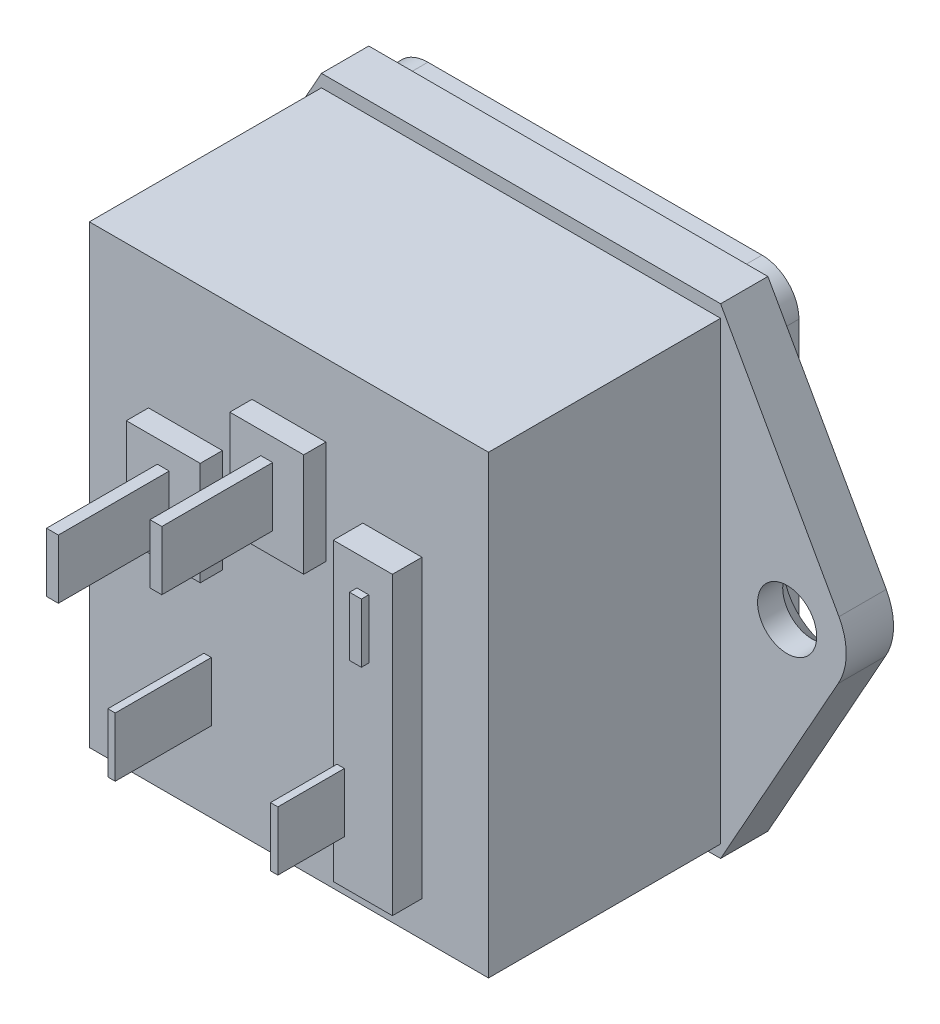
ISO-10303-21;
HEADER;
FILE_DESCRIPTION(('STEP AP214'),'2;1');
FILE_NAME('part.step','',(''),(''),'','','');
FILE_SCHEMA(('AUTOMOTIVE_DESIGN { 1 0 10303 214 1 1 1 1 }'));
ENDSEC;
DATA;
#1=APPLICATION_CONTEXT('core data for automotive mechanical design processes');
#2=APPLICATION_PROTOCOL_DEFINITION('international standard','automotive_design',2000,#1);
#3=PRODUCT_CONTEXT('',#1,'mechanical');
#4=PRODUCT('Part','Part','',(#3));
#5=PRODUCT_RELATED_PRODUCT_CATEGORY('part','',(#4));
#6=PRODUCT_DEFINITION_FORMATION('','',#4);
#7=PRODUCT_DEFINITION_CONTEXT('part definition',#1,'design');
#8=PRODUCT_DEFINITION('design','',#6,#7);
#9=PRODUCT_DEFINITION_SHAPE('','',#8);
#10=(LENGTH_UNIT() NAMED_UNIT(*) SI_UNIT(.MILLI.,.METRE.));
#11=(NAMED_UNIT(*) PLANE_ANGLE_UNIT() SI_UNIT($,.RADIAN.));
#12=(NAMED_UNIT(*) SI_UNIT($,.STERADIAN.) SOLID_ANGLE_UNIT());
#13=UNCERTAINTY_MEASURE_WITH_UNIT(LENGTH_MEASURE(1.E-05),#10,'distance_accuracy_value','');
#14=(GEOMETRIC_REPRESENTATION_CONTEXT(3) GLOBAL_UNCERTAINTY_ASSIGNED_CONTEXT((#13)) GLOBAL_UNIT_ASSIGNED_CONTEXT((#10,
#11,#12)) REPRESENTATION_CONTEXT('',''));
#15=CARTESIAN_POINT('',(0.,0.,0.));
#16=DIRECTION('',(0.,0.,1.));
#17=DIRECTION('',(1.,0.,0.));
#18=AXIS2_PLACEMENT_3D('',#15,#16,#17);
#19=CARTESIAN_POINT('',(-5.75,-6.,22.2));
#20=DIRECTION('',(1.,0.,0.));
#21=DIRECTION('',(0.,0.,-1.));
#22=AXIS2_PLACEMENT_3D('',#19,#20,#21);
#23=PLANE('',#22);
#24=DIRECTION('',(0.,-1.,0.));
#25=VECTOR('',#24,1.);
#26=CARTESIAN_POINT('',(-5.75,-6.,15.7));
#27=LINE('',#26,#25);
#28=CARTESIAN_POINT('',(-5.75,-6.,15.7));
#29=VERTEX_POINT('',#28);
#30=CARTESIAN_POINT('',(-5.75,-10.,15.7));
#31=VERTEX_POINT('',#30);
#32=EDGE_CURVE('E152',#29,#31,#27,.T.);
#33=ORIENTED_EDGE('',*,*,#32,.T.);
#34=DIRECTION('',(0.,0.,-1.));
#35=VECTOR('',#34,1.);
#36=CARTESIAN_POINT('',(-5.75,-10.,22.2));
#37=LINE('',#36,#35);
#38=CARTESIAN_POINT('',(-5.75,-10.,22.2));
#39=VERTEX_POINT('',#38);
#40=EDGE_CURVE('E13',#39,#31,#37,.T.);
#41=ORIENTED_EDGE('',*,*,#40,.F.);
#42=DIRECTION('',(0.,-1.,0.));
#43=VECTOR('',#42,1.);
#44=CARTESIAN_POINT('',(-5.75,-6.,22.2));
#45=LINE('',#44,#43);
#46=CARTESIAN_POINT('',(-5.75,-6.,22.2));
#47=VERTEX_POINT('',#46);
#48=EDGE_CURVE('E140',#47,#39,#45,.T.);
#49=ORIENTED_EDGE('',*,*,#48,.F.);
#50=DIRECTION('',(0.,0.,-1.));
#51=VECTOR('',#50,1.);
#52=CARTESIAN_POINT('',(-5.75,-6.,22.2));
#53=LINE('',#52,#51);
#54=EDGE_CURVE('E148',#47,#29,#53,.T.);
#55=ORIENTED_EDGE('',*,*,#54,.T.);
#56=EDGE_LOOP('',(#33,#41,#49,#55));
#57=FACE_BOUND('',#56,.T.);
#58=ADVANCED_FACE('F89',(#57),#23,.F.);
#59=CARTESIAN_POINT('',(-5.75,-10.,22.2));
#60=DIRECTION('',(0.,1.,0.));
#61=DIRECTION('',(0.,0.,1.));
#62=AXIS2_PLACEMENT_3D('',#59,#60,#61);
#63=PLANE('',#62);
#64=DIRECTION('',(1.,0.,0.));
#65=VECTOR('',#64,1.);
#66=CARTESIAN_POINT('',(-5.75,-10.,15.7));
#67=LINE('',#66,#65);
#68=CARTESIAN_POINT('',(-5.25,-10.,15.7));
#69=VERTEX_POINT('',#68);
#70=EDGE_CURVE('E144',#31,#69,#67,.T.);
#71=ORIENTED_EDGE('',*,*,#70,.T.);
#72=DIRECTION('',(0.,0.,-1.));
#73=VECTOR('',#72,1.);
#74=CARTESIAN_POINT('',(-5.25,-10.,22.2));
#75=LINE('',#74,#73);
#76=CARTESIAN_POINT('',(-5.25,-10.,22.2));
#77=VERTEX_POINT('',#76);
#78=EDGE_CURVE('E97',#77,#69,#75,.T.);
#79=ORIENTED_EDGE('',*,*,#78,.F.);
#80=DIRECTION('',(1.,0.,0.));
#81=VECTOR('',#80,1.);
#82=CARTESIAN_POINT('',(-5.75,-10.,22.2));
#83=LINE('',#82,#81);
#84=EDGE_CURVE('E135',#39,#77,#83,.T.);
#85=ORIENTED_EDGE('',*,*,#84,.F.);
#86=ORIENTED_EDGE('',*,*,#40,.T.);
#87=EDGE_LOOP('',(#71,#79,#85,#86));
#88=FACE_BOUND('',#87,.T.);
#89=ADVANCED_FACE('F143',(#88),#63,.F.);
#90=CARTESIAN_POINT('',(-5.25,-6.,22.2));
#91=DIRECTION('',(-1.,0.,0.));
#92=DIRECTION('',(0.,-1.,0.));
#93=AXIS2_PLACEMENT_3D('',#90,#91,#92);
#94=PLANE('',#93);
#95=DIRECTION('',(0.,1.,0.));
#96=VECTOR('',#95,1.);
#97=CARTESIAN_POINT('',(-5.25,-6.,15.7));
#98=LINE('',#97,#96);
#99=CARTESIAN_POINT('',(-5.25,-6.,15.7));
#100=VERTEX_POINT('',#99);
#101=EDGE_CURVE('E122',#69,#100,#98,.T.);
#102=ORIENTED_EDGE('',*,*,#101,.T.);
#103=DIRECTION('',(0.,0.,-1.));
#104=VECTOR('',#103,1.);
#105=CARTESIAN_POINT('',(-5.25,-6.,22.2));
#106=LINE('',#105,#104);
#107=CARTESIAN_POINT('',(-5.25,-6.,22.2));
#108=VERTEX_POINT('',#107);
#109=EDGE_CURVE('E145',#108,#100,#106,.T.);
#110=ORIENTED_EDGE('',*,*,#109,.F.);
#111=DIRECTION('',(0.,1.,0.));
#112=VECTOR('',#111,1.);
#113=CARTESIAN_POINT('',(-5.25,-6.,22.2));
#114=LINE('',#113,#112);
#115=EDGE_CURVE('E138',#77,#108,#114,.T.);
#116=ORIENTED_EDGE('',*,*,#115,.F.);
#117=ORIENTED_EDGE('',*,*,#78,.T.);
#118=EDGE_LOOP('',(#102,#110,#116,#117));
#119=FACE_BOUND('',#118,.T.);
#120=ADVANCED_FACE('F146',(#119),#94,.F.);
#121=CARTESIAN_POINT('',(-5.75,-6.,22.2));
#122=DIRECTION('',(0.,-1.,0.));
#123=DIRECTION('',(0.,0.,-1.));
#124=AXIS2_PLACEMENT_3D('',#121,#122,#123);
#125=PLANE('',#124);
#126=DIRECTION('',(-1.,0.,0.));
#127=VECTOR('',#126,1.);
#128=CARTESIAN_POINT('',(-5.75,-6.,15.7));
#129=LINE('',#128,#127);
#130=EDGE_CURVE('E128',#100,#29,#129,.T.);
#131=ORIENTED_EDGE('',*,*,#130,.T.);
#132=ORIENTED_EDGE('',*,*,#54,.F.);
#133=DIRECTION('',(-1.,0.,0.));
#134=VECTOR('',#133,1.);
#135=CARTESIAN_POINT('',(-5.75,-6.,22.2));
#136=LINE('',#135,#134);
#137=EDGE_CURVE('E105',#108,#47,#136,.T.);
#138=ORIENTED_EDGE('',*,*,#137,.F.);
#139=ORIENTED_EDGE('',*,*,#109,.T.);
#140=EDGE_LOOP('',(#131,#132,#138,#139));
#141=FACE_BOUND('',#140,.T.);
#142=ADVANCED_FACE('F159',(#141),#125,.F.);
#143=CARTESIAN_POINT('',(-5.75,-10.,22.2));
#144=DIRECTION('',(0.,0.,1.));
#145=DIRECTION('',(1.,0.,0.));
#146=AXIS2_PLACEMENT_3D('',#143,#144,#145);
#147=PLANE('',#146);
#148=ORIENTED_EDGE('',*,*,#48,.T.);
#149=ORIENTED_EDGE('',*,*,#84,.T.);
#150=ORIENTED_EDGE('',*,*,#115,.T.);
#151=ORIENTED_EDGE('',*,*,#137,.T.);
#152=EDGE_LOOP('',(#148,#149,#150,#151));
#153=FACE_BOUND('',#152,.T.);
#154=ADVANCED_FACE('F136',(#153),#147,.T.);
#155=CARTESIAN_POINT('',(-5.75,-10.,15.7));
#156=DIRECTION('',(0.,0.,1.));
#157=DIRECTION('',(1.,0.,0.));
#158=AXIS2_PLACEMENT_3D('',#155,#156,#157);
#159=PLANE('',#158);
#160=ORIENTED_EDGE('',*,*,#32,.F.);
#161=ORIENTED_EDGE('',*,*,#130,.F.);
#162=ORIENTED_EDGE('',*,*,#101,.F.);
#163=ORIENTED_EDGE('',*,*,#70,.F.);
#164=EDGE_LOOP('',(#160,#161,#162,#163));
#165=FACE_BOUND('',#164,.T.);
#166=ADVANCED_FACE('F162',(#165),#159,.F.);
#167=CLOSED_SHELL('',(#58,#89,#120,#142,#154,#166));
#168=MANIFOLD_SOLID_BREP('B2',#167);
#169=CARTESIAN_POINT('',(-13.5,-15.4,15.7));
#170=DIRECTION('',(0.,0.,1.));
#171=DIRECTION('',(1.,0.,0.));
#172=AXIS2_PLACEMENT_3D('',#169,#170,#171);
#173=PLANE('',#172);
#174=DIRECTION('',(1.,0.,0.));
#175=VECTOR('',#174,1.);
#176=CARTESIAN_POINT('',(5.,-13.,15.7));
#177=LINE('',#176,#175);
#178=CARTESIAN_POINT('',(5.,-13.,15.7));
#179=VERTEX_POINT('',#178);
#180=CARTESIAN_POINT('',(9.,-13.,15.7));
#181=VERTEX_POINT('',#180);
#182=EDGE_CURVE('E926',#179,#181,#177,.T.);
#183=ORIENTED_EDGE('',*,*,#182,.F.);
#184=DIRECTION('',(0.,-1.,0.));
#185=VECTOR('',#184,1.);
#186=CARTESIAN_POINT('',(5.,7.,15.7));
#187=LINE('',#186,#185);
#188=CARTESIAN_POINT('',(5.,7.,15.7));
#189=VERTEX_POINT('',#188);
#190=EDGE_CURVE('E912',#189,#179,#187,.T.);
#191=ORIENTED_EDGE('',*,*,#190,.F.);
#192=DIRECTION('',(-1.,0.,0.));
#193=VECTOR('',#192,1.);
#194=CARTESIAN_POINT('',(5.,7.,15.7));
#195=LINE('',#194,#193);
#196=CARTESIAN_POINT('',(9.,7.,15.7));
#197=VERTEX_POINT('',#196);
#198=EDGE_CURVE('E917',#197,#189,#195,.T.);
#199=ORIENTED_EDGE('',*,*,#198,.F.);
#200=DIRECTION('',(0.,1.,0.));
#201=VECTOR('',#200,1.);
#202=CARTESIAN_POINT('',(9.,7.,15.7));
#203=LINE('',#202,#201);
#204=EDGE_CURVE('E928',#181,#197,#203,.T.);
#205=ORIENTED_EDGE('',*,*,#204,.F.);
#206=EDGE_LOOP('',(#183,#191,#199,#205));
#207=FACE_BOUND('',#206,.T.);
#208=DIRECTION('',(0.,-1.,0.));
#209=VECTOR('',#208,1.);
#210=CARTESIAN_POINT('',(-13.5,15.4,15.7));
#211=LINE('',#210,#209);
#212=CARTESIAN_POINT('',(-13.5,15.4,15.7));
#213=VERTEX_POINT('',#212);
#214=CARTESIAN_POINT('',(-13.5,-15.4,15.7));
#215=VERTEX_POINT('',#214);
#216=EDGE_CURVE('E1129',#213,#215,#211,.T.);
#217=ORIENTED_EDGE('',*,*,#216,.T.);
#218=DIRECTION('',(1.,0.,0.));
#219=VECTOR('',#218,1.);
#220=CARTESIAN_POINT('',(-13.5,-15.4,15.7));
#221=LINE('',#220,#219);
#222=CARTESIAN_POINT('',(13.5,-15.4,15.7));
#223=VERTEX_POINT('',#222);
#224=EDGE_CURVE('E1132',#215,#223,#221,.T.);
#225=ORIENTED_EDGE('',*,*,#224,.T.);
#226=DIRECTION('',(0.,1.,0.));
#227=VECTOR('',#226,1.);
#228=CARTESIAN_POINT('',(13.5,15.4,15.7));
#229=LINE('',#228,#227);
#230=CARTESIAN_POINT('',(13.5,15.4,15.7));
#231=VERTEX_POINT('',#230);
#232=EDGE_CURVE('E1135',#223,#231,#229,.T.);
#233=ORIENTED_EDGE('',*,*,#232,.T.);
#234=DIRECTION('',(-1.,0.,0.));
#235=VECTOR('',#234,1.);
#236=CARTESIAN_POINT('',(-13.5,15.4,15.7));
#237=LINE('',#236,#235);
#238=EDGE_CURVE('E1137',#231,#213,#237,.T.);
#239=ORIENTED_EDGE('',*,*,#238,.T.);
#240=EDGE_LOOP('',(#217,#225,#233,#239));
#241=FACE_BOUND('',#240,.T.);
#242=DIRECTION('',(0.,-1.,0.));
#243=VECTOR('',#242,1.);
#244=CARTESIAN_POINT('',(-2.5,10.5,15.7));
#245=LINE('',#244,#243);
#246=CARTESIAN_POINT('',(-2.5,10.5,15.7));
#247=VERTEX_POINT('',#246);
#248=CARTESIAN_POINT('',(-2.5,3.5,15.7));
#249=VERTEX_POINT('',#248);
#250=EDGE_CURVE('E1161',#247,#249,#245,.T.);
#251=ORIENTED_EDGE('',*,*,#250,.F.);
#252=DIRECTION('',(-1.,0.,0.));
#253=VECTOR('',#252,1.);
#254=CARTESIAN_POINT('',(-2.5,10.5,15.7));
#255=LINE('',#254,#253);
#256=CARTESIAN_POINT('',(2.5,10.5,15.7));
#257=VERTEX_POINT('',#256);
#258=EDGE_CURVE('E1166',#257,#247,#255,.T.);
#259=ORIENTED_EDGE('',*,*,#258,.F.);
#260=DIRECTION('',(0.,1.,0.));
#261=VECTOR('',#260,1.);
#262=CARTESIAN_POINT('',(2.5,10.5,15.7));
#263=LINE('',#262,#261);
#264=CARTESIAN_POINT('',(2.5,3.5,15.7));
#265=VERTEX_POINT('',#264);
#266=EDGE_CURVE('E1178',#265,#257,#263,.T.);
#267=ORIENTED_EDGE('',*,*,#266,.F.);
#268=DIRECTION('',(1.,0.,0.));
#269=VECTOR('',#268,1.);
#270=CARTESIAN_POINT('',(-2.5,3.5,15.7));
#271=LINE('',#270,#269);
#272=EDGE_CURVE('E1175',#249,#265,#271,.T.);
#273=ORIENTED_EDGE('',*,*,#272,.F.);
#274=EDGE_LOOP('',(#251,#259,#267,#273));
#275=FACE_BOUND('',#274,.T.);
#276=DIRECTION('',(1.,0.,0.));
#277=VECTOR('',#276,1.);
#278=CARTESIAN_POINT('',(-9.5,-0.5,15.7));
#279=LINE('',#278,#277);
#280=CARTESIAN_POINT('',(-9.5,-0.5,15.7));
#281=VERTEX_POINT('',#280);
#282=CARTESIAN_POINT('',(-4.5,-0.5,15.7));
#283=VERTEX_POINT('',#282);
#284=EDGE_CURVE('E809',#281,#283,#279,.T.);
#285=ORIENTED_EDGE('',*,*,#284,.F.);
#286=DIRECTION('',(0.,-1.,0.));
#287=VECTOR('',#286,1.);
#288=CARTESIAN_POINT('',(-9.5,6.5,15.7));
#289=LINE('',#288,#287);
#290=CARTESIAN_POINT('',(-9.5,6.5,15.7));
#291=VERTEX_POINT('',#290);
#292=EDGE_CURVE('E785',#291,#281,#289,.T.);
#293=ORIENTED_EDGE('',*,*,#292,.F.);
#294=DIRECTION('',(-1.,0.,0.));
#295=VECTOR('',#294,1.);
#296=CARTESIAN_POINT('',(-9.5,6.5,15.7));
#297=LINE('',#296,#295);
#298=CARTESIAN_POINT('',(-4.5,6.5,15.7));
#299=VERTEX_POINT('',#298);
#300=EDGE_CURVE('E800',#299,#291,#297,.T.);
#301=ORIENTED_EDGE('',*,*,#300,.F.);
#302=DIRECTION('',(0.,1.,0.));
#303=VECTOR('',#302,1.);
#304=CARTESIAN_POINT('',(-4.5,6.5,15.7));
#305=LINE('',#304,#303);
#306=EDGE_CURVE('E811',#283,#299,#305,.T.);
#307=ORIENTED_EDGE('',*,*,#306,.F.);
#308=EDGE_LOOP('',(#285,#293,#301,#307));
#309=FACE_BOUND('',#308,.T.);
#310=ADVANCED_FACE('F223',(#207,#241,#275,#309),#173,.T.);
#311=CARTESIAN_POINT('',(-0.4,9.,24.7));
#312=DIRECTION('',(1.,0.,0.));
#313=DIRECTION('',(0.,1.,0.));
#314=AXIS2_PLACEMENT_3D('',#311,#312,#313);
#315=PLANE('',#314);
#316=DIRECTION('',(0.,0.,-1.));
#317=VECTOR('',#316,1.);
#318=CARTESIAN_POINT('',(-0.4,9.,24.7));
#319=LINE('',#318,#317);
#320=CARTESIAN_POINT('',(-0.4,9.,24.7));
#321=VERTEX_POINT('',#320);
#322=CARTESIAN_POINT('',(-0.4,9.,17.2));
#323=VERTEX_POINT('',#322);
#324=EDGE_CURVE('E1212',#321,#323,#319,.T.);
#325=ORIENTED_EDGE('',*,*,#324,.T.);
#326=DIRECTION('',(0.,-1.,0.));
#327=VECTOR('',#326,1.);
#328=CARTESIAN_POINT('',(-0.4,9.,17.2));
#329=LINE('',#328,#327);
#330=CARTESIAN_POINT('',(-0.399999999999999,5.,17.2));
#331=VERTEX_POINT('',#330);
#332=EDGE_CURVE('E1200',#323,#331,#329,.T.);
#333=ORIENTED_EDGE('',*,*,#332,.T.);
#334=DIRECTION('',(0.,0.,-1.));
#335=VECTOR('',#334,1.);
#336=CARTESIAN_POINT('',(-0.399999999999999,5.,24.7));
#337=LINE('',#336,#335);
#338=CARTESIAN_POINT('',(-0.399999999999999,5.,24.7));
#339=VERTEX_POINT('',#338);
#340=EDGE_CURVE('E1221',#339,#331,#337,.T.);
#341=ORIENTED_EDGE('',*,*,#340,.F.);
#342=DIRECTION('',(0.,-1.,0.));
#343=VECTOR('',#342,1.);
#344=CARTESIAN_POINT('',(-0.4,9.,24.7));
#345=LINE('',#344,#343);
#346=EDGE_CURVE('E1203',#321,#339,#345,.T.);
#347=ORIENTED_EDGE('',*,*,#346,.F.);
#348=EDGE_LOOP('',(#325,#333,#341,#347));
#349=FACE_BOUND('',#348,.T.);
#350=ADVANCED_FACE('F1291',(#349),#315,.F.);
#351=CARTESIAN_POINT('',(-0.399999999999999,5.,24.7));
#352=DIRECTION('',(0.,1.,0.));
#353=DIRECTION('',(0.,0.,1.));
#354=AXIS2_PLACEMENT_3D('',#351,#352,#353);
#355=PLANE('',#354);
#356=ORIENTED_EDGE('',*,*,#340,.T.);
#357=DIRECTION('',(1.,0.,0.));
#358=VECTOR('',#357,1.);
#359=CARTESIAN_POINT('',(-0.399999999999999,5.,17.2));
#360=LINE('',#359,#358);
#361=CARTESIAN_POINT('',(0.400000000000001,5.,17.2));
#362=VERTEX_POINT('',#361);
#363=EDGE_CURVE('E1197',#331,#362,#360,.T.);
#364=ORIENTED_EDGE('',*,*,#363,.T.);
#365=DIRECTION('',(0.,0.,-1.));
#366=VECTOR('',#365,1.);
#367=CARTESIAN_POINT('',(0.400000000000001,5.,24.7));
#368=LINE('',#367,#366);
#369=CARTESIAN_POINT('',(0.400000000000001,5.,24.7));
#370=VERTEX_POINT('',#369);
#371=EDGE_CURVE('E1218',#370,#362,#368,.T.);
#372=ORIENTED_EDGE('',*,*,#371,.F.);
#373=DIRECTION('',(1.,0.,0.));
#374=VECTOR('',#373,1.);
#375=CARTESIAN_POINT('',(-0.399999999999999,5.,24.7));
#376=LINE('',#375,#374);
#377=EDGE_CURVE('E1206',#339,#370,#376,.T.);
#378=ORIENTED_EDGE('',*,*,#377,.F.);
#379=EDGE_LOOP('',(#356,#364,#372,#378));
#380=FACE_BOUND('',#379,.T.);
#381=ADVANCED_FACE('F1558',(#380),#355,.F.);
#382=CARTESIAN_POINT('',(0.4,9.,24.7));
#383=DIRECTION('',(-1.,0.,0.));
#384=DIRECTION('',(0.,-1.,0.));
#385=AXIS2_PLACEMENT_3D('',#382,#383,#384);
#386=PLANE('',#385);
#387=ORIENTED_EDGE('',*,*,#371,.T.);
#388=DIRECTION('',(0.,1.,0.));
#389=VECTOR('',#388,1.);
#390=CARTESIAN_POINT('',(0.4,9.,17.2));
#391=LINE('',#390,#389);
#392=CARTESIAN_POINT('',(0.4,9.,17.2));
#393=VERTEX_POINT('',#392);
#394=EDGE_CURVE('E1194',#362,#393,#391,.T.);
#395=ORIENTED_EDGE('',*,*,#394,.T.);
#396=DIRECTION('',(0.,0.,-1.));
#397=VECTOR('',#396,1.);
#398=CARTESIAN_POINT('',(0.4,9.,24.7));
#399=LINE('',#398,#397);
#400=CARTESIAN_POINT('',(0.4,9.,24.7));
#401=VERTEX_POINT('',#400);
#402=EDGE_CURVE('E1215',#401,#393,#399,.T.);
#403=ORIENTED_EDGE('',*,*,#402,.F.);
#404=DIRECTION('',(0.,1.,0.));
#405=VECTOR('',#404,1.);
#406=CARTESIAN_POINT('',(0.4,9.,24.7));
#407=LINE('',#406,#405);
#408=EDGE_CURVE('E1208',#370,#401,#407,.T.);
#409=ORIENTED_EDGE('',*,*,#408,.F.);
#410=EDGE_LOOP('',(#387,#395,#403,#409));
#411=FACE_BOUND('',#410,.T.);
#412=ADVANCED_FACE('F1554',(#411),#386,.F.);
#413=CARTESIAN_POINT('',(-0.4,9.,24.7));
#414=DIRECTION('',(0.,-1.,0.));
#415=DIRECTION('',(0.,0.,-1.));
#416=AXIS2_PLACEMENT_3D('',#413,#414,#415);
#417=PLANE('',#416);
#418=ORIENTED_EDGE('',*,*,#402,.T.);
#419=DIRECTION('',(-1.,0.,0.));
#420=VECTOR('',#419,1.);
#421=CARTESIAN_POINT('',(-0.4,9.,17.2));
#422=LINE('',#421,#420);
#423=EDGE_CURVE('E1224',#393,#323,#422,.T.);
#424=ORIENTED_EDGE('',*,*,#423,.T.);
#425=ORIENTED_EDGE('',*,*,#324,.F.);
#426=DIRECTION('',(-1.,0.,0.));
#427=VECTOR('',#426,1.);
#428=CARTESIAN_POINT('',(-0.4,9.,24.7));
#429=LINE('',#428,#427);
#430=EDGE_CURVE('E1210',#401,#321,#429,.T.);
#431=ORIENTED_EDGE('',*,*,#430,.F.);
#432=EDGE_LOOP('',(#418,#424,#425,#431));
#433=FACE_BOUND('',#432,.T.);
#434=ADVANCED_FACE('F1550',(#433),#417,.F.);
#435=CARTESIAN_POINT('',(-0.399999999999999,5.,24.7));
#436=DIRECTION('',(0.,0.,1.));
#437=DIRECTION('',(1.,0.,0.));
#438=AXIS2_PLACEMENT_3D('',#435,#436,#437);
#439=PLANE('',#438);
#440=ORIENTED_EDGE('',*,*,#346,.T.);
#441=ORIENTED_EDGE('',*,*,#377,.T.);
#442=ORIENTED_EDGE('',*,*,#408,.T.);
#443=ORIENTED_EDGE('',*,*,#430,.T.);
#444=EDGE_LOOP('',(#440,#441,#442,#443));
#445=FACE_BOUND('',#444,.T.);
#446=ADVANCED_FACE('F1532',(#445),#439,.T.);
#447=CARTESIAN_POINT('',(-2.5,3.5,17.2));
#448=DIRECTION('',(0.,0.,1.));
#449=DIRECTION('',(1.,0.,0.));
#450=AXIS2_PLACEMENT_3D('',#447,#448,#449);
#451=PLANE('',#450);
#452=DIRECTION('',(0.,-1.,0.));
#453=VECTOR('',#452,1.);
#454=CARTESIAN_POINT('',(-2.5,10.5,17.2));
#455=LINE('',#454,#453);
#456=CARTESIAN_POINT('',(-2.5,10.5,17.2));
#457=VERTEX_POINT('',#456);
#458=CARTESIAN_POINT('',(-2.5,3.5,17.2));
#459=VERTEX_POINT('',#458);
#460=EDGE_CURVE('E1162',#457,#459,#455,.T.);
#461=ORIENTED_EDGE('',*,*,#460,.T.);
#462=DIRECTION('',(1.,0.,0.));
#463=VECTOR('',#462,1.);
#464=CARTESIAN_POINT('',(-2.5,3.5,17.2));
#465=LINE('',#464,#463);
#466=CARTESIAN_POINT('',(2.5,3.5,17.2));
#467=VERTEX_POINT('',#466);
#468=EDGE_CURVE('E1165',#459,#467,#465,.T.);
#469=ORIENTED_EDGE('',*,*,#468,.T.);
#470=DIRECTION('',(0.,1.,0.));
#471=VECTOR('',#470,1.);
#472=CARTESIAN_POINT('',(2.5,10.5,17.2));
#473=LINE('',#472,#471);
#474=CARTESIAN_POINT('',(2.5,10.5,17.2));
#475=VERTEX_POINT('',#474);
#476=EDGE_CURVE('E1168',#467,#475,#473,.T.);
#477=ORIENTED_EDGE('',*,*,#476,.T.);
#478=DIRECTION('',(-1.,0.,0.));
#479=VECTOR('',#478,1.);
#480=CARTESIAN_POINT('',(-2.5,10.5,17.2));
#481=LINE('',#480,#479);
#482=EDGE_CURVE('E1170',#475,#457,#481,.T.);
#483=ORIENTED_EDGE('',*,*,#482,.T.);
#484=EDGE_LOOP('',(#461,#469,#477,#483));
#485=FACE_BOUND('',#484,.T.);
#486=ORIENTED_EDGE('',*,*,#332,.F.);
#487=ORIENTED_EDGE('',*,*,#423,.F.);
#488=ORIENTED_EDGE('',*,*,#394,.F.);
#489=ORIENTED_EDGE('',*,*,#363,.F.);
#490=EDGE_LOOP('',(#486,#487,#488,#489));
#491=FACE_BOUND('',#490,.T.);
#492=ADVANCED_FACE('F1528',(#485,#491),#451,.T.);
#493=CARTESIAN_POINT('',(-2.5,10.5,17.2));
#494=DIRECTION('',(1.,0.,0.));
#495=DIRECTION('',(0.,1.,0.));
#496=AXIS2_PLACEMENT_3D('',#493,#494,#495);
#497=PLANE('',#496);
#498=ORIENTED_EDGE('',*,*,#250,.T.);
#499=DIRECTION('',(0.,0.,-1.));
#500=VECTOR('',#499,1.);
#501=CARTESIAN_POINT('',(-2.5,3.5,17.2));
#502=LINE('',#501,#500);
#503=EDGE_CURVE('E1191',#459,#249,#502,.T.);
#504=ORIENTED_EDGE('',*,*,#503,.F.);
#505=ORIENTED_EDGE('',*,*,#460,.F.);
#506=DIRECTION('',(0.,0.,-1.));
#507=VECTOR('',#506,1.);
#508=CARTESIAN_POINT('',(-2.5,10.5,17.2));
#509=LINE('',#508,#507);
#510=EDGE_CURVE('E1172',#457,#247,#509,.T.);
#511=ORIENTED_EDGE('',*,*,#510,.T.);
#512=EDGE_LOOP('',(#498,#504,#505,#511));
#513=FACE_BOUND('',#512,.T.);
#514=ADVANCED_FACE('F1531',(#513),#497,.F.);
#515=CARTESIAN_POINT('',(-2.5,3.5,17.2));
#516=DIRECTION('',(0.,1.,0.));
#517=DIRECTION('',(0.,0.,1.));
#518=AXIS2_PLACEMENT_3D('',#515,#516,#517);
#519=PLANE('',#518);
#520=ORIENTED_EDGE('',*,*,#272,.T.);
#521=DIRECTION('',(0.,0.,-1.));
#522=VECTOR('',#521,1.);
#523=CARTESIAN_POINT('',(2.5,3.5,17.2));
#524=LINE('',#523,#522);
#525=EDGE_CURVE('E1188',#467,#265,#524,.T.);
#526=ORIENTED_EDGE('',*,*,#525,.F.);
#527=ORIENTED_EDGE('',*,*,#468,.F.);
#528=ORIENTED_EDGE('',*,*,#503,.T.);
#529=EDGE_LOOP('',(#520,#526,#527,#528));
#530=FACE_BOUND('',#529,.T.);
#531=ADVANCED_FACE('F1540',(#530),#519,.F.);
#532=CARTESIAN_POINT('',(2.5,10.5,17.2));
#533=DIRECTION('',(-1.,0.,0.));
#534=DIRECTION('',(0.,-1.,0.));
#535=AXIS2_PLACEMENT_3D('',#532,#533,#534);
#536=PLANE('',#535);
#537=ORIENTED_EDGE('',*,*,#266,.T.);
#538=DIRECTION('',(0.,0.,-1.));
#539=VECTOR('',#538,1.);
#540=CARTESIAN_POINT('',(2.5,10.5,17.2));
#541=LINE('',#540,#539);
#542=EDGE_CURVE('E1185',#475,#257,#541,.T.);
#543=ORIENTED_EDGE('',*,*,#542,.F.);
#544=ORIENTED_EDGE('',*,*,#476,.F.);
#545=ORIENTED_EDGE('',*,*,#525,.T.);
#546=EDGE_LOOP('',(#537,#543,#544,#545));
#547=FACE_BOUND('',#546,.T.);
#548=ADVANCED_FACE('F1536',(#547),#536,.F.);
#549=CARTESIAN_POINT('',(-2.5,10.5,17.2));
#550=DIRECTION('',(0.,-1.,0.));
#551=DIRECTION('',(0.,0.,-1.));
#552=AXIS2_PLACEMENT_3D('',#549,#550,#551);
#553=PLANE('',#552);
#554=ORIENTED_EDGE('',*,*,#258,.T.);
#555=ORIENTED_EDGE('',*,*,#510,.F.);
#556=ORIENTED_EDGE('',*,*,#482,.F.);
#557=ORIENTED_EDGE('',*,*,#542,.T.);
#558=EDGE_LOOP('',(#554,#555,#556,#557));
#559=FACE_BOUND('',#558,.T.);
#560=ADVANCED_FACE('F1396',(#559),#553,.F.);
#561=CARTESIAN_POINT('',(5.,-13.,17.7));
#562=DIRECTION('',(0.,0.,1.));
#563=DIRECTION('',(1.,0.,0.));
#564=AXIS2_PLACEMENT_3D('',#561,#562,#563);
#565=PLANE('',#564);
#566=DIRECTION('',(1.,0.,0.));
#567=VECTOR('',#566,1.);
#568=CARTESIAN_POINT('',(6.6,1.,17.7));
#569=LINE('',#568,#567);
#570=CARTESIAN_POINT('',(6.6,1.,17.7));
#571=VERTEX_POINT('',#570);
#572=CARTESIAN_POINT('',(7.4,1.,17.7));
#573=VERTEX_POINT('',#572);
#574=EDGE_CURVE('E897',#571,#573,#569,.T.);
#575=ORIENTED_EDGE('',*,*,#574,.F.);
#576=DIRECTION('',(0.,-1.,0.));
#577=VECTOR('',#576,1.);
#578=CARTESIAN_POINT('',(6.6,5.,17.7));
#579=LINE('',#578,#577);
#580=CARTESIAN_POINT('',(6.6,5.,17.7));
#581=VERTEX_POINT('',#580);
#582=EDGE_CURVE('E883',#581,#571,#579,.T.);
#583=ORIENTED_EDGE('',*,*,#582,.F.);
#584=DIRECTION('',(-1.,0.,0.));
#585=VECTOR('',#584,1.);
#586=CARTESIAN_POINT('',(6.6,5.,17.7));
#587=LINE('',#586,#585);
#588=CARTESIAN_POINT('',(7.4,5.,17.7));
#589=VERTEX_POINT('',#588);
#590=EDGE_CURVE('E888',#589,#581,#587,.T.);
#591=ORIENTED_EDGE('',*,*,#590,.F.);
#592=DIRECTION('',(0.,1.,0.));
#593=VECTOR('',#592,1.);
#594=CARTESIAN_POINT('',(7.4,5.,17.7));
#595=LINE('',#594,#593);
#596=EDGE_CURVE('E899',#573,#589,#595,.T.);
#597=ORIENTED_EDGE('',*,*,#596,.F.);
#598=EDGE_LOOP('',(#575,#583,#591,#597));
#599=FACE_BOUND('',#598,.T.);
#600=DIRECTION('',(0.,-1.,0.));
#601=VECTOR('',#600,1.);
#602=CARTESIAN_POINT('',(5.,7.,17.7));
#603=LINE('',#602,#601);
#604=CARTESIAN_POINT('',(5.,7.,17.7));
#605=VERTEX_POINT('',#604);
#606=CARTESIAN_POINT('',(5.,-13.,17.7));
#607=VERTEX_POINT('',#606);
#608=EDGE_CURVE('E913',#605,#607,#603,.T.);
#609=ORIENTED_EDGE('',*,*,#608,.T.);
#610=DIRECTION('',(1.,0.,0.));
#611=VECTOR('',#610,1.);
#612=CARTESIAN_POINT('',(5.,-13.,17.7));
#613=LINE('',#612,#611);
#614=CARTESIAN_POINT('',(9.,-13.,17.7));
#615=VERTEX_POINT('',#614);
#616=EDGE_CURVE('E916',#607,#615,#613,.T.);
#617=ORIENTED_EDGE('',*,*,#616,.T.);
#618=DIRECTION('',(0.,1.,0.));
#619=VECTOR('',#618,1.);
#620=CARTESIAN_POINT('',(9.,7.,17.7));
#621=LINE('',#620,#619);
#622=CARTESIAN_POINT('',(9.,7.,17.7));
#623=VERTEX_POINT('',#622);
#624=EDGE_CURVE('E919',#615,#623,#621,.T.);
#625=ORIENTED_EDGE('',*,*,#624,.T.);
#626=DIRECTION('',(-1.,0.,0.));
#627=VECTOR('',#626,1.);
#628=CARTESIAN_POINT('',(5.,7.,17.7));
#629=LINE('',#628,#627);
#630=EDGE_CURVE('E921',#623,#605,#629,.T.);
#631=ORIENTED_EDGE('',*,*,#630,.T.);
#632=EDGE_LOOP('',(#609,#617,#625,#631));
#633=FACE_BOUND('',#632,.T.);
#634=DIRECTION('',(1.,0.,0.));
#635=VECTOR('',#634,1.);
#636=CARTESIAN_POINT('',(5.25,-10.,17.7));
#637=LINE('',#636,#635);
#638=CARTESIAN_POINT('',(5.25,-10.,17.7));
#639=VERTEX_POINT('',#638);
#640=CARTESIAN_POINT('',(5.75,-10.,17.7));
#641=VERTEX_POINT('',#640);
#642=EDGE_CURVE('E868',#639,#641,#637,.T.);
#643=ORIENTED_EDGE('',*,*,#642,.F.);
#644=DIRECTION('',(0.,-1.,0.));
#645=VECTOR('',#644,1.);
#646=CARTESIAN_POINT('',(5.25,-6.,17.7));
#647=LINE('',#646,#645);
#648=CARTESIAN_POINT('',(5.25,-6.,17.7));
#649=VERTEX_POINT('',#648);
#650=EDGE_CURVE('E854',#649,#639,#647,.T.);
#651=ORIENTED_EDGE('',*,*,#650,.F.);
#652=DIRECTION('',(-1.,0.,0.));
#653=VECTOR('',#652,1.);
#654=CARTESIAN_POINT('',(5.25,-6.,17.7));
#655=LINE('',#654,#653);
#656=CARTESIAN_POINT('',(5.75,-6.,17.7));
#657=VERTEX_POINT('',#656);
#658=EDGE_CURVE('E859',#657,#649,#655,.T.);
#659=ORIENTED_EDGE('',*,*,#658,.F.);
#660=DIRECTION('',(0.,1.,0.));
#661=VECTOR('',#660,1.);
#662=CARTESIAN_POINT('',(5.75,-6.,17.7));
#663=LINE('',#662,#661);
#664=EDGE_CURVE('E870',#641,#657,#663,.T.);
#665=ORIENTED_EDGE('',*,*,#664,.F.);
#666=EDGE_LOOP('',(#643,#651,#659,#665));
#667=FACE_BOUND('',#666,.T.);
#668=ADVANCED_FACE('F1393',(#599,#633,#667),#565,.T.);
#669=CARTESIAN_POINT('',(18.,0.,-3.2));
#670=DIRECTION('',(0.,0.,-1.));
#671=DIRECTION('',(-1.,0.,0.));
#672=AXIS2_PLACEMENT_3D('',#669,#670,#671);
#673=PLANE('',#672);
#674=CARTESIAN_POINT('',(-18.00098,0.,-3.2));
#675=DIRECTION('',(0.,0.,-1.));
#676=DIRECTION('',(-1.,0.,0.));
#677=AXIS2_PLACEMENT_3D('',#674,#675,#676);
#678=CIRCLE('',#677,3.5);
#679=CARTESIAN_POINT('',(-21.50098,0.,-3.2));
#680=VERTEX_POINT('',#679);
#681=EDGE_CURVE('E231',#680,#680,#678,.F.);
#682=ORIENTED_EDGE('',*,*,#681,.T.);
#683=EDGE_LOOP('',(#682));
#684=FACE_BOUND('',#683,.T.);
#685=CARTESIAN_POINT('',(18.00098,0.,-3.2));
#686=DIRECTION('',(0.,0.,-1.));
#687=DIRECTION('',(-1.,0.,0.));
#688=AXIS2_PLACEMENT_3D('',#685,#686,#687);
#689=CIRCLE('',#688,3.5);
#690=CARTESIAN_POINT('',(14.50098,0.,-3.2));
#691=VERTEX_POINT('',#690);
#692=EDGE_CURVE('E1241',#691,#691,#689,.F.);
#693=ORIENTED_EDGE('',*,*,#692,.T.);
#694=EDGE_LOOP('',(#693));
#695=FACE_BOUND('',#694,.T.);
#696=CARTESIAN_POINT('',(18.,0.,-3.2));
#697=DIRECTION('',(0.,0.,-1.));
#698=DIRECTION('',(-1.,0.,0.));
#699=AXIS2_PLACEMENT_3D('',#696,#697,#698);
#700=CIRCLE('',#699,4.);
#701=CARTESIAN_POINT('',(21.5080950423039,1.92178801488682,-3.2));
#702=VERTEX_POINT('',#701);
#703=CARTESIAN_POINT('',(21.4466704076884,-2.02989238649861,-3.2));
#704=VERTEX_POINT('',#703);
#705=EDGE_CURVE('E1071',#702,#704,#700,.T.);
#706=ORIENTED_EDGE('',*,*,#705,.T.);
#707=DIRECTION('',(-0.487827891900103,-0.872939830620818,0.));
#708=VECTOR('',#707,1.);
#709=CARTESIAN_POINT('',(13.5,-16.25,-3.2));
#710=LINE('',#709,#708);
#711=CARTESIAN_POINT('',(13.5,-16.25,-3.2));
#712=VERTEX_POINT('',#711);
#713=EDGE_CURVE('E1074',#704,#712,#710,.T.);
#714=ORIENTED_EDGE('',*,*,#713,.T.);
#715=DIRECTION('',(-1.,0.,0.));
#716=VECTOR('',#715,1.);
#717=CARTESIAN_POINT('',(13.5,-16.25,-3.2));
#718=LINE('',#717,#716);
#719=CARTESIAN_POINT('',(-13.5,-16.25,-3.2));
#720=VERTEX_POINT('',#719);
#721=EDGE_CURVE('E1077',#712,#720,#718,.T.);
#722=ORIENTED_EDGE('',*,*,#721,.T.);
#723=DIRECTION('',(-0.487857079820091,0.872923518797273,0.));
#724=VECTOR('',#723,1.);
#725=CARTESIAN_POINT('',(-13.5,-16.25,-3.2));
#726=LINE('',#725,#724);
#727=CARTESIAN_POINT('',(-21.5214530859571,-1.89720008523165,-3.2));
#728=VERTEX_POINT('',#727);
#729=EDGE_CURVE('E1079',#720,#728,#726,.T.);
#730=ORIENTED_EDGE('',*,*,#729,.T.);
#731=CARTESIAN_POINT('',(-18.,0.,-3.2));
#732=DIRECTION('',(0.,0.,-1.));
#733=DIRECTION('',(-1.,0.,0.));
#734=AXIS2_PLACEMENT_3D('',#731,#732,#733);
#735=CIRCLE('',#734,4.);
#736=CARTESIAN_POINT('',(-21.5080950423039,1.92178801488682,-3.2));
#737=VERTEX_POINT('',#736);
#738=EDGE_CURVE('E1081',#728,#737,#735,.T.);
#739=ORIENTED_EDGE('',*,*,#738,.T.);
#740=DIRECTION('',(0.487874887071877,0.872913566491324,0.));
#741=VECTOR('',#740,1.);
#742=CARTESIAN_POINT('',(-13.5,16.25,-3.2));
#743=LINE('',#742,#741);
#744=CARTESIAN_POINT('',(-13.5,16.25,-3.2));
#745=VERTEX_POINT('',#744);
#746=EDGE_CURVE('E1083',#737,#745,#743,.T.);
#747=ORIENTED_EDGE('',*,*,#746,.T.);
#748=DIRECTION('',(1.,0.,0.));
#749=VECTOR('',#748,1.);
#750=CARTESIAN_POINT('',(-13.5,16.25,-3.2));
#751=LINE('',#750,#749);
#752=CARTESIAN_POINT('',(13.5,16.25,-3.2));
#753=VERTEX_POINT('',#752);
#754=EDGE_CURVE('E1085',#745,#753,#751,.T.);
#755=ORIENTED_EDGE('',*,*,#754,.T.);
#756=DIRECTION('',(0.487874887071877,-0.872913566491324,0.));
#757=VECTOR('',#756,1.);
#758=CARTESIAN_POINT('',(13.5,16.25,-3.2));
#759=LINE('',#758,#757);
#760=EDGE_CURVE('E1087',#753,#702,#759,.T.);
#761=ORIENTED_EDGE('',*,*,#760,.T.);
#762=EDGE_LOOP('',(#706,#714,#722,#730,#739,#747,#755,#761));
#763=FACE_BOUND('',#762,.T.);
#764=DIRECTION('',(0.,-1.,0.));
#765=VECTOR('',#764,1.);
#766=CARTESIAN_POINT('',(13.8,-13.,-3.2));
#767=LINE('',#766,#765);
#768=CARTESIAN_POINT('',(13.8,13.,-3.2));
#769=VERTEX_POINT('',#768);
#770=CARTESIAN_POINT('',(13.8,-13.,-3.2));
#771=VERTEX_POINT('',#770);
#772=EDGE_CURVE('E1035',#769,#771,#767,.T.);
#773=ORIENTED_EDGE('',*,*,#772,.F.);
#774=CARTESIAN_POINT('',(11.3,13.,-3.2));
#775=DIRECTION('',(0.,0.,-1.));
#776=DIRECTION('',(-1.,0.,0.));
#777=AXIS2_PLACEMENT_3D('',#774,#775,#776);
#778=CIRCLE('',#777,2.5);
#779=CARTESIAN_POINT('',(11.3,15.5,-3.2));
#780=VERTEX_POINT('',#779);
#781=EDGE_CURVE('E1013',#780,#769,#778,.T.);
#782=ORIENTED_EDGE('',*,*,#781,.F.);
#783=DIRECTION('',(1.,0.,0.));
#784=VECTOR('',#783,1.);
#785=CARTESIAN_POINT('',(11.3,15.5,-3.2));
#786=LINE('',#785,#784);
#787=CARTESIAN_POINT('',(-11.3,15.5,-3.2));
#788=VERTEX_POINT('',#787);
#789=EDGE_CURVE('E1018',#788,#780,#786,.T.);
#790=ORIENTED_EDGE('',*,*,#789,.F.);
#791=CARTESIAN_POINT('',(-11.3,13.,-3.2));
#792=DIRECTION('',(0.,0.,-1.));
#793=DIRECTION('',(-1.,0.,0.));
#794=AXIS2_PLACEMENT_3D('',#791,#792,#793);
#795=CIRCLE('',#794,2.5);
#796=CARTESIAN_POINT('',(-13.8,13.,-3.2));
#797=VERTEX_POINT('',#796);
#798=EDGE_CURVE('E1045',#797,#788,#795,.T.);
#799=ORIENTED_EDGE('',*,*,#798,.F.);
#800=DIRECTION('',(0.,1.,0.));
#801=VECTOR('',#800,1.);
#802=CARTESIAN_POINT('',(-13.8,13.,-3.2));
#803=LINE('',#802,#801);
#804=CARTESIAN_POINT('',(-13.8,-13.,-3.2));
#805=VERTEX_POINT('',#804);
#806=EDGE_CURVE('E1043',#805,#797,#803,.T.);
#807=ORIENTED_EDGE('',*,*,#806,.F.);
#808=CARTESIAN_POINT('',(-11.3,-13.,-3.2));
#809=DIRECTION('',(0.,0.,-1.));
#810=DIRECTION('',(1.,0.,0.));
#811=AXIS2_PLACEMENT_3D('',#808,#809,#810);
#812=CIRCLE('',#811,2.5);
#813=CARTESIAN_POINT('',(-11.3,-15.5,-3.2));
#814=VERTEX_POINT('',#813);
#815=EDGE_CURVE('E1041',#814,#805,#812,.T.);
#816=ORIENTED_EDGE('',*,*,#815,.F.);
#817=DIRECTION('',(-1.,0.,0.));
#818=VECTOR('',#817,1.);
#819=CARTESIAN_POINT('',(-11.3,-15.5,-3.2));
#820=LINE('',#819,#818);
#821=CARTESIAN_POINT('',(11.3,-15.5,-3.2));
#822=VERTEX_POINT('',#821);
#823=EDGE_CURVE('E1039',#822,#814,#820,.T.);
#824=ORIENTED_EDGE('',*,*,#823,.F.);
#825=CARTESIAN_POINT('',(11.3,-13.,-3.2));
#826=DIRECTION('',(0.,0.,-1.));
#827=DIRECTION('',(1.,0.,0.));
#828=AXIS2_PLACEMENT_3D('',#825,#826,#827);
#829=CIRCLE('',#828,2.5);
#830=EDGE_CURVE('E1037',#771,#822,#829,.T.);
#831=ORIENTED_EDGE('',*,*,#830,.F.);
#832=EDGE_LOOP('',(#773,#782,#790,#799,#807,#816,#824,#831));
#833=FACE_BOUND('',#832,.T.);
#834=ADVANCED_FACE('F1246',(#684,#695,#763,#833),#673,.T.);
#835=CARTESIAN_POINT('',(-13.5,15.4,15.7));
#836=DIRECTION('',(1.,0.,0.));
#837=DIRECTION('',(0.,1.,0.));
#838=AXIS2_PLACEMENT_3D('',#835,#836,#837);
#839=PLANE('',#838);
#840=DIRECTION('',(0.,-1.,0.));
#841=VECTOR('',#840,1.);
#842=CARTESIAN_POINT('',(-13.5,15.4,0.));
#843=LINE('',#842,#841);
#844=CARTESIAN_POINT('',(-13.5,15.4,0.));
#845=VERTEX_POINT('',#844);
#846=CARTESIAN_POINT('',(-13.5,-15.4,0.));
#847=VERTEX_POINT('',#846);
#848=EDGE_CURVE('E1128',#845,#847,#843,.T.);
#849=ORIENTED_EDGE('',*,*,#848,.T.);
#850=DIRECTION('',(0.,0.,-1.));
#851=VECTOR('',#850,1.);
#852=CARTESIAN_POINT('',(-13.5,-15.4,15.7));
#853=LINE('',#852,#851);
#854=EDGE_CURVE('E1158',#215,#847,#853,.T.);
#855=ORIENTED_EDGE('',*,*,#854,.F.);
#856=ORIENTED_EDGE('',*,*,#216,.F.);
#857=DIRECTION('',(0.,0.,-1.));
#858=VECTOR('',#857,1.);
#859=CARTESIAN_POINT('',(-13.5,15.4,15.7));
#860=LINE('',#859,#858);
#861=EDGE_CURVE('E1139',#213,#845,#860,.T.);
#862=ORIENTED_EDGE('',*,*,#861,.T.);
#863=EDGE_LOOP('',(#849,#855,#856,#862));
#864=FACE_BOUND('',#863,.T.);
#865=ADVANCED_FACE('F1280',(#864),#839,.F.);
#866=CARTESIAN_POINT('',(-13.5,-15.4,15.7));
#867=DIRECTION('',(0.,1.,0.));
#868=DIRECTION('',(0.,0.,1.));
#869=AXIS2_PLACEMENT_3D('',#866,#867,#868);
#870=PLANE('',#869);
#871=DIRECTION('',(1.,0.,0.));
#872=VECTOR('',#871,1.);
#873=CARTESIAN_POINT('',(-13.5,-15.4,0.));
#874=LINE('',#873,#872);
#875=CARTESIAN_POINT('',(13.5,-15.4,0.));
#876=VERTEX_POINT('',#875);
#877=EDGE_CURVE('E1142',#847,#876,#874,.T.);
#878=ORIENTED_EDGE('',*,*,#877,.T.);
#879=DIRECTION('',(0.,0.,-1.));
#880=VECTOR('',#879,1.);
#881=CARTESIAN_POINT('',(13.5,-15.4,15.7));
#882=LINE('',#881,#880);
#883=EDGE_CURVE('E1155',#223,#876,#882,.T.);
#884=ORIENTED_EDGE('',*,*,#883,.F.);
#885=ORIENTED_EDGE('',*,*,#224,.F.);
#886=ORIENTED_EDGE('',*,*,#854,.T.);
#887=EDGE_LOOP('',(#878,#884,#885,#886));
#888=FACE_BOUND('',#887,.T.);
#889=ADVANCED_FACE('F1277',(#888),#870,.F.);
#890=CARTESIAN_POINT('',(13.5,15.4,15.7));
#891=DIRECTION('',(-1.,0.,0.));
#892=DIRECTION('',(0.,-1.,0.));
#893=AXIS2_PLACEMENT_3D('',#890,#891,#892);
#894=PLANE('',#893);
#895=DIRECTION('',(0.,1.,0.));
#896=VECTOR('',#895,1.);
#897=CARTESIAN_POINT('',(13.5,15.4,0.));
#898=LINE('',#897,#896);
#899=CARTESIAN_POINT('',(13.5,15.4,0.));
#900=VERTEX_POINT('',#899);
#901=EDGE_CURVE('E1145',#876,#900,#898,.T.);
#902=ORIENTED_EDGE('',*,*,#901,.T.);
#903=DIRECTION('',(0.,0.,-1.));
#904=VECTOR('',#903,1.);
#905=CARTESIAN_POINT('',(13.5,15.4,15.7));
#906=LINE('',#905,#904);
#907=EDGE_CURVE('E1152',#231,#900,#906,.T.);
#908=ORIENTED_EDGE('',*,*,#907,.F.);
#909=ORIENTED_EDGE('',*,*,#232,.F.);
#910=ORIENTED_EDGE('',*,*,#883,.T.);
#911=EDGE_LOOP('',(#902,#908,#909,#910));
#912=FACE_BOUND('',#911,.T.);
#913=ADVANCED_FACE('F1286',(#912),#894,.F.);
#914=CARTESIAN_POINT('',(-13.5,15.4,15.7));
#915=DIRECTION('',(0.,-1.,0.));
#916=DIRECTION('',(0.,0.,-1.));
#917=AXIS2_PLACEMENT_3D('',#914,#915,#916);
#918=PLANE('',#917);
#919=DIRECTION('',(-1.,0.,0.));
#920=VECTOR('',#919,1.);
#921=CARTESIAN_POINT('',(-13.5,15.4,0.));
#922=LINE('',#921,#920);
#923=EDGE_CURVE('E1133',#900,#845,#922,.T.);
#924=ORIENTED_EDGE('',*,*,#923,.T.);
#925=ORIENTED_EDGE('',*,*,#861,.F.);
#926=ORIENTED_EDGE('',*,*,#238,.F.);
#927=ORIENTED_EDGE('',*,*,#907,.T.);
#928=EDGE_LOOP('',(#924,#925,#926,#927));
#929=FACE_BOUND('',#928,.T.);
#930=ADVANCED_FACE('F1267',(#929),#918,.F.);
#931=CARTESIAN_POINT('',(18.,0.,0.));
#932=DIRECTION('',(0.,0.,-1.));
#933=DIRECTION('',(-1.,0.,0.));
#934=AXIS2_PLACEMENT_3D('',#931,#932,#933);
#935=PLANE('',#934);
#936=CARTESIAN_POINT('',(-18.00098,0.,0.));
#937=DIRECTION('',(0.,0.,-1.));
#938=DIRECTION('',(-1.,0.,0.));
#939=AXIS2_PLACEMENT_3D('',#936,#937,#938);
#940=CIRCLE('',#939,2.);
#941=CARTESIAN_POINT('',(-20.00098,0.,0.));
#942=VERTEX_POINT('',#941);
#943=EDGE_CURVE('E992',#942,#942,#940,.F.);
#944=ORIENTED_EDGE('',*,*,#943,.F.);
#945=EDGE_LOOP('',(#944));
#946=FACE_BOUND('',#945,.T.);
#947=CARTESIAN_POINT('',(18.00098,0.,0.));
#948=DIRECTION('',(0.,0.,-1.));
#949=DIRECTION('',(-1.,0.,0.));
#950=AXIS2_PLACEMENT_3D('',#947,#948,#949);
#951=CIRCLE('',#950,2.);
#952=CARTESIAN_POINT('',(16.00098,0.,0.));
#953=VERTEX_POINT('',#952);
#954=EDGE_CURVE('E1010',#953,#953,#951,.F.);
#955=ORIENTED_EDGE('',*,*,#954,.F.);
#956=EDGE_LOOP('',(#955));
#957=FACE_BOUND('',#956,.T.);
#958=CARTESIAN_POINT('',(18.,0.,0.));
#959=DIRECTION('',(0.,0.,-1.));
#960=DIRECTION('',(-1.,0.,0.));
#961=AXIS2_PLACEMENT_3D('',#958,#959,#960);
#962=CIRCLE('',#961,4.);
#963=CARTESIAN_POINT('',(21.5080950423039,1.92178801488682,0.));
#964=VERTEX_POINT('',#963);
#965=CARTESIAN_POINT('',(21.4466704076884,-2.02989238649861,0.));
#966=VERTEX_POINT('',#965);
#967=EDGE_CURVE('E1070',#964,#966,#962,.T.);
#968=ORIENTED_EDGE('',*,*,#967,.F.);
#969=DIRECTION('',(0.487874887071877,-0.872913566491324,0.));
#970=VECTOR('',#969,1.);
#971=CARTESIAN_POINT('',(13.5,16.25,0.));
#972=LINE('',#971,#970);
#973=CARTESIAN_POINT('',(13.5,16.25,0.));
#974=VERTEX_POINT('',#973);
#975=EDGE_CURVE('E1075',#974,#964,#972,.T.);
#976=ORIENTED_EDGE('',*,*,#975,.F.);
#977=DIRECTION('',(1.,0.,0.));
#978=VECTOR('',#977,1.);
#979=CARTESIAN_POINT('',(-13.5,16.25,0.));
#980=LINE('',#979,#978);
#981=CARTESIAN_POINT('',(-13.5,16.25,0.));
#982=VERTEX_POINT('',#981);
#983=EDGE_CURVE('E1102',#982,#974,#980,.T.);
#984=ORIENTED_EDGE('',*,*,#983,.F.);
#985=DIRECTION('',(0.487874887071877,0.872913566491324,0.));
#986=VECTOR('',#985,1.);
#987=CARTESIAN_POINT('',(-13.5,16.25,0.));
#988=LINE('',#987,#986);
#989=CARTESIAN_POINT('',(-21.5080950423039,1.92178801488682,0.));
#990=VERTEX_POINT('',#989);
#991=EDGE_CURVE('E1100',#990,#982,#988,.T.);
#992=ORIENTED_EDGE('',*,*,#991,.F.);
#993=CARTESIAN_POINT('',(-18.,0.,0.));
#994=DIRECTION('',(0.,0.,-1.));
#995=DIRECTION('',(-1.,0.,0.));
#996=AXIS2_PLACEMENT_3D('',#993,#994,#995);
#997=CIRCLE('',#996,4.);
#998=CARTESIAN_POINT('',(-21.5214530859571,-1.89720008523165,0.));
#999=VERTEX_POINT('',#998);
#1000=EDGE_CURVE('E1098',#999,#990,#997,.T.);
#1001=ORIENTED_EDGE('',*,*,#1000,.F.);
#1002=DIRECTION('',(-0.487857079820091,0.872923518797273,0.));
#1003=VECTOR('',#1002,1.);
#1004=CARTESIAN_POINT('',(-13.5,-16.25,0.));
#1005=LINE('',#1004,#1003);
#1006=CARTESIAN_POINT('',(-13.5,-16.25,0.));
#1007=VERTEX_POINT('',#1006);
#1008=EDGE_CURVE('E1096',#1007,#999,#1005,.T.);
#1009=ORIENTED_EDGE('',*,*,#1008,.F.);
#1010=DIRECTION('',(-1.,0.,0.));
#1011=VECTOR('',#1010,1.);
#1012=CARTESIAN_POINT('',(13.5,-16.25,0.));
#1013=LINE('',#1012,#1011);
#1014=CARTESIAN_POINT('',(13.5,-16.25,0.));
#1015=VERTEX_POINT('',#1014);
#1016=EDGE_CURVE('E1094',#1015,#1007,#1013,.T.);
#1017=ORIENTED_EDGE('',*,*,#1016,.F.);
#1018=DIRECTION('',(-0.487827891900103,-0.872939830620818,0.));
#1019=VECTOR('',#1018,1.);
#1020=CARTESIAN_POINT('',(13.5,-16.25,0.));
#1021=LINE('',#1020,#1019);
#1022=EDGE_CURVE('E1092',#966,#1015,#1021,.T.);
#1023=ORIENTED_EDGE('',*,*,#1022,.F.);
#1024=EDGE_LOOP('',(#968,#976,#984,#992,#1001,#1009,#1017,#1023));
#1025=FACE_BOUND('',#1024,.T.);
#1026=ORIENTED_EDGE('',*,*,#877,.F.);
#1027=ORIENTED_EDGE('',*,*,#848,.F.);
#1028=ORIENTED_EDGE('',*,*,#923,.F.);
#1029=ORIENTED_EDGE('',*,*,#901,.F.);
#1030=EDGE_LOOP('',(#1026,#1027,#1028,#1029));
#1031=FACE_BOUND('',#1030,.T.);
#1032=ADVANCED_FACE('F1263',(#946,#957,#1025,#1031),#935,.F.);
#1033=CARTESIAN_POINT('',(18.,0.,-3.2));
#1034=DIRECTION('',(0.,0.,1.));
#1035=DIRECTION('',(1.,0.,0.));
#1036=AXIS2_PLACEMENT_3D('',#1033,#1034,#1035);
#1037=CYLINDRICAL_SURFACE('',#1036,4.);
#1038=ORIENTED_EDGE('',*,*,#967,.T.);
#1039=DIRECTION('',(0.,0.,1.));
#1040=VECTOR('',#1039,1.);
#1041=CARTESIAN_POINT('',(21.4466704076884,-2.02989238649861,-3.2));
#1042=LINE('',#1041,#1040);
#1043=EDGE_CURVE('E1125',#704,#966,#1042,.T.);
#1044=ORIENTED_EDGE('',*,*,#1043,.F.);
#1045=ORIENTED_EDGE('',*,*,#705,.F.);
#1046=DIRECTION('',(0.,0.,1.));
#1047=VECTOR('',#1046,1.);
#1048=CARTESIAN_POINT('',(21.5080950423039,1.92178801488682,-3.2));
#1049=LINE('',#1048,#1047);
#1050=EDGE_CURVE('E1089',#702,#964,#1049,.T.);
#1051=ORIENTED_EDGE('',*,*,#1050,.T.);
#1052=EDGE_LOOP('',(#1038,#1044,#1045,#1051));
#1053=FACE_BOUND('',#1052,.T.);
#1054=ADVANCED_FACE('F1266',(#1053),#1037,.T.);
#1055=CARTESIAN_POINT('',(13.5,-16.25,-3.2));
#1056=DIRECTION('',(-0.872939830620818,0.487827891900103,0.));
#1057=DIRECTION('',(-0.487827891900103,-0.872939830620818,0.));
#1058=AXIS2_PLACEMENT_3D('',#1055,#1056,#1057);
#1059=PLANE('',#1058);
#1060=ORIENTED_EDGE('',*,*,#1022,.T.);
#1061=DIRECTION('',(0.,0.,1.));
#1062=VECTOR('',#1061,1.);
#1063=CARTESIAN_POINT('',(13.5,-16.25,-3.2));
#1064=LINE('',#1063,#1062);
#1065=EDGE_CURVE('E1122',#712,#1015,#1064,.T.);
#1066=ORIENTED_EDGE('',*,*,#1065,.F.);
#1067=ORIENTED_EDGE('',*,*,#713,.F.);
#1068=ORIENTED_EDGE('',*,*,#1043,.T.);
#1069=EDGE_LOOP('',(#1060,#1066,#1067,#1068));
#1070=FACE_BOUND('',#1069,.T.);
#1071=ADVANCED_FACE('F1512',(#1070),#1059,.F.);
#1072=CARTESIAN_POINT('',(13.5,-16.25,-3.2));
#1073=DIRECTION('',(0.,1.,0.));
#1074=DIRECTION('',(0.,0.,1.));
#1075=AXIS2_PLACEMENT_3D('',#1072,#1073,#1074);
#1076=PLANE('',#1075);
#1077=ORIENTED_EDGE('',*,*,#1016,.T.);
#1078=DIRECTION('',(0.,0.,1.));
#1079=VECTOR('',#1078,1.);
#1080=CARTESIAN_POINT('',(-13.5,-16.25,-3.2));
#1081=LINE('',#1080,#1079);
#1082=EDGE_CURVE('E1119',#720,#1007,#1081,.T.);
#1083=ORIENTED_EDGE('',*,*,#1082,.F.);
#1084=ORIENTED_EDGE('',*,*,#721,.F.);
#1085=ORIENTED_EDGE('',*,*,#1065,.T.);
#1086=EDGE_LOOP('',(#1077,#1083,#1084,#1085));
#1087=FACE_BOUND('',#1086,.T.);
#1088=ADVANCED_FACE('F1508',(#1087),#1076,.F.);
#1089=CARTESIAN_POINT('',(-13.5,-16.25,-3.2));
#1090=DIRECTION('',(0.872923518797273,0.487857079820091,0.));
#1091=DIRECTION('',(-0.487857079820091,0.872923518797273,0.));
#1092=AXIS2_PLACEMENT_3D('',#1089,#1090,#1091);
#1093=PLANE('',#1092);
#1094=ORIENTED_EDGE('',*,*,#1008,.T.);
#1095=DIRECTION('',(0.,0.,1.));
#1096=VECTOR('',#1095,1.);
#1097=CARTESIAN_POINT('',(-21.5214530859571,-1.89720008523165,-3.2));
#1098=LINE('',#1097,#1096);
#1099=EDGE_CURVE('E1116',#728,#999,#1098,.T.);
#1100=ORIENTED_EDGE('',*,*,#1099,.F.);
#1101=ORIENTED_EDGE('',*,*,#729,.F.);
#1102=ORIENTED_EDGE('',*,*,#1082,.T.);
#1103=EDGE_LOOP('',(#1094,#1100,#1101,#1102));
#1104=FACE_BOUND('',#1103,.T.);
#1105=ADVANCED_FACE('F1504',(#1104),#1093,.F.);
#1106=CARTESIAN_POINT('',(-18.,0.,-3.2));
#1107=DIRECTION('',(0.,0.,1.));
#1108=DIRECTION('',(1.,0.,0.));
#1109=AXIS2_PLACEMENT_3D('',#1106,#1107,#1108);
#1110=CYLINDRICAL_SURFACE('',#1109,4.);
#1111=ORIENTED_EDGE('',*,*,#1000,.T.);
#1112=DIRECTION('',(0.,0.,1.));
#1113=VECTOR('',#1112,1.);
#1114=CARTESIAN_POINT('',(-21.5080950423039,1.92178801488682,-3.2));
#1115=LINE('',#1114,#1113);
#1116=EDGE_CURVE('E1113',#737,#990,#1115,.T.);
#1117=ORIENTED_EDGE('',*,*,#1116,.F.);
#1118=ORIENTED_EDGE('',*,*,#738,.F.);
#1119=ORIENTED_EDGE('',*,*,#1099,.T.);
#1120=EDGE_LOOP('',(#1111,#1117,#1118,#1119));
#1121=FACE_BOUND('',#1120,.T.);
#1122=ADVANCED_FACE('F1500',(#1121),#1110,.T.);
#1123=CARTESIAN_POINT('',(-13.5,16.25,-3.2));
#1124=DIRECTION('',(0.872913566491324,-0.487874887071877,0.));
#1125=DIRECTION('',(0.487874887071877,0.872913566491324,0.));
#1126=AXIS2_PLACEMENT_3D('',#1123,#1124,#1125);
#1127=PLANE('',#1126);
#1128=ORIENTED_EDGE('',*,*,#991,.T.);
#1129=DIRECTION('',(0.,0.,1.));
#1130=VECTOR('',#1129,1.);
#1131=CARTESIAN_POINT('',(-13.5,16.25,-3.2));
#1132=LINE('',#1131,#1130);
#1133=EDGE_CURVE('E1110',#745,#982,#1132,.T.);
#1134=ORIENTED_EDGE('',*,*,#1133,.F.);
#1135=ORIENTED_EDGE('',*,*,#746,.F.);
#1136=ORIENTED_EDGE('',*,*,#1116,.T.);
#1137=EDGE_LOOP('',(#1128,#1134,#1135,#1136));
#1138=FACE_BOUND('',#1137,.T.);
#1139=ADVANCED_FACE('F1496',(#1138),#1127,.F.);
#1140=CARTESIAN_POINT('',(-13.5,16.25,-3.2));
#1141=DIRECTION('',(0.,-1.,0.));
#1142=DIRECTION('',(0.,0.,-1.));
#1143=AXIS2_PLACEMENT_3D('',#1140,#1141,#1142);
#1144=PLANE('',#1143);
#1145=ORIENTED_EDGE('',*,*,#983,.T.);
#1146=DIRECTION('',(0.,0.,1.));
#1147=VECTOR('',#1146,1.);
#1148=CARTESIAN_POINT('',(13.5,16.25,-3.2));
#1149=LINE('',#1148,#1147);
#1150=EDGE_CURVE('E1107',#753,#974,#1149,.T.);
#1151=ORIENTED_EDGE('',*,*,#1150,.F.);
#1152=ORIENTED_EDGE('',*,*,#754,.F.);
#1153=ORIENTED_EDGE('',*,*,#1133,.T.);
#1154=EDGE_LOOP('',(#1145,#1151,#1152,#1153));
#1155=FACE_BOUND('',#1154,.T.);
#1156=ADVANCED_FACE('F1492',(#1155),#1144,.F.);
#1157=CARTESIAN_POINT('',(13.5,16.25,-3.2));
#1158=DIRECTION('',(-0.872913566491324,-0.487874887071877,0.));
#1159=DIRECTION('',(0.487874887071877,-0.872913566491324,0.));
#1160=AXIS2_PLACEMENT_3D('',#1157,#1158,#1159);
#1161=PLANE('',#1160);
#1162=ORIENTED_EDGE('',*,*,#975,.T.);
#1163=ORIENTED_EDGE('',*,*,#1050,.F.);
#1164=ORIENTED_EDGE('',*,*,#760,.F.);
#1165=ORIENTED_EDGE('',*,*,#1150,.T.);
#1166=EDGE_LOOP('',(#1162,#1163,#1164,#1165));
#1167=FACE_BOUND('',#1166,.T.);
#1168=ADVANCED_FACE('F1486',(#1167),#1161,.F.);
#1169=CARTESIAN_POINT('',(11.3,13.,-5.));
#1170=DIRECTION('',(0.,0.,1.));
#1171=DIRECTION('',(1.,0.,0.));
#1172=AXIS2_PLACEMENT_3D('',#1169,#1170,#1171);
#1173=CYLINDRICAL_SURFACE('',#1172,2.5);
#1174=ORIENTED_EDGE('',*,*,#781,.T.);
#1175=DIRECTION('',(0.,0.,1.));
#1176=VECTOR('',#1175,1.);
#1177=CARTESIAN_POINT('',(13.8,13.,-5.));
#1178=LINE('',#1177,#1176);
#1179=CARTESIAN_POINT('',(13.8,13.,-5.));
#1180=VERTEX_POINT('',#1179);
#1181=EDGE_CURVE('E1068',#1180,#769,#1178,.T.);
#1182=ORIENTED_EDGE('',*,*,#1181,.F.);
#1183=CARTESIAN_POINT('',(11.3,13.,-5.));
#1184=DIRECTION('',(0.,0.,-1.));
#1185=DIRECTION('',(-1.,0.,0.));
#1186=AXIS2_PLACEMENT_3D('',#1183,#1184,#1185);
#1187=CIRCLE('',#1186,2.5);
#1188=CARTESIAN_POINT('',(11.3,15.5,-5.));
#1189=VERTEX_POINT('',#1188);
#1190=EDGE_CURVE('E1014',#1189,#1180,#1187,.T.);
#1191=ORIENTED_EDGE('',*,*,#1190,.F.);
#1192=DIRECTION('',(0.,0.,1.));
#1193=VECTOR('',#1192,1.);
#1194=CARTESIAN_POINT('',(11.3,15.5,-5.));
#1195=LINE('',#1194,#1193);
#1196=EDGE_CURVE('E1032',#1189,#780,#1195,.T.);
#1197=ORIENTED_EDGE('',*,*,#1196,.T.);
#1198=EDGE_LOOP('',(#1174,#1182,#1191,#1197));
#1199=FACE_BOUND('',#1198,.T.);
#1200=ADVANCED_FACE('F1482',(#1199),#1173,.T.);
#1201=CARTESIAN_POINT('',(13.8,-13.,-5.));
#1202=DIRECTION('',(-1.,0.,0.));
#1203=DIRECTION('',(0.,-1.,0.));
#1204=AXIS2_PLACEMENT_3D('',#1201,#1202,#1203);
#1205=PLANE('',#1204);
#1206=ORIENTED_EDGE('',*,*,#772,.T.);
#1207=DIRECTION('',(0.,0.,1.));
#1208=VECTOR('',#1207,1.);
#1209=CARTESIAN_POINT('',(13.8,-13.,-5.));
#1210=LINE('',#1209,#1208);
#1211=CARTESIAN_POINT('',(13.8,-13.,-5.));
#1212=VERTEX_POINT('',#1211);
#1213=EDGE_CURVE('E1065',#1212,#771,#1210,.T.);
#1214=ORIENTED_EDGE('',*,*,#1213,.F.);
#1215=DIRECTION('',(0.,-1.,0.));
#1216=VECTOR('',#1215,1.);
#1217=CARTESIAN_POINT('',(13.8,-13.,-5.));
#1218=LINE('',#1217,#1216);
#1219=EDGE_CURVE('E1017',#1180,#1212,#1218,.T.);
#1220=ORIENTED_EDGE('',*,*,#1219,.F.);
#1221=ORIENTED_EDGE('',*,*,#1181,.T.);
#1222=EDGE_LOOP('',(#1206,#1214,#1220,#1221));
#1223=FACE_BOUND('',#1222,.T.);
#1224=ADVANCED_FACE('F1478',(#1223),#1205,.F.);
#1225=CARTESIAN_POINT('',(11.3,-13.,-5.));
#1226=DIRECTION('',(0.,0.,1.));
#1227=DIRECTION('',(1.,0.,0.));
#1228=AXIS2_PLACEMENT_3D('',#1225,#1226,#1227);
#1229=CYLINDRICAL_SURFACE('',#1228,2.5);
#1230=ORIENTED_EDGE('',*,*,#830,.T.);
#1231=DIRECTION('',(0.,0.,1.));
#1232=VECTOR('',#1231,1.);
#1233=CARTESIAN_POINT('',(11.3,-15.5,-5.));
#1234=LINE('',#1233,#1232);
#1235=CARTESIAN_POINT('',(11.3,-15.5,-5.));
#1236=VERTEX_POINT('',#1235);
#1237=EDGE_CURVE('E1062',#1236,#822,#1234,.T.);
#1238=ORIENTED_EDGE('',*,*,#1237,.F.);
#1239=CARTESIAN_POINT('',(11.3,-13.,-5.));
#1240=DIRECTION('',(0.,0.,-1.));
#1241=DIRECTION('',(1.,0.,0.));
#1242=AXIS2_PLACEMENT_3D('',#1239,#1240,#1241);
#1243=CIRCLE('',#1242,2.5);
#1244=EDGE_CURVE('E1020',#1212,#1236,#1243,.T.);
#1245=ORIENTED_EDGE('',*,*,#1244,.F.);
#1246=ORIENTED_EDGE('',*,*,#1213,.T.);
#1247=EDGE_LOOP('',(#1230,#1238,#1245,#1246));
#1248=FACE_BOUND('',#1247,.T.);
#1249=ADVANCED_FACE('F1474',(#1248),#1229,.T.);
#1250=CARTESIAN_POINT('',(-11.3,-15.5,-5.));
#1251=DIRECTION('',(0.,1.,0.));
#1252=DIRECTION('',(-1.,0.,0.));
#1253=AXIS2_PLACEMENT_3D('',#1250,#1251,#1252);
#1254=PLANE('',#1253);
#1255=ORIENTED_EDGE('',*,*,#823,.T.);
#1256=DIRECTION('',(0.,0.,1.));
#1257=VECTOR('',#1256,1.);
#1258=CARTESIAN_POINT('',(-11.3,-15.5,-5.));
#1259=LINE('',#1258,#1257);
#1260=CARTESIAN_POINT('',(-11.3,-15.5,-5.));
#1261=VERTEX_POINT('',#1260);
#1262=EDGE_CURVE('E1059',#1261,#814,#1259,.T.);
#1263=ORIENTED_EDGE('',*,*,#1262,.F.);
#1264=DIRECTION('',(-1.,0.,0.));
#1265=VECTOR('',#1264,1.);
#1266=CARTESIAN_POINT('',(-11.3,-15.5,-5.));
#1267=LINE('',#1266,#1265);
#1268=EDGE_CURVE('E1022',#1236,#1261,#1267,.T.);
#1269=ORIENTED_EDGE('',*,*,#1268,.F.);
#1270=ORIENTED_EDGE('',*,*,#1237,.T.);
#1271=EDGE_LOOP('',(#1255,#1263,#1269,#1270));
#1272=FACE_BOUND('',#1271,.T.);
#1273=ADVANCED_FACE('F1470',(#1272),#1254,.F.);
#1274=CARTESIAN_POINT('',(-11.3,-13.,-5.));
#1275=DIRECTION('',(0.,0.,1.));
#1276=DIRECTION('',(1.,0.,0.));
#1277=AXIS2_PLACEMENT_3D('',#1274,#1275,#1276);
#1278=CYLINDRICAL_SURFACE('',#1277,2.5);
#1279=ORIENTED_EDGE('',*,*,#815,.T.);
#1280=DIRECTION('',(0.,0.,1.));
#1281=VECTOR('',#1280,1.);
#1282=CARTESIAN_POINT('',(-13.8,-13.,-5.));
#1283=LINE('',#1282,#1281);
#1284=CARTESIAN_POINT('',(-13.8,-13.,-5.));
#1285=VERTEX_POINT('',#1284);
#1286=EDGE_CURVE('E1056',#1285,#805,#1283,.T.);
#1287=ORIENTED_EDGE('',*,*,#1286,.F.);
#1288=CARTESIAN_POINT('',(-11.3,-13.,-5.));
#1289=DIRECTION('',(0.,0.,-1.));
#1290=DIRECTION('',(1.,0.,0.));
#1291=AXIS2_PLACEMENT_3D('',#1288,#1289,#1290);
#1292=CIRCLE('',#1291,2.5);
#1293=EDGE_CURVE('E1024',#1261,#1285,#1292,.T.);
#1294=ORIENTED_EDGE('',*,*,#1293,.F.);
#1295=ORIENTED_EDGE('',*,*,#1262,.T.);
#1296=EDGE_LOOP('',(#1279,#1287,#1294,#1295));
#1297=FACE_BOUND('',#1296,.T.);
#1298=ADVANCED_FACE('F1466',(#1297),#1278,.T.);
#1299=CARTESIAN_POINT('',(-13.8,13.,-5.));
#1300=DIRECTION('',(1.,0.,0.));
#1301=DIRECTION('',(0.,1.,0.));
#1302=AXIS2_PLACEMENT_3D('',#1299,#1300,#1301);
#1303=PLANE('',#1302);
#1304=ORIENTED_EDGE('',*,*,#806,.T.);
#1305=DIRECTION('',(0.,0.,1.));
#1306=VECTOR('',#1305,1.);
#1307=CARTESIAN_POINT('',(-13.8,13.,-5.));
#1308=LINE('',#1307,#1306);
#1309=CARTESIAN_POINT('',(-13.8,13.,-5.));
#1310=VERTEX_POINT('',#1309);
#1311=EDGE_CURVE('E1053',#1310,#797,#1308,.T.);
#1312=ORIENTED_EDGE('',*,*,#1311,.F.);
#1313=DIRECTION('',(0.,1.,0.));
#1314=VECTOR('',#1313,1.);
#1315=CARTESIAN_POINT('',(-13.8,13.,-5.));
#1316=LINE('',#1315,#1314);
#1317=EDGE_CURVE('E1026',#1285,#1310,#1316,.T.);
#1318=ORIENTED_EDGE('',*,*,#1317,.F.);
#1319=ORIENTED_EDGE('',*,*,#1286,.T.);
#1320=EDGE_LOOP('',(#1304,#1312,#1318,#1319));
#1321=FACE_BOUND('',#1320,.T.);
#1322=ADVANCED_FACE('F1462',(#1321),#1303,.F.);
#1323=CARTESIAN_POINT('',(-11.3,13.,-5.));
#1324=DIRECTION('',(0.,0.,1.));
#1325=DIRECTION('',(1.,0.,0.));
#1326=AXIS2_PLACEMENT_3D('',#1323,#1324,#1325);
#1327=CYLINDRICAL_SURFACE('',#1326,2.5);
#1328=ORIENTED_EDGE('',*,*,#798,.T.);
#1329=DIRECTION('',(0.,0.,1.));
#1330=VECTOR('',#1329,1.);
#1331=CARTESIAN_POINT('',(-11.3,15.5,-5.));
#1332=LINE('',#1331,#1330);
#1333=CARTESIAN_POINT('',(-11.3,15.5,-5.));
#1334=VERTEX_POINT('',#1333);
#1335=EDGE_CURVE('E1051',#1334,#788,#1332,.T.);
#1336=ORIENTED_EDGE('',*,*,#1335,.F.);
#1337=CARTESIAN_POINT('',(-11.3,13.,-5.));
#1338=DIRECTION('',(0.,0.,-1.));
#1339=DIRECTION('',(-1.,0.,0.));
#1340=AXIS2_PLACEMENT_3D('',#1337,#1338,#1339);
#1341=CIRCLE('',#1340,2.5);
#1342=EDGE_CURVE('E1028',#1310,#1334,#1341,.T.);
#1343=ORIENTED_EDGE('',*,*,#1342,.F.);
#1344=ORIENTED_EDGE('',*,*,#1311,.T.);
#1345=EDGE_LOOP('',(#1328,#1336,#1343,#1344));
#1346=FACE_BOUND('',#1345,.T.);
#1347=ADVANCED_FACE('F1458',(#1346),#1327,.T.);
#1348=CARTESIAN_POINT('',(11.3,15.5,-5.));
#1349=DIRECTION('',(0.,-1.,0.));
#1350=DIRECTION('',(0.,0.,-1.));
#1351=AXIS2_PLACEMENT_3D('',#1348,#1349,#1350);
#1352=PLANE('',#1351);
#1353=ORIENTED_EDGE('',*,*,#789,.T.);
#1354=ORIENTED_EDGE('',*,*,#1196,.F.);
#1355=DIRECTION('',(1.,0.,0.));
#1356=VECTOR('',#1355,1.);
#1357=CARTESIAN_POINT('',(11.3,15.5,-5.));
#1358=LINE('',#1357,#1356);
#1359=EDGE_CURVE('E1030',#1334,#1189,#1358,.T.);
#1360=ORIENTED_EDGE('',*,*,#1359,.F.);
#1361=ORIENTED_EDGE('',*,*,#1335,.T.);
#1362=EDGE_LOOP('',(#1353,#1354,#1360,#1361));
#1363=FACE_BOUND('',#1362,.T.);
#1364=ADVANCED_FACE('F1454',(#1363),#1352,.F.);
#1365=CARTESIAN_POINT('',(11.3,13.,-5.));
#1366=DIRECTION('',(0.,0.,-1.));
#1367=DIRECTION('',(-1.,0.,0.));
#1368=AXIS2_PLACEMENT_3D('',#1365,#1366,#1367);
#1369=PLANE('',#1368);
#1370=DIRECTION('',(0.,-1.,0.));
#1371=VECTOR('',#1370,1.);
#1372=CARTESIAN_POINT('',(4.31,-4.5,-5.));
#1373=LINE('',#1372,#1371);
#1374=CARTESIAN_POINT('',(4.31,-2.1,-5.));
#1375=VERTEX_POINT('',#1374);
#1376=CARTESIAN_POINT('',(4.31,-4.49,-5.));
#1377=VERTEX_POINT('',#1376);
#1378=EDGE_CURVE('E779',#1375,#1377,#1373,.T.);
#1379=ORIENTED_EDGE('',*,*,#1378,.F.);
#1380=DIRECTION('',(-1.,0.,0.));
#1381=VECTOR('',#1380,1.);
#1382=CARTESIAN_POINT('',(11.,-2.1,-5.));
#1383=LINE('',#1382,#1381);
#1384=CARTESIAN_POINT('',(11.,-2.1,-5.));
#1385=VERTEX_POINT('',#1384);
#1386=EDGE_CURVE('E976',#1385,#1375,#1383,.T.);
#1387=ORIENTED_EDGE('',*,*,#1386,.F.);
#1388=CARTESIAN_POINT('',(11.,-1.1,-5.));
#1389=DIRECTION('',(0.,0.,-1.));
#1390=DIRECTION('',(1.,0.,0.));
#1391=AXIS2_PLACEMENT_3D('',#1388,#1389,#1390);
#1392=CIRCLE('',#1391,1.);
#1393=CARTESIAN_POINT('',(12.,-1.1,-5.));
#1394=VERTEX_POINT('',#1393);
#1395=EDGE_CURVE('E972',#1394,#1385,#1392,.T.);
#1396=ORIENTED_EDGE('',*,*,#1395,.F.);
#1397=DIRECTION('',(0.,-1.,0.));
#1398=VECTOR('',#1397,1.);
#1399=CARTESIAN_POINT('',(12.,-1.1,-5.));
#1400=LINE('',#1399,#1398);
#1401=CARTESIAN_POINT('',(12.,8.9,-5.));
#1402=VERTEX_POINT('',#1401);
#1403=EDGE_CURVE('E969',#1402,#1394,#1400,.T.);
#1404=ORIENTED_EDGE('',*,*,#1403,.F.);
#1405=DIRECTION('',(0.707106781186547,-0.707106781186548,0.));
#1406=VECTOR('',#1405,1.);
#1407=CARTESIAN_POINT('',(12.,8.9,-5.));
#1408=LINE('',#1407,#1406);
#1409=CARTESIAN_POINT('',(7.,13.9,-5.));
#1410=VERTEX_POINT('',#1409);
#1411=EDGE_CURVE('E941',#1410,#1402,#1408,.T.);
#1412=ORIENTED_EDGE('',*,*,#1411,.F.);
#1413=DIRECTION('',(1.,0.,0.));
#1414=VECTOR('',#1413,1.);
#1415=CARTESIAN_POINT('',(7.,13.9,-5.));
#1416=LINE('',#1415,#1414);
#1417=CARTESIAN_POINT('',(-7.,13.9,-5.));
#1418=VERTEX_POINT('',#1417);
#1419=EDGE_CURVE('E946',#1418,#1410,#1416,.T.);
#1420=ORIENTED_EDGE('',*,*,#1419,.F.);
#1421=DIRECTION('',(0.707106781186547,0.707106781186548,0.));
#1422=VECTOR('',#1421,1.);
#1423=CARTESIAN_POINT('',(-12.,8.9,-5.));
#1424=LINE('',#1423,#1422);
#1425=CARTESIAN_POINT('',(-12.,8.9,-5.));
#1426=VERTEX_POINT('',#1425);
#1427=EDGE_CURVE('E985',#1426,#1418,#1424,.T.);
#1428=ORIENTED_EDGE('',*,*,#1427,.F.);
#1429=DIRECTION('',(0.,1.,0.));
#1430=VECTOR('',#1429,1.);
#1431=CARTESIAN_POINT('',(-12.,-1.1,-5.));
#1432=LINE('',#1431,#1430);
#1433=CARTESIAN_POINT('',(-12.,-1.1,-5.));
#1434=VERTEX_POINT('',#1433);
#1435=EDGE_CURVE('E982',#1434,#1426,#1432,.T.);
#1436=ORIENTED_EDGE('',*,*,#1435,.F.);
#1437=CARTESIAN_POINT('',(-11.,-1.1,-5.));
#1438=DIRECTION('',(0.,0.,-1.));
#1439=DIRECTION('',(-1.,0.,0.));
#1440=AXIS2_PLACEMENT_3D('',#1437,#1438,#1439);
#1441=CIRCLE('',#1440,1.);
#1442=CARTESIAN_POINT('',(-11.,-2.1,-5.));
#1443=VERTEX_POINT('',#1442);
#1444=EDGE_CURVE('E979',#1443,#1434,#1441,.T.);
#1445=ORIENTED_EDGE('',*,*,#1444,.F.);
#1446=CARTESIAN_POINT('',(-4.31,-2.1,-5.));
#1447=VERTEX_POINT('',#1446);
#1448=EDGE_CURVE('E975',#1447,#1443,#1383,.T.);
#1449=ORIENTED_EDGE('',*,*,#1448,.F.);
#1450=DIRECTION('',(0.,1.,0.));
#1451=VECTOR('',#1450,1.);
#1452=CARTESIAN_POINT('',(-4.31,-4.5,-5.));
#1453=LINE('',#1452,#1451);
#1454=CARTESIAN_POINT('',(-4.31,-4.49,-5.));
#1455=VERTEX_POINT('',#1454);
#1456=EDGE_CURVE('E777',#1455,#1447,#1453,.T.);
#1457=ORIENTED_EDGE('',*,*,#1456,.F.);
#1458=DIRECTION('',(1.,0.,0.));
#1459=VECTOR('',#1458,1.);
#1460=CARTESIAN_POINT('',(-4.3,-4.49,-5.));
#1461=LINE('',#1460,#1459);
#1462=CARTESIAN_POINT('',(-12.01,-4.49,-5.));
#1463=VERTEX_POINT('',#1462);
#1464=EDGE_CURVE('E774',#1463,#1455,#1461,.T.);
#1465=ORIENTED_EDGE('',*,*,#1464,.F.);
#1466=DIRECTION('',(0.,1.,0.));
#1467=VECTOR('',#1466,1.);
#1468=CARTESIAN_POINT('',(-12.01,-4.5,-5.));
#1469=LINE('',#1468,#1467);
#1470=CARTESIAN_POINT('',(-12.01,-12.91,-5.));
#1471=VERTEX_POINT('',#1470);
#1472=EDGE_CURVE('E771',#1471,#1463,#1469,.T.);
#1473=ORIENTED_EDGE('',*,*,#1472,.F.);
#1474=DIRECTION('',(-1.,0.,0.));
#1475=VECTOR('',#1474,1.);
#1476=CARTESIAN_POINT('',(12.,-12.91,-5.));
#1477=LINE('',#1476,#1475);
#1478=CARTESIAN_POINT('',(12.01,-12.91,-5.));
#1479=VERTEX_POINT('',#1478);
#1480=EDGE_CURVE('E768',#1479,#1471,#1477,.T.);
#1481=ORIENTED_EDGE('',*,*,#1480,.F.);
#1482=DIRECTION('',(0.,-1.,0.));
#1483=VECTOR('',#1482,1.);
#1484=CARTESIAN_POINT('',(12.01,-4.5,-5.));
#1485=LINE('',#1484,#1483);
#1486=CARTESIAN_POINT('',(12.01,-4.49,-5.));
#1487=VERTEX_POINT('',#1486);
#1488=EDGE_CURVE('E735',#1487,#1479,#1485,.T.);
#1489=ORIENTED_EDGE('',*,*,#1488,.F.);
#1490=DIRECTION('',(1.,0.,0.));
#1491=VECTOR('',#1490,1.);
#1492=CARTESIAN_POINT('',(12.,-4.49,-5.));
#1493=LINE('',#1492,#1491);
#1494=EDGE_CURVE('E751',#1377,#1487,#1493,.T.);
#1495=ORIENTED_EDGE('',*,*,#1494,.F.);
#1496=EDGE_LOOP('',(#1379,#1387,#1396,#1404,#1412,#1420,#1428,#1436,#1445,#1449,#1457,#1465,
#1473,#1481,#1489,#1495));
#1497=FACE_BOUND('',#1496,.T.);
#1498=ORIENTED_EDGE('',*,*,#1190,.T.);
#1499=ORIENTED_EDGE('',*,*,#1219,.T.);
#1500=ORIENTED_EDGE('',*,*,#1244,.T.);
#1501=ORIENTED_EDGE('',*,*,#1268,.T.);
#1502=ORIENTED_EDGE('',*,*,#1293,.T.);
#1503=ORIENTED_EDGE('',*,*,#1317,.T.);
#1504=ORIENTED_EDGE('',*,*,#1342,.T.);
#1505=ORIENTED_EDGE('',*,*,#1359,.T.);
#1506=EDGE_LOOP('',(#1498,#1499,#1500,#1501,#1502,#1503,#1504,#1505));
#1507=FACE_BOUND('',#1506,.T.);
#1508=ADVANCED_FACE('F1450',(#1497,#1507),#1369,.T.);
#1509=CARTESIAN_POINT('',(18.00098,0.,5.65685424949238));
#1510=DIRECTION('',(0.,0.,-1.));
#1511=DIRECTION('',(-1.,0.,0.));
#1512=AXIS2_PLACEMENT_3D('',#1509,#1510,#1511);
#1513=CYLINDRICAL_SURFACE('',#1512,2.);
#1514=CARTESIAN_POINT('',(18.00098,0.,-1.70000000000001));
#1515=DIRECTION('',(0.,0.,-1.));
#1516=DIRECTION('',(-1.,0.,0.));
#1517=AXIS2_PLACEMENT_3D('',#1514,#1515,#1516);
#1518=CIRCLE('',#1517,2.);
#1519=CARTESIAN_POINT('',(16.00098,0.,-1.70000000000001));
#1520=VERTEX_POINT('',#1519);
#1521=EDGE_CURVE('E87',#1520,#1520,#1518,.T.);
#1522=ORIENTED_EDGE('',*,*,#1521,.T.);
#1523=EDGE_LOOP('',(#1522));
#1524=FACE_BOUND('',#1523,.T.);
#1525=ORIENTED_EDGE('',*,*,#954,.T.);
#1526=EDGE_LOOP('',(#1525));
#1527=FACE_BOUND('',#1526,.T.);
#1528=ADVANCED_FACE('F1259',(#1524,#1527),#1513,.F.);
#1529=CARTESIAN_POINT('',(-18.00098,0.,5.65685424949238));
#1530=DIRECTION('',(0.,0.,-1.));
#1531=DIRECTION('',(-1.,0.,0.));
#1532=AXIS2_PLACEMENT_3D('',#1529,#1530,#1531);
#1533=CYLINDRICAL_SURFACE('',#1532,2.);
#1534=CARTESIAN_POINT('',(-18.00098,0.,-1.70000000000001));
#1535=DIRECTION('',(0.,0.,-1.));
#1536=DIRECTION('',(-1.,0.,0.));
#1537=AXIS2_PLACEMENT_3D('',#1534,#1535,#1536);
#1538=CIRCLE('',#1537,2.);
#1539=CARTESIAN_POINT('',(-20.00098,0.,-1.70000000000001));
#1540=VERTEX_POINT('',#1539);
#1541=EDGE_CURVE('E1238',#1540,#1540,#1538,.T.);
#1542=ORIENTED_EDGE('',*,*,#1541,.T.);
#1543=EDGE_LOOP('',(#1542));
#1544=FACE_BOUND('',#1543,.T.);
#1545=ORIENTED_EDGE('',*,*,#943,.T.);
#1546=EDGE_LOOP('',(#1545));
#1547=FACE_BOUND('',#1546,.T.);
#1548=ADVANCED_FACE('F1255',(#1544,#1547),#1533,.F.);
#1549=CARTESIAN_POINT('',(12.,8.9,14.));
#1550=DIRECTION('',(0.707106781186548,0.707106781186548,0.));
#1551=DIRECTION('',(-0.707106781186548,0.707106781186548,0.));
#1552=AXIS2_PLACEMENT_3D('',#1549,#1550,#1551);
#1553=PLANE('',#1552);
#1554=ORIENTED_EDGE('',*,*,#1411,.T.);
#1555=DIRECTION('',(0.,0.,-1.));
#1556=VECTOR('',#1555,1.);
#1557=CARTESIAN_POINT('',(12.,8.9,14.));
#1558=LINE('',#1557,#1556);
#1559=CARTESIAN_POINT('',(12.,8.9,14.));
#1560=VERTEX_POINT('',#1559);
#1561=EDGE_CURVE('E967',#1560,#1402,#1558,.T.);
#1562=ORIENTED_EDGE('',*,*,#1561,.F.);
#1563=DIRECTION('',(0.707106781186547,-0.707106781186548,0.));
#1564=VECTOR('',#1563,1.);
#1565=CARTESIAN_POINT('',(12.,8.9,14.));
#1566=LINE('',#1565,#1564);
#1567=CARTESIAN_POINT('',(7.,13.9,14.));
#1568=VERTEX_POINT('',#1567);
#1569=EDGE_CURVE('E942',#1568,#1560,#1566,.T.);
#1570=ORIENTED_EDGE('',*,*,#1569,.F.);
#1571=DIRECTION('',(0.,0.,-1.));
#1572=VECTOR('',#1571,1.);
#1573=CARTESIAN_POINT('',(7.,13.9,14.));
#1574=LINE('',#1573,#1572);
#1575=EDGE_CURVE('E990',#1568,#1410,#1574,.T.);
#1576=ORIENTED_EDGE('',*,*,#1575,.T.);
#1577=EDGE_LOOP('',(#1554,#1562,#1570,#1576));
#1578=FACE_BOUND('',#1577,.T.);
#1579=ADVANCED_FACE('F1258',(#1578),#1553,.F.);
#1580=CARTESIAN_POINT('',(7.,13.9,14.));
#1581=DIRECTION('',(0.,1.,0.));
#1582=DIRECTION('',(0.,0.,1.));
#1583=AXIS2_PLACEMENT_3D('',#1580,#1581,#1582);
#1584=PLANE('',#1583);
#1585=ORIENTED_EDGE('',*,*,#1419,.T.);
#1586=ORIENTED_EDGE('',*,*,#1575,.F.);
#1587=DIRECTION('',(1.,0.,0.));
#1588=VECTOR('',#1587,1.);
#1589=CARTESIAN_POINT('',(7.,13.9,14.));
#1590=LINE('',#1589,#1588);
#1591=CARTESIAN_POINT('',(-7.,13.9,14.));
#1592=VERTEX_POINT('',#1591);
#1593=EDGE_CURVE('E964',#1592,#1568,#1590,.T.);
#1594=ORIENTED_EDGE('',*,*,#1593,.F.);
#1595=DIRECTION('',(0.,0.,-1.));
#1596=VECTOR('',#1595,1.);
#1597=CARTESIAN_POINT('',(-7.,13.9,14.));
#1598=LINE('',#1597,#1596);
#1599=EDGE_CURVE('E993',#1592,#1418,#1598,.T.);
#1600=ORIENTED_EDGE('',*,*,#1599,.T.);
#1601=EDGE_LOOP('',(#1585,#1586,#1594,#1600));
#1602=FACE_BOUND('',#1601,.T.);
#1603=ADVANCED_FACE('F1418',(#1602),#1584,.F.);
#1604=CARTESIAN_POINT('',(-12.,8.9,14.));
#1605=DIRECTION('',(-0.707106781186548,0.707106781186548,0.));
#1606=DIRECTION('',(-0.707106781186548,-0.707106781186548,0.));
#1607=AXIS2_PLACEMENT_3D('',#1604,#1605,#1606);
#1608=PLANE('',#1607);
#1609=ORIENTED_EDGE('',*,*,#1427,.T.);
#1610=ORIENTED_EDGE('',*,*,#1599,.F.);
#1611=DIRECTION('',(0.707106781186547,0.707106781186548,0.));
#1612=VECTOR('',#1611,1.);
#1613=CARTESIAN_POINT('',(-12.,8.9,14.));
#1614=LINE('',#1613,#1612);
#1615=CARTESIAN_POINT('',(-12.,8.9,14.));
#1616=VERTEX_POINT('',#1615);
#1617=EDGE_CURVE('E961',#1616,#1592,#1614,.T.);
#1618=ORIENTED_EDGE('',*,*,#1617,.F.);
#1619=DIRECTION('',(0.,0.,-1.));
#1620=VECTOR('',#1619,1.);
#1621=CARTESIAN_POINT('',(-12.,8.9,14.));
#1622=LINE('',#1621,#1620);
#1623=EDGE_CURVE('E995',#1616,#1426,#1622,.T.);
#1624=ORIENTED_EDGE('',*,*,#1623,.T.);
#1625=EDGE_LOOP('',(#1609,#1610,#1618,#1624));
#1626=FACE_BOUND('',#1625,.T.);
#1627=ADVANCED_FACE('F1421',(#1626),#1608,.F.);
#1628=CARTESIAN_POINT('',(-12.,-1.1,14.));
#1629=DIRECTION('',(-1.,0.,0.));
#1630=DIRECTION('',(0.,0.,1.));
#1631=AXIS2_PLACEMENT_3D('',#1628,#1629,#1630);
#1632=PLANE('',#1631);
#1633=ORIENTED_EDGE('',*,*,#1435,.T.);
#1634=ORIENTED_EDGE('',*,*,#1623,.F.);
#1635=DIRECTION('',(0.,1.,0.));
#1636=VECTOR('',#1635,1.);
#1637=CARTESIAN_POINT('',(-12.,-1.1,14.));
#1638=LINE('',#1637,#1636);
#1639=CARTESIAN_POINT('',(-12.,-1.1,14.));
#1640=VERTEX_POINT('',#1639);
#1641=EDGE_CURVE('E958',#1640,#1616,#1638,.T.);
#1642=ORIENTED_EDGE('',*,*,#1641,.F.);
#1643=DIRECTION('',(0.,0.,-1.));
#1644=VECTOR('',#1643,1.);
#1645=CARTESIAN_POINT('',(-12.,-1.1,14.));
#1646=LINE('',#1645,#1644);
#1647=EDGE_CURVE('E997',#1640,#1434,#1646,.T.);
#1648=ORIENTED_EDGE('',*,*,#1647,.T.);
#1649=EDGE_LOOP('',(#1633,#1634,#1642,#1648));
#1650=FACE_BOUND('',#1649,.T.);
#1651=ADVANCED_FACE('F1425',(#1650),#1632,.F.);
#1652=CARTESIAN_POINT('',(-11.,-1.1,14.));
#1653=DIRECTION('',(0.,0.,-1.));
#1654=DIRECTION('',(-1.,0.,0.));
#1655=AXIS2_PLACEMENT_3D('',#1652,#1653,#1654);
#1656=CYLINDRICAL_SURFACE('',#1655,1.);
#1657=ORIENTED_EDGE('',*,*,#1444,.T.);
#1658=ORIENTED_EDGE('',*,*,#1647,.F.);
#1659=CARTESIAN_POINT('',(-11.,-1.1,14.));
#1660=DIRECTION('',(0.,0.,-1.));
#1661=DIRECTION('',(-1.,0.,0.));
#1662=AXIS2_PLACEMENT_3D('',#1659,#1660,#1661);
#1663=CIRCLE('',#1662,1.);
#1664=CARTESIAN_POINT('',(-11.,-2.1,14.));
#1665=VERTEX_POINT('',#1664);
#1666=EDGE_CURVE('E955',#1665,#1640,#1663,.T.);
#1667=ORIENTED_EDGE('',*,*,#1666,.F.);
#1668=DIRECTION('',(0.,0.,-1.));
#1669=VECTOR('',#1668,1.);
#1670=CARTESIAN_POINT('',(-11.,-2.1,14.));
#1671=LINE('',#1670,#1669);
#1672=EDGE_CURVE('E999',#1665,#1443,#1671,.T.);
#1673=ORIENTED_EDGE('',*,*,#1672,.T.);
#1674=EDGE_LOOP('',(#1657,#1658,#1667,#1673));
#1675=FACE_BOUND('',#1674,.T.);
#1676=ADVANCED_FACE('F1429',(#1675),#1656,.F.);
#1677=CARTESIAN_POINT('',(11.,-2.1,14.));
#1678=DIRECTION('',(0.,-1.,0.));
#1679=DIRECTION('',(0.,0.,-1.));
#1680=AXIS2_PLACEMENT_3D('',#1677,#1678,#1679);
#1681=PLANE('',#1680);
#1682=ORIENTED_EDGE('',*,*,#1386,.T.);
#1683=DIRECTION('',(0.,0.,1.));
#1684=VECTOR('',#1683,1.);
#1685=CARTESIAN_POINT('',(4.31,-2.1,14.));
#1686=LINE('',#1685,#1684);
#1687=CARTESIAN_POINT('',(4.31,-2.1,-4.99));
#1688=VERTEX_POINT('',#1687);
#1689=EDGE_CURVE('E1235',#1375,#1688,#1686,.T.);
#1690=ORIENTED_EDGE('',*,*,#1689,.T.);
#1691=DIRECTION('',(1.,0.,0.));
#1692=VECTOR('',#1691,1.);
#1693=CARTESIAN_POINT('',(11.,-2.1,-4.99));
#1694=LINE('',#1693,#1692);
#1695=CARTESIAN_POINT('',(-4.31,-2.1,-4.99));
#1696=VERTEX_POINT('',#1695);
#1697=EDGE_CURVE('E1230',#1696,#1688,#1694,.T.);
#1698=ORIENTED_EDGE('',*,*,#1697,.F.);
#1699=DIRECTION('',(0.,0.,-1.));
#1700=VECTOR('',#1699,1.);
#1701=CARTESIAN_POINT('',(-4.31,-2.1,14.));
#1702=LINE('',#1701,#1700);
#1703=EDGE_CURVE('E1232',#1696,#1447,#1702,.T.);
#1704=ORIENTED_EDGE('',*,*,#1703,.T.);
#1705=ORIENTED_EDGE('',*,*,#1448,.T.);
#1706=ORIENTED_EDGE('',*,*,#1672,.F.);
#1707=DIRECTION('',(-1.,0.,0.));
#1708=VECTOR('',#1707,1.);
#1709=CARTESIAN_POINT('',(11.,-2.1,14.));
#1710=LINE('',#1709,#1708);
#1711=CARTESIAN_POINT('',(11.,-2.1,14.));
#1712=VERTEX_POINT('',#1711);
#1713=EDGE_CURVE('E952',#1712,#1665,#1710,.T.);
#1714=ORIENTED_EDGE('',*,*,#1713,.F.);
#1715=DIRECTION('',(0.,0.,-1.));
#1716=VECTOR('',#1715,1.);
#1717=CARTESIAN_POINT('',(11.,-2.1,14.));
#1718=LINE('',#1717,#1716);
#1719=EDGE_CURVE('E1002',#1712,#1385,#1718,.T.);
#1720=ORIENTED_EDGE('',*,*,#1719,.T.);
#1721=EDGE_LOOP('',(#1682,#1690,#1698,#1704,#1705,#1706,#1714,#1720));
#1722=FACE_BOUND('',#1721,.T.);
#1723=ADVANCED_FACE('F1433',(#1722),#1681,.F.);
#1724=CARTESIAN_POINT('',(11.,-1.1,14.));
#1725=DIRECTION('',(0.,0.,-1.));
#1726=DIRECTION('',(-1.,0.,0.));
#1727=AXIS2_PLACEMENT_3D('',#1724,#1725,#1726);
#1728=CYLINDRICAL_SURFACE('',#1727,1.);
#1729=ORIENTED_EDGE('',*,*,#1395,.T.);
#1730=ORIENTED_EDGE('',*,*,#1719,.F.);
#1731=CARTESIAN_POINT('',(11.,-1.1,14.));
#1732=DIRECTION('',(0.,0.,-1.));
#1733=DIRECTION('',(1.,0.,0.));
#1734=AXIS2_PLACEMENT_3D('',#1731,#1732,#1733);
#1735=CIRCLE('',#1734,1.);
#1736=CARTESIAN_POINT('',(12.,-1.1,14.));
#1737=VERTEX_POINT('',#1736);
#1738=EDGE_CURVE('E949',#1737,#1712,#1735,.T.);
#1739=ORIENTED_EDGE('',*,*,#1738,.F.);
#1740=DIRECTION('',(0.,0.,-1.));
#1741=VECTOR('',#1740,1.);
#1742=CARTESIAN_POINT('',(12.,-1.1,14.));
#1743=LINE('',#1742,#1741);
#1744=EDGE_CURVE('E1004',#1737,#1394,#1743,.T.);
#1745=ORIENTED_EDGE('',*,*,#1744,.T.);
#1746=EDGE_LOOP('',(#1729,#1730,#1739,#1745));
#1747=FACE_BOUND('',#1746,.T.);
#1748=ADVANCED_FACE('F1437',(#1747),#1728,.F.);
#1749=CARTESIAN_POINT('',(12.,-1.1,14.));
#1750=DIRECTION('',(1.,0.,0.));
#1751=DIRECTION('',(0.,0.,-1.));
#1752=AXIS2_PLACEMENT_3D('',#1749,#1750,#1751);
#1753=PLANE('',#1752);
#1754=ORIENTED_EDGE('',*,*,#1403,.T.);
#1755=ORIENTED_EDGE('',*,*,#1744,.F.);
#1756=DIRECTION('',(0.,-1.,0.));
#1757=VECTOR('',#1756,1.);
#1758=CARTESIAN_POINT('',(12.,-1.1,14.));
#1759=LINE('',#1758,#1757);
#1760=EDGE_CURVE('E945',#1560,#1737,#1759,.T.);
#1761=ORIENTED_EDGE('',*,*,#1760,.F.);
#1762=ORIENTED_EDGE('',*,*,#1561,.T.);
#1763=EDGE_LOOP('',(#1754,#1755,#1761,#1762));
#1764=FACE_BOUND('',#1763,.T.);
#1765=ADVANCED_FACE('F1416',(#1764),#1753,.F.);
#1766=CARTESIAN_POINT('',(-11.,-1.1,14.));
#1767=DIRECTION('',(0.,0.,-1.));
#1768=DIRECTION('',(-1.,0.,0.));
#1769=AXIS2_PLACEMENT_3D('',#1766,#1767,#1768);
#1770=PLANE('',#1769);
#1771=ORIENTED_EDGE('',*,*,#1569,.T.);
#1772=ORIENTED_EDGE('',*,*,#1760,.T.);
#1773=ORIENTED_EDGE('',*,*,#1738,.T.);
#1774=ORIENTED_EDGE('',*,*,#1713,.T.);
#1775=ORIENTED_EDGE('',*,*,#1666,.T.);
#1776=ORIENTED_EDGE('',*,*,#1641,.T.);
#1777=ORIENTED_EDGE('',*,*,#1617,.T.);
#1778=ORIENTED_EDGE('',*,*,#1593,.T.);
#1779=EDGE_LOOP('',(#1771,#1772,#1773,#1774,#1775,#1776,#1777,#1778));
#1780=FACE_BOUND('',#1779,.T.);
#1781=ADVANCED_FACE('F1412',(#1780),#1770,.T.);
#1782=CARTESIAN_POINT('',(5.,7.,17.7));
#1783=DIRECTION('',(1.,0.,0.));
#1784=DIRECTION('',(0.,0.,-1.));
#1785=AXIS2_PLACEMENT_3D('',#1782,#1783,#1784);
#1786=PLANE('',#1785);
#1787=ORIENTED_EDGE('',*,*,#190,.T.);
#1788=DIRECTION('',(0.,0.,-1.));
#1789=VECTOR('',#1788,1.);
#1790=CARTESIAN_POINT('',(5.,-13.,17.7));
#1791=LINE('',#1790,#1789);
#1792=EDGE_CURVE('E939',#607,#179,#1791,.T.);
#1793=ORIENTED_EDGE('',*,*,#1792,.F.);
#1794=ORIENTED_EDGE('',*,*,#608,.F.);
#1795=DIRECTION('',(0.,0.,-1.));
#1796=VECTOR('',#1795,1.);
#1797=CARTESIAN_POINT('',(5.,7.,17.7));
#1798=LINE('',#1797,#1796);
#1799=EDGE_CURVE('E923',#605,#189,#1798,.T.);
#1800=ORIENTED_EDGE('',*,*,#1799,.T.);
#1801=EDGE_LOOP('',(#1787,#1793,#1794,#1800));
#1802=FACE_BOUND('',#1801,.T.);
#1803=ADVANCED_FACE('F1408',(#1802),#1786,.F.);
#1804=CARTESIAN_POINT('',(5.,-13.,17.7));
#1805=DIRECTION('',(0.,1.,0.));
#1806=DIRECTION('',(0.,0.,1.));
#1807=AXIS2_PLACEMENT_3D('',#1804,#1805,#1806);
#1808=PLANE('',#1807);
#1809=ORIENTED_EDGE('',*,*,#182,.T.);
#1810=DIRECTION('',(0.,0.,-1.));
#1811=VECTOR('',#1810,1.);
#1812=CARTESIAN_POINT('',(9.,-13.,17.7));
#1813=LINE('',#1812,#1811);
#1814=EDGE_CURVE('E936',#615,#181,#1813,.T.);
#1815=ORIENTED_EDGE('',*,*,#1814,.F.);
#1816=ORIENTED_EDGE('',*,*,#616,.F.);
#1817=ORIENTED_EDGE('',*,*,#1792,.T.);
#1818=EDGE_LOOP('',(#1809,#1815,#1816,#1817));
#1819=FACE_BOUND('',#1818,.T.);
#1820=ADVANCED_FACE('F1404',(#1819),#1808,.F.);
#1821=CARTESIAN_POINT('',(9.,7.,17.7));
#1822=DIRECTION('',(-1.,0.,0.));
#1823=DIRECTION('',(0.,-1.,0.));
#1824=AXIS2_PLACEMENT_3D('',#1821,#1822,#1823);
#1825=PLANE('',#1824);
#1826=ORIENTED_EDGE('',*,*,#204,.T.);
#1827=DIRECTION('',(0.,0.,-1.));
#1828=VECTOR('',#1827,1.);
#1829=CARTESIAN_POINT('',(9.,7.,17.7));
#1830=LINE('',#1829,#1828);
#1831=EDGE_CURVE('E934',#623,#197,#1830,.T.);
#1832=ORIENTED_EDGE('',*,*,#1831,.F.);
#1833=ORIENTED_EDGE('',*,*,#624,.F.);
#1834=ORIENTED_EDGE('',*,*,#1814,.T.);
#1835=EDGE_LOOP('',(#1826,#1832,#1833,#1834));
#1836=FACE_BOUND('',#1835,.T.);
#1837=ADVANCED_FACE('F1400',(#1836),#1825,.F.);
#1838=CARTESIAN_POINT('',(5.,7.,17.7));
#1839=DIRECTION('',(0.,-1.,0.));
#1840=DIRECTION('',(0.,0.,-1.));
#1841=AXIS2_PLACEMENT_3D('',#1838,#1839,#1840);
#1842=PLANE('',#1841);
#1843=ORIENTED_EDGE('',*,*,#198,.T.);
#1844=ORIENTED_EDGE('',*,*,#1799,.F.);
#1845=ORIENTED_EDGE('',*,*,#630,.F.);
#1846=ORIENTED_EDGE('',*,*,#1831,.T.);
#1847=EDGE_LOOP('',(#1843,#1844,#1845,#1846));
#1848=FACE_BOUND('',#1847,.T.);
#1849=ADVANCED_FACE('F1391',(#1848),#1842,.F.);
#1850=CARTESIAN_POINT('',(6.6,5.,18.2));
#1851=DIRECTION('',(1.,0.,0.));
#1852=DIRECTION('',(0.,1.,0.));
#1853=AXIS2_PLACEMENT_3D('',#1850,#1851,#1852);
#1854=PLANE('',#1853);
#1855=ORIENTED_EDGE('',*,*,#582,.T.);
#1856=DIRECTION('',(0.,0.,-1.));
#1857=VECTOR('',#1856,1.);
#1858=CARTESIAN_POINT('',(6.6,1.,18.2));
#1859=LINE('',#1858,#1857);
#1860=CARTESIAN_POINT('',(6.6,1.,18.2));
#1861=VERTEX_POINT('',#1860);
#1862=EDGE_CURVE('E910',#1861,#571,#1859,.T.);
#1863=ORIENTED_EDGE('',*,*,#1862,.F.);
#1864=DIRECTION('',(0.,-1.,0.));
#1865=VECTOR('',#1864,1.);
#1866=CARTESIAN_POINT('',(6.6,5.,18.2));
#1867=LINE('',#1866,#1865);
#1868=CARTESIAN_POINT('',(6.6,5.,18.2));
#1869=VERTEX_POINT('',#1868);
#1870=EDGE_CURVE('E884',#1869,#1861,#1867,.T.);
#1871=ORIENTED_EDGE('',*,*,#1870,.F.);
#1872=DIRECTION('',(0.,0.,-1.));
#1873=VECTOR('',#1872,1.);
#1874=CARTESIAN_POINT('',(6.6,5.,18.2));
#1875=LINE('',#1874,#1873);
#1876=EDGE_CURVE('E894',#1869,#581,#1875,.T.);
#1877=ORIENTED_EDGE('',*,*,#1876,.T.);
#1878=EDGE_LOOP('',(#1855,#1863,#1871,#1877));
#1879=FACE_BOUND('',#1878,.T.);
#1880=ADVANCED_FACE('F1387',(#1879),#1854,.F.);
#1881=CARTESIAN_POINT('',(6.6,1.,18.2));
#1882=DIRECTION('',(0.,1.,0.));
#1883=DIRECTION('',(0.,0.,1.));
#1884=AXIS2_PLACEMENT_3D('',#1881,#1882,#1883);
#1885=PLANE('',#1884);
#1886=ORIENTED_EDGE('',*,*,#574,.T.);
#1887=DIRECTION('',(0.,0.,-1.));
#1888=VECTOR('',#1887,1.);
#1889=CARTESIAN_POINT('',(7.4,1.,18.2));
#1890=LINE('',#1889,#1888);
#1891=CARTESIAN_POINT('',(7.4,1.,18.2));
#1892=VERTEX_POINT('',#1891);
#1893=EDGE_CURVE('E907',#1892,#573,#1890,.T.);
#1894=ORIENTED_EDGE('',*,*,#1893,.F.);
#1895=DIRECTION('',(1.,0.,0.));
#1896=VECTOR('',#1895,1.);
#1897=CARTESIAN_POINT('',(6.6,1.,18.2));
#1898=LINE('',#1897,#1896);
#1899=EDGE_CURVE('E887',#1861,#1892,#1898,.T.);
#1900=ORIENTED_EDGE('',*,*,#1899,.F.);
#1901=ORIENTED_EDGE('',*,*,#1862,.T.);
#1902=EDGE_LOOP('',(#1886,#1894,#1900,#1901));
#1903=FACE_BOUND('',#1902,.T.);
#1904=ADVANCED_FACE('F1383',(#1903),#1885,.F.);
#1905=CARTESIAN_POINT('',(7.4,5.,18.2));
#1906=DIRECTION('',(-1.,0.,0.));
#1907=DIRECTION('',(0.,-1.,0.));
#1908=AXIS2_PLACEMENT_3D('',#1905,#1906,#1907);
#1909=PLANE('',#1908);
#1910=ORIENTED_EDGE('',*,*,#596,.T.);
#1911=DIRECTION('',(0.,0.,-1.));
#1912=VECTOR('',#1911,1.);
#1913=CARTESIAN_POINT('',(7.4,5.,18.2));
#1914=LINE('',#1913,#1912);
#1915=CARTESIAN_POINT('',(7.4,5.,18.2));
#1916=VERTEX_POINT('',#1915);
#1917=EDGE_CURVE('E905',#1916,#589,#1914,.T.);
#1918=ORIENTED_EDGE('',*,*,#1917,.F.);
#1919=DIRECTION('',(0.,1.,0.));
#1920=VECTOR('',#1919,1.);
#1921=CARTESIAN_POINT('',(7.4,5.,18.2));
#1922=LINE('',#1921,#1920);
#1923=EDGE_CURVE('E890',#1892,#1916,#1922,.T.);
#1924=ORIENTED_EDGE('',*,*,#1923,.F.);
#1925=ORIENTED_EDGE('',*,*,#1893,.T.);
#1926=EDGE_LOOP('',(#1910,#1918,#1924,#1925));
#1927=FACE_BOUND('',#1926,.T.);
#1928=ADVANCED_FACE('F1379',(#1927),#1909,.F.);
#1929=CARTESIAN_POINT('',(6.6,5.,18.2));
#1930=DIRECTION('',(0.,-1.,0.));
#1931=DIRECTION('',(0.,0.,-1.));
#1932=AXIS2_PLACEMENT_3D('',#1929,#1930,#1931);
#1933=PLANE('',#1932);
#1934=ORIENTED_EDGE('',*,*,#590,.T.);
#1935=ORIENTED_EDGE('',*,*,#1876,.F.);
#1936=DIRECTION('',(-1.,0.,0.));
#1937=VECTOR('',#1936,1.);
#1938=CARTESIAN_POINT('',(6.6,5.,18.2));
#1939=LINE('',#1938,#1937);
#1940=EDGE_CURVE('E892',#1916,#1869,#1939,.T.);
#1941=ORIENTED_EDGE('',*,*,#1940,.F.);
#1942=ORIENTED_EDGE('',*,*,#1917,.T.);
#1943=EDGE_LOOP('',(#1934,#1935,#1941,#1942));
#1944=FACE_BOUND('',#1943,.T.);
#1945=ADVANCED_FACE('F1375',(#1944),#1933,.F.);
#1946=CARTESIAN_POINT('',(6.6,1.,18.2));
#1947=DIRECTION('',(0.,0.,1.));
#1948=DIRECTION('',(1.,0.,0.));
#1949=AXIS2_PLACEMENT_3D('',#1946,#1947,#1948);
#1950=PLANE('',#1949);
#1951=ORIENTED_EDGE('',*,*,#1870,.T.);
#1952=ORIENTED_EDGE('',*,*,#1899,.T.);
#1953=ORIENTED_EDGE('',*,*,#1923,.T.);
#1954=ORIENTED_EDGE('',*,*,#1940,.T.);
#1955=EDGE_LOOP('',(#1951,#1952,#1953,#1954));
#1956=FACE_BOUND('',#1955,.T.);
#1957=ADVANCED_FACE('F1371',(#1956),#1950,.T.);
#1958=CARTESIAN_POINT('',(5.25,-6.,22.2));
#1959=DIRECTION('',(1.,0.,0.));
#1960=DIRECTION('',(0.,1.,0.));
#1961=AXIS2_PLACEMENT_3D('',#1958,#1959,#1960);
#1962=PLANE('',#1961);
#1963=ORIENTED_EDGE('',*,*,#650,.T.);
#1964=DIRECTION('',(0.,0.,-1.));
#1965=VECTOR('',#1964,1.);
#1966=CARTESIAN_POINT('',(5.25,-10.,22.2));
#1967=LINE('',#1966,#1965);
#1968=CARTESIAN_POINT('',(5.25,-10.,22.2));
#1969=VERTEX_POINT('',#1968);
#1970=EDGE_CURVE('E881',#1969,#639,#1967,.T.);
#1971=ORIENTED_EDGE('',*,*,#1970,.F.);
#1972=DIRECTION('',(0.,-1.,0.));
#1973=VECTOR('',#1972,1.);
#1974=CARTESIAN_POINT('',(5.25,-6.,22.2));
#1975=LINE('',#1974,#1973);
#1976=CARTESIAN_POINT('',(5.25,-6.,22.2));
#1977=VERTEX_POINT('',#1976);
#1978=EDGE_CURVE('E855',#1977,#1969,#1975,.T.);
#1979=ORIENTED_EDGE('',*,*,#1978,.F.);
#1980=DIRECTION('',(0.,0.,-1.));
#1981=VECTOR('',#1980,1.);
#1982=CARTESIAN_POINT('',(5.25,-6.,22.2));
#1983=LINE('',#1982,#1981);
#1984=EDGE_CURVE('E865',#1977,#649,#1983,.T.);
#1985=ORIENTED_EDGE('',*,*,#1984,.T.);
#1986=EDGE_LOOP('',(#1963,#1971,#1979,#1985));
#1987=FACE_BOUND('',#1986,.T.);
#1988=ADVANCED_FACE('F1367',(#1987),#1962,.F.);
#1989=CARTESIAN_POINT('',(5.25,-10.,22.2));
#1990=DIRECTION('',(0.,1.,0.));
#1991=DIRECTION('',(0.,0.,1.));
#1992=AXIS2_PLACEMENT_3D('',#1989,#1990,#1991);
#1993=PLANE('',#1992);
#1994=ORIENTED_EDGE('',*,*,#642,.T.);
#1995=DIRECTION('',(0.,0.,-1.));
#1996=VECTOR('',#1995,1.);
#1997=CARTESIAN_POINT('',(5.75,-10.,22.2));
#1998=LINE('',#1997,#1996);
#1999=CARTESIAN_POINT('',(5.75,-10.,22.2));
#2000=VERTEX_POINT('',#1999);
#2001=EDGE_CURVE('E878',#2000,#641,#1998,.T.);
#2002=ORIENTED_EDGE('',*,*,#2001,.F.);
#2003=DIRECTION('',(1.,0.,0.));
#2004=VECTOR('',#2003,1.);
#2005=CARTESIAN_POINT('',(5.25,-10.,22.2));
#2006=LINE('',#2005,#2004);
#2007=EDGE_CURVE('E858',#1969,#2000,#2006,.T.);
#2008=ORIENTED_EDGE('',*,*,#2007,.F.);
#2009=ORIENTED_EDGE('',*,*,#1970,.T.);
#2010=EDGE_LOOP('',(#1994,#2002,#2008,#2009));
#2011=FACE_BOUND('',#2010,.T.);
#2012=ADVANCED_FACE('F1363',(#2011),#1993,.F.);
#2013=CARTESIAN_POINT('',(5.75,-6.,22.2));
#2014=DIRECTION('',(-1.,0.,0.));
#2015=DIRECTION('',(0.,0.,1.));
#2016=AXIS2_PLACEMENT_3D('',#2013,#2014,#2015);
#2017=PLANE('',#2016);
#2018=ORIENTED_EDGE('',*,*,#664,.T.);
#2019=DIRECTION('',(0.,0.,-1.));
#2020=VECTOR('',#2019,1.);
#2021=CARTESIAN_POINT('',(5.75,-6.,22.2));
#2022=LINE('',#2021,#2020);
#2023=CARTESIAN_POINT('',(5.75,-6.,22.2));
#2024=VERTEX_POINT('',#2023);
#2025=EDGE_CURVE('E876',#2024,#657,#2022,.T.);
#2026=ORIENTED_EDGE('',*,*,#2025,.F.);
#2027=DIRECTION('',(0.,1.,0.));
#2028=VECTOR('',#2027,1.);
#2029=CARTESIAN_POINT('',(5.75,-6.,22.2));
#2030=LINE('',#2029,#2028);
#2031=EDGE_CURVE('E861',#2000,#2024,#2030,.T.);
#2032=ORIENTED_EDGE('',*,*,#2031,.F.);
#2033=ORIENTED_EDGE('',*,*,#2001,.T.);
#2034=EDGE_LOOP('',(#2018,#2026,#2032,#2033));
#2035=FACE_BOUND('',#2034,.T.);
#2036=ADVANCED_FACE('F1359',(#2035),#2017,.F.);
#2037=CARTESIAN_POINT('',(5.25,-6.,22.2));
#2038=DIRECTION('',(0.,-1.,0.));
#2039=DIRECTION('',(0.,0.,-1.));
#2040=AXIS2_PLACEMENT_3D('',#2037,#2038,#2039);
#2041=PLANE('',#2040);
#2042=ORIENTED_EDGE('',*,*,#658,.T.);
#2043=ORIENTED_EDGE('',*,*,#1984,.F.);
#2044=DIRECTION('',(-1.,0.,0.));
#2045=VECTOR('',#2044,1.);
#2046=CARTESIAN_POINT('',(5.25,-6.,22.2));
#2047=LINE('',#2046,#2045);
#2048=EDGE_CURVE('E863',#2024,#1977,#2047,.T.);
#2049=ORIENTED_EDGE('',*,*,#2048,.F.);
#2050=ORIENTED_EDGE('',*,*,#2025,.T.);
#2051=EDGE_LOOP('',(#2042,#2043,#2049,#2050));
#2052=FACE_BOUND('',#2051,.T.);
#2053=ADVANCED_FACE('F1355',(#2052),#2041,.F.);
#2054=CARTESIAN_POINT('',(5.25,-10.,22.2));
#2055=DIRECTION('',(0.,0.,1.));
#2056=DIRECTION('',(1.,0.,0.));
#2057=AXIS2_PLACEMENT_3D('',#2054,#2055,#2056);
#2058=PLANE('',#2057);
#2059=ORIENTED_EDGE('',*,*,#1978,.T.);
#2060=ORIENTED_EDGE('',*,*,#2007,.T.);
#2061=ORIENTED_EDGE('',*,*,#2031,.T.);
#2062=ORIENTED_EDGE('',*,*,#2048,.T.);
#2063=EDGE_LOOP('',(#2059,#2060,#2061,#2062));
#2064=FACE_BOUND('',#2063,.T.);
#2065=ADVANCED_FACE('F1352',(#2064),#2058,.T.);
#2066=CARTESIAN_POINT('',(-9.5,-0.5,17.2));
#2067=DIRECTION('',(0.,0.,1.));
#2068=DIRECTION('',(1.,0.,0.));
#2069=AXIS2_PLACEMENT_3D('',#2066,#2067,#2068);
#2070=PLANE('',#2069);
#2071=DIRECTION('',(0.,-1.,0.));
#2072=VECTOR('',#2071,1.);
#2073=CARTESIAN_POINT('',(-9.5,6.5,17.2));
#2074=LINE('',#2073,#2072);
#2075=CARTESIAN_POINT('',(-9.5,6.5,17.2));
#2076=VERTEX_POINT('',#2075);
#2077=CARTESIAN_POINT('',(-9.5,-0.5,17.2));
#2078=VERTEX_POINT('',#2077);
#2079=EDGE_CURVE('E796',#2076,#2078,#2074,.T.);
#2080=ORIENTED_EDGE('',*,*,#2079,.T.);
#2081=DIRECTION('',(1.,0.,0.));
#2082=VECTOR('',#2081,1.);
#2083=CARTESIAN_POINT('',(-9.5,-0.5,17.2));
#2084=LINE('',#2083,#2082);
#2085=CARTESIAN_POINT('',(-4.5,-0.5,17.2));
#2086=VERTEX_POINT('',#2085);
#2087=EDGE_CURVE('E799',#2078,#2086,#2084,.T.);
#2088=ORIENTED_EDGE('',*,*,#2087,.T.);
#2089=DIRECTION('',(0.,1.,0.));
#2090=VECTOR('',#2089,1.);
#2091=CARTESIAN_POINT('',(-4.5,6.5,17.2));
#2092=LINE('',#2091,#2090);
#2093=CARTESIAN_POINT('',(-4.5,6.5,17.2));
#2094=VERTEX_POINT('',#2093);
#2095=EDGE_CURVE('E802',#2086,#2094,#2092,.T.);
#2096=ORIENTED_EDGE('',*,*,#2095,.T.);
#2097=DIRECTION('',(-1.,0.,0.));
#2098=VECTOR('',#2097,1.);
#2099=CARTESIAN_POINT('',(-9.5,6.5,17.2));
#2100=LINE('',#2099,#2098);
#2101=EDGE_CURVE('E804',#2094,#2076,#2100,.T.);
#2102=ORIENTED_EDGE('',*,*,#2101,.T.);
#2103=EDGE_LOOP('',(#2080,#2088,#2096,#2102));
#2104=FACE_BOUND('',#2103,.T.);
#2105=DIRECTION('',(0.,-1.,0.));
#2106=VECTOR('',#2105,1.);
#2107=CARTESIAN_POINT('',(-7.4,5.,17.2));
#2108=LINE('',#2107,#2106);
#2109=CARTESIAN_POINT('',(-7.4,5.,17.2));
#2110=VERTEX_POINT('',#2109);
#2111=CARTESIAN_POINT('',(-7.4,1.,17.2));
#2112=VERTEX_POINT('',#2111);
#2113=EDGE_CURVE('E830',#2110,#2112,#2108,.T.);
#2114=ORIENTED_EDGE('',*,*,#2113,.F.);
#2115=DIRECTION('',(-1.,0.,0.));
#2116=VECTOR('',#2115,1.);
#2117=CARTESIAN_POINT('',(-7.4,5.,17.2));
#2118=LINE('',#2117,#2116);
#2119=CARTESIAN_POINT('',(-6.6,5.,17.2));
#2120=VERTEX_POINT('',#2119);
#2121=EDGE_CURVE('E1227',#2120,#2110,#2118,.T.);
#2122=ORIENTED_EDGE('',*,*,#2121,.F.);
#2123=DIRECTION('',(0.,1.,0.));
#2124=VECTOR('',#2123,1.);
#2125=CARTESIAN_POINT('',(-6.6,5.,17.2));
#2126=LINE('',#2125,#2124);
#2127=CARTESIAN_POINT('',(-6.6,1.,17.2));
#2128=VERTEX_POINT('',#2127);
#2129=EDGE_CURVE('E824',#2128,#2120,#2126,.T.);
#2130=ORIENTED_EDGE('',*,*,#2129,.F.);
#2131=DIRECTION('',(1.,0.,0.));
#2132=VECTOR('',#2131,1.);
#2133=CARTESIAN_POINT('',(-7.4,1.,17.2));
#2134=LINE('',#2133,#2132);
#2135=EDGE_CURVE('E827',#2112,#2128,#2134,.T.);
#2136=ORIENTED_EDGE('',*,*,#2135,.F.);
#2137=EDGE_LOOP('',(#2114,#2122,#2130,#2136));
#2138=FACE_BOUND('',#2137,.T.);
#2139=ADVANCED_FACE('F1309',(#2104,#2138),#2070,.T.);
#2140=CARTESIAN_POINT('',(-9.5,6.5,17.2));
#2141=DIRECTION('',(1.,0.,0.));
#2142=DIRECTION('',(0.,1.,0.));
#2143=AXIS2_PLACEMENT_3D('',#2140,#2141,#2142);
#2144=PLANE('',#2143);
#2145=ORIENTED_EDGE('',*,*,#292,.T.);
#2146=DIRECTION('',(0.,0.,-1.));
#2147=VECTOR('',#2146,1.);
#2148=CARTESIAN_POINT('',(-9.5,-0.5,17.2));
#2149=LINE('',#2148,#2147);
#2150=EDGE_CURVE('E822',#2078,#281,#2149,.T.);
#2151=ORIENTED_EDGE('',*,*,#2150,.F.);
#2152=ORIENTED_EDGE('',*,*,#2079,.F.);
#2153=DIRECTION('',(0.,0.,-1.));
#2154=VECTOR('',#2153,1.);
#2155=CARTESIAN_POINT('',(-9.5,6.5,17.2));
#2156=LINE('',#2155,#2154);
#2157=EDGE_CURVE('E806',#2076,#291,#2156,.T.);
#2158=ORIENTED_EDGE('',*,*,#2157,.T.);
#2159=EDGE_LOOP('',(#2145,#2151,#2152,#2158));
#2160=FACE_BOUND('',#2159,.T.);
#2161=ADVANCED_FACE('F1314',(#2160),#2144,.F.);
#2162=CARTESIAN_POINT('',(-9.5,-0.5,17.2));
#2163=DIRECTION('',(0.,1.,0.));
#2164=DIRECTION('',(0.,0.,1.));
#2165=AXIS2_PLACEMENT_3D('',#2162,#2163,#2164);
#2166=PLANE('',#2165);
#2167=ORIENTED_EDGE('',*,*,#284,.T.);
#2168=DIRECTION('',(0.,0.,-1.));
#2169=VECTOR('',#2168,1.);
#2170=CARTESIAN_POINT('',(-4.5,-0.5,17.2));
#2171=LINE('',#2170,#2169);
#2172=EDGE_CURVE('E819',#2086,#283,#2171,.T.);
#2173=ORIENTED_EDGE('',*,*,#2172,.F.);
#2174=ORIENTED_EDGE('',*,*,#2087,.F.);
#2175=ORIENTED_EDGE('',*,*,#2150,.T.);
#2176=EDGE_LOOP('',(#2167,#2173,#2174,#2175));
#2177=FACE_BOUND('',#2176,.T.);
#2178=ADVANCED_FACE('F1301',(#2177),#2166,.F.);
#2179=CARTESIAN_POINT('',(-4.5,6.5,17.2));
#2180=DIRECTION('',(-1.,0.,0.));
#2181=DIRECTION('',(0.,-1.,0.));
#2182=AXIS2_PLACEMENT_3D('',#2179,#2180,#2181);
#2183=PLANE('',#2182);
#2184=ORIENTED_EDGE('',*,*,#306,.T.);
#2185=DIRECTION('',(0.,0.,-1.));
#2186=VECTOR('',#2185,1.);
#2187=CARTESIAN_POINT('',(-4.5,6.5,17.2));
#2188=LINE('',#2187,#2186);
#2189=EDGE_CURVE('E817',#2094,#299,#2188,.T.);
#2190=ORIENTED_EDGE('',*,*,#2189,.F.);
#2191=ORIENTED_EDGE('',*,*,#2095,.F.);
#2192=ORIENTED_EDGE('',*,*,#2172,.T.);
#2193=EDGE_LOOP('',(#2184,#2190,#2191,#2192));
#2194=FACE_BOUND('',#2193,.T.);
#2195=ADVANCED_FACE('F1305',(#2194),#2183,.F.);
#2196=CARTESIAN_POINT('',(-9.5,6.5,17.2));
#2197=DIRECTION('',(0.,-1.,0.));
#2198=DIRECTION('',(0.,0.,-1.));
#2199=AXIS2_PLACEMENT_3D('',#2196,#2197,#2198);
#2200=PLANE('',#2199);
#2201=ORIENTED_EDGE('',*,*,#300,.T.);
#2202=ORIENTED_EDGE('',*,*,#2157,.F.);
#2203=ORIENTED_EDGE('',*,*,#2101,.F.);
#2204=ORIENTED_EDGE('',*,*,#2189,.T.);
#2205=EDGE_LOOP('',(#2201,#2202,#2203,#2204));
#2206=FACE_BOUND('',#2205,.T.);
#2207=ADVANCED_FACE('F1316',(#2206),#2200,.F.);
#2208=CARTESIAN_POINT('',(-7.4,1.,24.7));
#2209=DIRECTION('',(0.,0.,1.));
#2210=DIRECTION('',(1.,0.,0.));
#2211=AXIS2_PLACEMENT_3D('',#2208,#2209,#2210);
#2212=PLANE('',#2211);
#2213=DIRECTION('',(0.,-1.,0.));
#2214=VECTOR('',#2213,1.);
#2215=CARTESIAN_POINT('',(-7.4,5.,24.7));
#2216=LINE('',#2215,#2214);
#2217=CARTESIAN_POINT('',(-7.4,5.,24.7));
#2218=VERTEX_POINT('',#2217);
#2219=CARTESIAN_POINT('',(-7.4,1.,24.7));
#2220=VERTEX_POINT('',#2219);
#2221=EDGE_CURVE('E833',#2218,#2220,#2216,.T.);
#2222=ORIENTED_EDGE('',*,*,#2221,.T.);
#2223=DIRECTION('',(1.,0.,0.));
#2224=VECTOR('',#2223,1.);
#2225=CARTESIAN_POINT('',(-7.4,1.,24.7));
#2226=LINE('',#2225,#2224);
#2227=CARTESIAN_POINT('',(-6.6,1.,24.7));
#2228=VERTEX_POINT('',#2227);
#2229=EDGE_CURVE('E836',#2220,#2228,#2226,.T.);
#2230=ORIENTED_EDGE('',*,*,#2229,.T.);
#2231=DIRECTION('',(0.,1.,0.));
#2232=VECTOR('',#2231,1.);
#2233=CARTESIAN_POINT('',(-6.6,5.,24.7));
#2234=LINE('',#2233,#2232);
#2235=CARTESIAN_POINT('',(-6.6,5.,24.7));
#2236=VERTEX_POINT('',#2235);
#2237=EDGE_CURVE('E838',#2228,#2236,#2234,.T.);
#2238=ORIENTED_EDGE('',*,*,#2237,.T.);
#2239=DIRECTION('',(-1.,0.,0.));
#2240=VECTOR('',#2239,1.);
#2241=CARTESIAN_POINT('',(-7.4,5.,24.7));
#2242=LINE('',#2241,#2240);
#2243=EDGE_CURVE('E840',#2236,#2218,#2242,.T.);
#2244=ORIENTED_EDGE('',*,*,#2243,.T.);
#2245=EDGE_LOOP('',(#2222,#2230,#2238,#2244));
#2246=FACE_BOUND('',#2245,.T.);
#2247=ADVANCED_FACE('F1318',(#2246),#2212,.T.);
#2248=CARTESIAN_POINT('',(-7.4,5.,24.7));
#2249=DIRECTION('',(0.,-1.,0.));
#2250=DIRECTION('',(0.,0.,-1.));
#2251=AXIS2_PLACEMENT_3D('',#2248,#2249,#2250);
#2252=PLANE('',#2251);
#2253=DIRECTION('',(0.,0.,-1.));
#2254=VECTOR('',#2253,1.);
#2255=CARTESIAN_POINT('',(-6.6,5.,24.7));
#2256=LINE('',#2255,#2254);
#2257=EDGE_CURVE('E845',#2236,#2120,#2256,.T.);
#2258=ORIENTED_EDGE('',*,*,#2257,.T.);
#2259=ORIENTED_EDGE('',*,*,#2121,.T.);
#2260=DIRECTION('',(0.,0.,-1.));
#2261=VECTOR('',#2260,1.);
#2262=CARTESIAN_POINT('',(-7.4,5.,24.7));
#2263=LINE('',#2262,#2261);
#2264=EDGE_CURVE('E842',#2218,#2110,#2263,.T.);
#2265=ORIENTED_EDGE('',*,*,#2264,.F.);
#2266=ORIENTED_EDGE('',*,*,#2243,.F.);
#2267=EDGE_LOOP('',(#2258,#2259,#2265,#2266));
#2268=FACE_BOUND('',#2267,.T.);
#2269=ADVANCED_FACE('F1325',(#2268),#2252,.F.);
#2270=CARTESIAN_POINT('',(-6.6,5.,24.7));
#2271=DIRECTION('',(-1.,0.,0.));
#2272=DIRECTION('',(0.,0.,1.));
#2273=AXIS2_PLACEMENT_3D('',#2270,#2271,#2272);
#2274=PLANE('',#2273);
#2275=DIRECTION('',(0.,0.,-1.));
#2276=VECTOR('',#2275,1.);
#2277=CARTESIAN_POINT('',(-6.6,1.,24.7));
#2278=LINE('',#2277,#2276);
#2279=EDGE_CURVE('E848',#2228,#2128,#2278,.T.);
#2280=ORIENTED_EDGE('',*,*,#2279,.T.);
#2281=ORIENTED_EDGE('',*,*,#2129,.T.);
#2282=ORIENTED_EDGE('',*,*,#2257,.F.);
#2283=ORIENTED_EDGE('',*,*,#2237,.F.);
#2284=EDGE_LOOP('',(#2280,#2281,#2282,#2283));
#2285=FACE_BOUND('',#2284,.T.);
#2286=ADVANCED_FACE('F1338',(#2285),#2274,.F.);
#2287=CARTESIAN_POINT('',(-7.4,1.,24.7));
#2288=DIRECTION('',(0.,1.,0.));
#2289=DIRECTION('',(0.,0.,1.));
#2290=AXIS2_PLACEMENT_3D('',#2287,#2288,#2289);
#2291=PLANE('',#2290);
#2292=DIRECTION('',(0.,0.,-1.));
#2293=VECTOR('',#2292,1.);
#2294=CARTESIAN_POINT('',(-7.4,1.,24.7));
#2295=LINE('',#2294,#2293);
#2296=EDGE_CURVE('E851',#2220,#2112,#2295,.T.);
#2297=ORIENTED_EDGE('',*,*,#2296,.T.);
#2298=ORIENTED_EDGE('',*,*,#2135,.T.);
#2299=ORIENTED_EDGE('',*,*,#2279,.F.);
#2300=ORIENTED_EDGE('',*,*,#2229,.F.);
#2301=EDGE_LOOP('',(#2297,#2298,#2299,#2300));
#2302=FACE_BOUND('',#2301,.T.);
#2303=ADVANCED_FACE('F1342',(#2302),#2291,.F.);
#2304=CARTESIAN_POINT('',(-7.4,5.,24.7));
#2305=DIRECTION('',(1.,0.,0.));
#2306=DIRECTION('',(0.,1.,0.));
#2307=AXIS2_PLACEMENT_3D('',#2304,#2305,#2306);
#2308=PLANE('',#2307);
#2309=ORIENTED_EDGE('',*,*,#2264,.T.);
#2310=ORIENTED_EDGE('',*,*,#2113,.T.);
#2311=ORIENTED_EDGE('',*,*,#2296,.F.);
#2312=ORIENTED_EDGE('',*,*,#2221,.F.);
#2313=EDGE_LOOP('',(#2309,#2310,#2311,#2312));
#2314=FACE_BOUND('',#2313,.T.);
#2315=ADVANCED_FACE('F1346',(#2314),#2308,.F.);
#2316=CARTESIAN_POINT('',(4.31,-4.5,-4.99));
#2317=DIRECTION('',(1.,0.,0.));
#2318=DIRECTION('',(0.,0.,-1.));
#2319=AXIS2_PLACEMENT_3D('',#2316,#2317,#2318);
#2320=PLANE('',#2319);
#2321=ORIENTED_EDGE('',*,*,#1378,.T.);
#2322=DIRECTION('',(0.,0.,-1.));
#2323=VECTOR('',#2322,1.);
#2324=CARTESIAN_POINT('',(4.31,-4.49,-4.99));
#2325=LINE('',#2324,#2323);
#2326=CARTESIAN_POINT('',(4.31,-4.49,-4.99));
#2327=VERTEX_POINT('',#2326);
#2328=EDGE_CURVE('E786',#2327,#1377,#2325,.T.);
#2329=ORIENTED_EDGE('',*,*,#2328,.F.);
#2330=DIRECTION('',(0.,-1.,0.));
#2331=VECTOR('',#2330,1.);
#2332=CARTESIAN_POINT('',(4.31,-4.5,-4.99));
#2333=LINE('',#2332,#2331);
#2334=EDGE_CURVE('E760',#1688,#2327,#2333,.T.);
#2335=ORIENTED_EDGE('',*,*,#2334,.F.);
#2336=ORIENTED_EDGE('',*,*,#1689,.F.);
#2337=EDGE_LOOP('',(#2321,#2329,#2335,#2336));
#2338=FACE_BOUND('',#2337,.T.);
#2339=ADVANCED_FACE('F1350',(#2338),#2320,.F.);
#2340=CARTESIAN_POINT('',(-4.31,-4.5,-4.99));
#2341=DIRECTION('',(-1.,0.,0.));
#2342=DIRECTION('',(0.,0.,1.));
#2343=AXIS2_PLACEMENT_3D('',#2340,#2341,#2342);
#2344=PLANE('',#2343);
#2345=DIRECTION('',(0.,1.,0.));
#2346=VECTOR('',#2345,1.);
#2347=CARTESIAN_POINT('',(-4.31,-4.5,-4.99));
#2348=LINE('',#2347,#2346);
#2349=CARTESIAN_POINT('',(-4.31,-4.49,-4.99));
#2350=VERTEX_POINT('',#2349);
#2351=EDGE_CURVE('E246',#2350,#1696,#2348,.T.);
#2352=ORIENTED_EDGE('',*,*,#2351,.F.);
#2353=DIRECTION('',(0.,0.,-1.));
#2354=VECTOR('',#2353,1.);
#2355=CARTESIAN_POINT('',(-4.31,-4.49,-4.99));
#2356=LINE('',#2355,#2354);
#2357=EDGE_CURVE('E789',#2350,#1455,#2356,.T.);
#2358=ORIENTED_EDGE('',*,*,#2357,.T.);
#2359=ORIENTED_EDGE('',*,*,#1456,.T.);
#2360=ORIENTED_EDGE('',*,*,#1703,.F.);
#2361=EDGE_LOOP('',(#2352,#2358,#2359,#2360));
#2362=FACE_BOUND('',#2361,.T.);
#2363=ADVANCED_FACE('F1917',(#2362),#2344,.F.);
#2364=CARTESIAN_POINT('',(12.01,-12.91,-4.99));
#2365=DIRECTION('',(0.,0.,-1.));
#2366=DIRECTION('',(-1.,0.,0.));
#2367=AXIS2_PLACEMENT_3D('',#2364,#2365,#2366);
#2368=PLANE('',#2367);
#2369=DIRECTION('',(1.,0.,0.));
#2370=VECTOR('',#2369,1.);
#2371=CARTESIAN_POINT('',(12.,-4.51,-4.99));
#2372=LINE('',#2371,#2370);
#2373=CARTESIAN_POINT('',(4.29,-4.51,-4.99));
#2374=VERTEX_POINT('',#2373);
#2375=CARTESIAN_POINT('',(11.99,-4.51,-4.99));
#2376=VERTEX_POINT('',#2375);
#2377=EDGE_CURVE('E685',#2374,#2376,#2372,.T.);
#2378=ORIENTED_EDGE('',*,*,#2377,.F.);
#2379=DIRECTION('',(0.,-1.,0.));
#2380=VECTOR('',#2379,1.);
#2381=CARTESIAN_POINT('',(4.29,-4.5,-4.99));
#2382=LINE('',#2381,#2380);
#2383=CARTESIAN_POINT('',(4.29,-2.11,-4.99));
#2384=VERTEX_POINT('',#2383);
#2385=EDGE_CURVE('E715',#2384,#2374,#2382,.T.);
#2386=ORIENTED_EDGE('',*,*,#2385,.F.);
#2387=DIRECTION('',(1.,0.,0.));
#2388=VECTOR('',#2387,1.);
#2389=CARTESIAN_POINT('',(-4.3,-2.11,-4.99));
#2390=LINE('',#2389,#2388);
#2391=CARTESIAN_POINT('',(-4.29,-2.11,-4.99));
#2392=VERTEX_POINT('',#2391);
#2393=EDGE_CURVE('E712',#2392,#2384,#2390,.T.);
#2394=ORIENTED_EDGE('',*,*,#2393,.F.);
#2395=DIRECTION('',(0.,1.,0.));
#2396=VECTOR('',#2395,1.);
#2397=CARTESIAN_POINT('',(-4.29,-4.5,-4.99));
#2398=LINE('',#2397,#2396);
#2399=CARTESIAN_POINT('',(-4.29,-4.51,-4.99));
#2400=VERTEX_POINT('',#2399);
#2401=EDGE_CURVE('E709',#2400,#2392,#2398,.T.);
#2402=ORIENTED_EDGE('',*,*,#2401,.F.);
#2403=DIRECTION('',(1.,0.,0.));
#2404=VECTOR('',#2403,1.);
#2405=CARTESIAN_POINT('',(-4.3,-4.51,-4.99));
#2406=LINE('',#2405,#2404);
#2407=CARTESIAN_POINT('',(-11.99,-4.51,-4.99));
#2408=VERTEX_POINT('',#2407);
#2409=EDGE_CURVE('E706',#2408,#2400,#2406,.T.);
#2410=ORIENTED_EDGE('',*,*,#2409,.F.);
#2411=DIRECTION('',(0.,1.,0.));
#2412=VECTOR('',#2411,1.);
#2413=CARTESIAN_POINT('',(-11.99,-4.5,-4.99));
#2414=LINE('',#2413,#2412);
#2415=CARTESIAN_POINT('',(-11.99,-12.89,-4.99));
#2416=VERTEX_POINT('',#2415);
#2417=EDGE_CURVE('E695',#2416,#2408,#2414,.T.);
#2418=ORIENTED_EDGE('',*,*,#2417,.F.);
#2419=DIRECTION('',(-1.,0.,0.));
#2420=VECTOR('',#2419,1.);
#2421=CARTESIAN_POINT('',(12.,-12.89,-4.99));
#2422=LINE('',#2421,#2420);
#2423=CARTESIAN_POINT('',(11.99,-12.89,-4.99));
#2424=VERTEX_POINT('',#2423);
#2425=EDGE_CURVE('E677',#2424,#2416,#2422,.T.);
#2426=ORIENTED_EDGE('',*,*,#2425,.F.);
#2427=DIRECTION('',(0.,-1.,0.));
#2428=VECTOR('',#2427,1.);
#2429=CARTESIAN_POINT('',(11.99,-4.5,-4.99));
#2430=LINE('',#2429,#2428);
#2431=EDGE_CURVE('E691',#2376,#2424,#2430,.T.);
#2432=ORIENTED_EDGE('',*,*,#2431,.F.);
#2433=EDGE_LOOP('',(#2378,#2386,#2394,#2402,#2410,#2418,#2426,#2432));
#2434=FACE_BOUND('',#2433,.T.);
#2435=ORIENTED_EDGE('',*,*,#1697,.T.);
#2436=ORIENTED_EDGE('',*,*,#2334,.T.);
#2437=DIRECTION('',(1.,0.,0.));
#2438=VECTOR('',#2437,1.);
#2439=CARTESIAN_POINT('',(12.,-4.49,-4.99));
#2440=LINE('',#2439,#2438);
#2441=CARTESIAN_POINT('',(12.01,-4.49,-4.99));
#2442=VERTEX_POINT('',#2441);
#2443=EDGE_CURVE('E762',#2327,#2442,#2440,.T.);
#2444=ORIENTED_EDGE('',*,*,#2443,.T.);
#2445=DIRECTION('',(0.,-1.,0.));
#2446=VECTOR('',#2445,1.);
#2447=CARTESIAN_POINT('',(12.01,-4.5,-4.99));
#2448=LINE('',#2447,#2446);
#2449=CARTESIAN_POINT('',(12.01,-12.91,-4.99));
#2450=VERTEX_POINT('',#2449);
#2451=EDGE_CURVE('E747',#2442,#2450,#2448,.T.);
#2452=ORIENTED_EDGE('',*,*,#2451,.T.);
#2453=DIRECTION('',(-1.,0.,0.));
#2454=VECTOR('',#2453,1.);
#2455=CARTESIAN_POINT('',(12.,-12.91,-4.99));
#2456=LINE('',#2455,#2454);
#2457=CARTESIAN_POINT('',(-12.01,-12.91,-4.99));
#2458=VERTEX_POINT('',#2457);
#2459=EDGE_CURVE('E750',#2450,#2458,#2456,.T.);
#2460=ORIENTED_EDGE('',*,*,#2459,.T.);
#2461=DIRECTION('',(0.,1.,0.));
#2462=VECTOR('',#2461,1.);
#2463=CARTESIAN_POINT('',(-12.01,-4.5,-4.99));
#2464=LINE('',#2463,#2462);
#2465=CARTESIAN_POINT('',(-12.01,-4.49,-4.99));
#2466=VERTEX_POINT('',#2465);
#2467=EDGE_CURVE('E754',#2458,#2466,#2464,.T.);
#2468=ORIENTED_EDGE('',*,*,#2467,.T.);
#2469=DIRECTION('',(1.,0.,0.));
#2470=VECTOR('',#2469,1.);
#2471=CARTESIAN_POINT('',(-4.3,-4.49,-4.99));
#2472=LINE('',#2471,#2470);
#2473=EDGE_CURVE('E757',#2466,#2350,#2472,.T.);
#2474=ORIENTED_EDGE('',*,*,#2473,.T.);
#2475=ORIENTED_EDGE('',*,*,#2351,.T.);
#2476=EDGE_LOOP('',(#2435,#2436,#2444,#2452,#2460,#2468,#2474,#2475));
#2477=FACE_BOUND('',#2476,.T.);
#2478=ADVANCED_FACE('F690',(#2434,#2477),#2368,.T.);
#2479=CARTESIAN_POINT('',(12.01,-4.5,-4.99));
#2480=DIRECTION('',(1.,0.,0.));
#2481=DIRECTION('',(0.,1.,0.));
#2482=AXIS2_PLACEMENT_3D('',#2479,#2480,#2481);
#2483=PLANE('',#2482);
#2484=ORIENTED_EDGE('',*,*,#1488,.T.);
#2485=DIRECTION('',(0.,0.,-1.));
#2486=VECTOR('',#2485,1.);
#2487=CARTESIAN_POINT('',(12.01,-12.91,-4.99));
#2488=LINE('',#2487,#2486);
#2489=EDGE_CURVE('E765',#2450,#1479,#2488,.T.);
#2490=ORIENTED_EDGE('',*,*,#2489,.F.);
#2491=ORIENTED_EDGE('',*,*,#2451,.F.);
#2492=DIRECTION('',(0.,0.,-1.));
#2493=VECTOR('',#2492,1.);
#2494=CARTESIAN_POINT('',(12.01,-4.49,-4.99));
#2495=LINE('',#2494,#2493);
#2496=EDGE_CURVE('E783',#2442,#1487,#2495,.T.);
#2497=ORIENTED_EDGE('',*,*,#2496,.T.);
#2498=EDGE_LOOP('',(#2484,#2490,#2491,#2497));
#2499=FACE_BOUND('',#2498,.T.);
#2500=ADVANCED_FACE('F1936',(#2499),#2483,.F.);
#2501=CARTESIAN_POINT('',(12.,-4.49,-4.99));
#2502=DIRECTION('',(0.,1.,0.));
#2503=DIRECTION('',(0.,0.,1.));
#2504=AXIS2_PLACEMENT_3D('',#2501,#2502,#2503);
#2505=PLANE('',#2504);
#2506=ORIENTED_EDGE('',*,*,#1494,.T.);
#2507=ORIENTED_EDGE('',*,*,#2496,.F.);
#2508=ORIENTED_EDGE('',*,*,#2443,.F.);
#2509=ORIENTED_EDGE('',*,*,#2328,.T.);
#2510=EDGE_LOOP('',(#2506,#2507,#2508,#2509));
#2511=FACE_BOUND('',#2510,.T.);
#2512=ADVANCED_FACE('F1945',(#2511),#2505,.F.);
#2513=CARTESIAN_POINT('',(-4.3,-4.49,-4.99));
#2514=DIRECTION('',(0.,1.,0.));
#2515=DIRECTION('',(0.,0.,1.));
#2516=AXIS2_PLACEMENT_3D('',#2513,#2514,#2515);
#2517=PLANE('',#2516);
#2518=ORIENTED_EDGE('',*,*,#1464,.T.);
#2519=ORIENTED_EDGE('',*,*,#2357,.F.);
#2520=ORIENTED_EDGE('',*,*,#2473,.F.);
#2521=DIRECTION('',(0.,0.,-1.));
#2522=VECTOR('',#2521,1.);
#2523=CARTESIAN_POINT('',(-12.01,-4.49,-4.99));
#2524=LINE('',#2523,#2522);
#2525=EDGE_CURVE('E791',#2466,#1463,#2524,.T.);
#2526=ORIENTED_EDGE('',*,*,#2525,.T.);
#2527=EDGE_LOOP('',(#2518,#2519,#2520,#2526));
#2528=FACE_BOUND('',#2527,.T.);
#2529=ADVANCED_FACE('F1954',(#2528),#2517,.F.);
#2530=CARTESIAN_POINT('',(-12.01,-4.5,-4.99));
#2531=DIRECTION('',(-1.,0.,0.));
#2532=DIRECTION('',(0.,-1.,0.));
#2533=AXIS2_PLACEMENT_3D('',#2530,#2531,#2532);
#2534=PLANE('',#2533);
#2535=ORIENTED_EDGE('',*,*,#1472,.T.);
#2536=ORIENTED_EDGE('',*,*,#2525,.F.);
#2537=ORIENTED_EDGE('',*,*,#2467,.F.);
#2538=DIRECTION('',(0.,0.,-1.));
#2539=VECTOR('',#2538,1.);
#2540=CARTESIAN_POINT('',(-12.01,-12.91,-4.99));
#2541=LINE('',#2540,#2539);
#2542=EDGE_CURVE('E793',#2458,#1471,#2541,.T.);
#2543=ORIENTED_EDGE('',*,*,#2542,.T.);
#2544=EDGE_LOOP('',(#2535,#2536,#2537,#2543));
#2545=FACE_BOUND('',#2544,.T.);
#2546=ADVANCED_FACE('F1964',(#2545),#2534,.F.);
#2547=CARTESIAN_POINT('',(12.,-12.91,-4.99));
#2548=DIRECTION('',(0.,-1.,0.));
#2549=DIRECTION('',(0.,0.,-1.));
#2550=AXIS2_PLACEMENT_3D('',#2547,#2548,#2549);
#2551=PLANE('',#2550);
#2552=ORIENTED_EDGE('',*,*,#1480,.T.);
#2553=ORIENTED_EDGE('',*,*,#2542,.F.);
#2554=ORIENTED_EDGE('',*,*,#2459,.F.);
#2555=ORIENTED_EDGE('',*,*,#2489,.T.);
#2556=EDGE_LOOP('',(#2552,#2553,#2554,#2555));
#2557=FACE_BOUND('',#2556,.T.);
#2558=ADVANCED_FACE('F1974',(#2557),#2551,.F.);
#2559=CARTESIAN_POINT('',(11.99,-4.5,-4.99));
#2560=DIRECTION('',(1.,0.,0.));
#2561=DIRECTION('',(0.,1.,0.));
#2562=AXIS2_PLACEMENT_3D('',#2559,#2560,#2561);
#2563=PLANE('',#2562);
#2564=DIRECTION('',(0.,-1.,0.));
#2565=VECTOR('',#2564,1.);
#2566=CARTESIAN_POINT('',(11.99,-4.5,-5.));
#2567=LINE('',#2566,#2565);
#2568=CARTESIAN_POINT('',(11.99,-4.51,-5.));
#2569=VERTEX_POINT('',#2568);
#2570=CARTESIAN_POINT('',(11.99,-12.89,-5.));
#2571=VERTEX_POINT('',#2570);
#2572=EDGE_CURVE('E719',#2569,#2571,#2567,.T.);
#2573=ORIENTED_EDGE('',*,*,#2572,.F.);
#2574=DIRECTION('',(0.,0.,-1.));
#2575=VECTOR('',#2574,1.);
#2576=CARTESIAN_POINT('',(11.99,-4.51,-4.99));
#2577=LINE('',#2576,#2575);
#2578=EDGE_CURVE('E698',#2376,#2569,#2577,.T.);
#2579=ORIENTED_EDGE('',*,*,#2578,.F.);
#2580=ORIENTED_EDGE('',*,*,#2431,.T.);
#2581=DIRECTION('',(0.,0.,-1.));
#2582=VECTOR('',#2581,1.);
#2583=CARTESIAN_POINT('',(11.99,-12.89,-4.99));
#2584=LINE('',#2583,#2582);
#2585=EDGE_CURVE('E674',#2424,#2571,#2584,.T.);
#2586=ORIENTED_EDGE('',*,*,#2585,.T.);
#2587=EDGE_LOOP('',(#2573,#2579,#2580,#2586));
#2588=FACE_BOUND('',#2587,.T.);
#2589=ADVANCED_FACE('F697',(#2588),#2563,.T.);
#2590=CARTESIAN_POINT('',(12.,-4.51,-4.99));
#2591=DIRECTION('',(0.,1.,0.));
#2592=DIRECTION('',(0.,0.,1.));
#2593=AXIS2_PLACEMENT_3D('',#2590,#2591,#2592);
#2594=PLANE('',#2593);
#2595=DIRECTION('',(1.,0.,0.));
#2596=VECTOR('',#2595,1.);
#2597=CARTESIAN_POINT('',(12.,-4.51,-5.));
#2598=LINE('',#2597,#2596);
#2599=CARTESIAN_POINT('',(4.29,-4.51,-5.));
#2600=VERTEX_POINT('',#2599);
#2601=EDGE_CURVE('E699',#2600,#2569,#2598,.T.);
#2602=ORIENTED_EDGE('',*,*,#2601,.F.);
#2603=DIRECTION('',(0.,0.,-1.));
#2604=VECTOR('',#2603,1.);
#2605=CARTESIAN_POINT('',(4.29,-4.51,-4.99));
#2606=LINE('',#2605,#2604);
#2607=EDGE_CURVE('E736',#2374,#2600,#2606,.T.);
#2608=ORIENTED_EDGE('',*,*,#2607,.F.);
#2609=ORIENTED_EDGE('',*,*,#2377,.T.);
#2610=ORIENTED_EDGE('',*,*,#2578,.T.);
#2611=EDGE_LOOP('',(#2602,#2608,#2609,#2610));
#2612=FACE_BOUND('',#2611,.T.);
#2613=ADVANCED_FACE('F1993',(#2612),#2594,.T.);
#2614=CARTESIAN_POINT('',(4.29,-4.5,-4.99));
#2615=DIRECTION('',(1.,0.,0.));
#2616=DIRECTION('',(0.,0.,-1.));
#2617=AXIS2_PLACEMENT_3D('',#2614,#2615,#2616);
#2618=PLANE('',#2617);
#2619=DIRECTION('',(0.,-1.,0.));
#2620=VECTOR('',#2619,1.);
#2621=CARTESIAN_POINT('',(4.29,-4.5,-5.));
#2622=LINE('',#2621,#2620);
#2623=CARTESIAN_POINT('',(4.29,-2.11,-5.));
#2624=VERTEX_POINT('',#2623);
#2625=EDGE_CURVE('E702',#2624,#2600,#2622,.T.);
#2626=ORIENTED_EDGE('',*,*,#2625,.F.);
#2627=DIRECTION('',(0.,0.,-1.));
#2628=VECTOR('',#2627,1.);
#2629=CARTESIAN_POINT('',(4.29,-2.11,-4.99));
#2630=LINE('',#2629,#2628);
#2631=EDGE_CURVE('E738',#2384,#2624,#2630,.T.);
#2632=ORIENTED_EDGE('',*,*,#2631,.F.);
#2633=ORIENTED_EDGE('',*,*,#2385,.T.);
#2634=ORIENTED_EDGE('',*,*,#2607,.T.);
#2635=EDGE_LOOP('',(#2626,#2632,#2633,#2634));
#2636=FACE_BOUND('',#2635,.T.);
#2637=ADVANCED_FACE('F2002',(#2636),#2618,.T.);
#2638=CARTESIAN_POINT('',(-4.3,-2.11,-4.99));
#2639=DIRECTION('',(0.,1.,0.));
#2640=DIRECTION('',(-1.,0.,0.));
#2641=AXIS2_PLACEMENT_3D('',#2638,#2639,#2640);
#2642=PLANE('',#2641);
#2643=DIRECTION('',(1.,0.,0.));
#2644=VECTOR('',#2643,1.);
#2645=CARTESIAN_POINT('',(-4.3,-2.11,-5.));
#2646=LINE('',#2645,#2644);
#2647=CARTESIAN_POINT('',(-4.29,-2.11,-5.));
#2648=VERTEX_POINT('',#2647);
#2649=EDGE_CURVE('E729',#2648,#2624,#2646,.T.);
#2650=ORIENTED_EDGE('',*,*,#2649,.F.);
#2651=DIRECTION('',(0.,0.,-1.));
#2652=VECTOR('',#2651,1.);
#2653=CARTESIAN_POINT('',(-4.29,-2.11,-4.99));
#2654=LINE('',#2653,#2652);
#2655=EDGE_CURVE('E740',#2392,#2648,#2654,.T.);
#2656=ORIENTED_EDGE('',*,*,#2655,.F.);
#2657=ORIENTED_EDGE('',*,*,#2393,.T.);
#2658=ORIENTED_EDGE('',*,*,#2631,.T.);
#2659=EDGE_LOOP('',(#2650,#2656,#2657,#2658));
#2660=FACE_BOUND('',#2659,.T.);
#2661=ADVANCED_FACE('F2012',(#2660),#2642,.T.);
#2662=CARTESIAN_POINT('',(-4.29,-4.5,-4.99));
#2663=DIRECTION('',(-1.,0.,0.));
#2664=DIRECTION('',(0.,0.,1.));
#2665=AXIS2_PLACEMENT_3D('',#2662,#2663,#2664);
#2666=PLANE('',#2665);
#2667=DIRECTION('',(0.,1.,0.));
#2668=VECTOR('',#2667,1.);
#2669=CARTESIAN_POINT('',(-4.29,-4.5,-5.));
#2670=LINE('',#2669,#2668);
#2671=CARTESIAN_POINT('',(-4.29,-4.51,-5.));
#2672=VERTEX_POINT('',#2671);
#2673=EDGE_CURVE('E726',#2672,#2648,#2670,.T.);
#2674=ORIENTED_EDGE('',*,*,#2673,.F.);
#2675=DIRECTION('',(0.,0.,-1.));
#2676=VECTOR('',#2675,1.);
#2677=CARTESIAN_POINT('',(-4.29,-4.51,-4.99));
#2678=LINE('',#2677,#2676);
#2679=EDGE_CURVE('E742',#2400,#2672,#2678,.T.);
#2680=ORIENTED_EDGE('',*,*,#2679,.F.);
#2681=ORIENTED_EDGE('',*,*,#2401,.T.);
#2682=ORIENTED_EDGE('',*,*,#2655,.T.);
#2683=EDGE_LOOP('',(#2674,#2680,#2681,#2682));
#2684=FACE_BOUND('',#2683,.T.);
#2685=ADVANCED_FACE('F2022',(#2684),#2666,.T.);
#2686=CARTESIAN_POINT('',(-4.3,-4.51,-4.99));
#2687=DIRECTION('',(0.,1.,0.));
#2688=DIRECTION('',(0.,0.,1.));
#2689=AXIS2_PLACEMENT_3D('',#2686,#2687,#2688);
#2690=PLANE('',#2689);
#2691=DIRECTION('',(1.,0.,0.));
#2692=VECTOR('',#2691,1.);
#2693=CARTESIAN_POINT('',(-4.3,-4.51,-5.));
#2694=LINE('',#2693,#2692);
#2695=CARTESIAN_POINT('',(-11.99,-4.51,-5.));
#2696=VERTEX_POINT('',#2695);
#2697=EDGE_CURVE('E723',#2696,#2672,#2694,.T.);
#2698=ORIENTED_EDGE('',*,*,#2697,.F.);
#2699=DIRECTION('',(0.,0.,-1.));
#2700=VECTOR('',#2699,1.);
#2701=CARTESIAN_POINT('',(-11.99,-4.51,-4.99));
#2702=LINE('',#2701,#2700);
#2703=EDGE_CURVE('E744',#2408,#2696,#2702,.T.);
#2704=ORIENTED_EDGE('',*,*,#2703,.F.);
#2705=ORIENTED_EDGE('',*,*,#2409,.T.);
#2706=ORIENTED_EDGE('',*,*,#2679,.T.);
#2707=EDGE_LOOP('',(#2698,#2704,#2705,#2706));
#2708=FACE_BOUND('',#2707,.T.);
#2709=ADVANCED_FACE('F2032',(#2708),#2690,.T.);
#2710=CARTESIAN_POINT('',(-11.99,-4.5,-4.99));
#2711=DIRECTION('',(-1.,0.,0.));
#2712=DIRECTION('',(0.,-1.,0.));
#2713=AXIS2_PLACEMENT_3D('',#2710,#2711,#2712);
#2714=PLANE('',#2713);
#2715=DIRECTION('',(0.,1.,0.));
#2716=VECTOR('',#2715,1.);
#2717=CARTESIAN_POINT('',(-11.99,-4.5,-5.));
#2718=LINE('',#2717,#2716);
#2719=CARTESIAN_POINT('',(-11.99,-12.89,-5.));
#2720=VERTEX_POINT('',#2719);
#2721=EDGE_CURVE('E238',#2720,#2696,#2718,.T.);
#2722=ORIENTED_EDGE('',*,*,#2721,.F.);
#2723=DIRECTION('',(0.,0.,-1.));
#2724=VECTOR('',#2723,1.);
#2725=CARTESIAN_POINT('',(-11.99,-12.89,-4.99));
#2726=LINE('',#2725,#2724);
#2727=EDGE_CURVE('E684',#2416,#2720,#2726,.T.);
#2728=ORIENTED_EDGE('',*,*,#2727,.F.);
#2729=ORIENTED_EDGE('',*,*,#2417,.T.);
#2730=ORIENTED_EDGE('',*,*,#2703,.T.);
#2731=EDGE_LOOP('',(#2722,#2728,#2729,#2730));
#2732=FACE_BOUND('',#2731,.T.);
#2733=ADVANCED_FACE('F2042',(#2732),#2714,.T.);
#2734=CARTESIAN_POINT('',(12.,-12.89,-4.99));
#2735=DIRECTION('',(0.,-1.,0.));
#2736=DIRECTION('',(0.,0.,-1.));
#2737=AXIS2_PLACEMENT_3D('',#2734,#2735,#2736);
#2738=PLANE('',#2737);
#2739=DIRECTION('',(-1.,0.,0.));
#2740=VECTOR('',#2739,1.);
#2741=CARTESIAN_POINT('',(12.,-12.89,-5.));
#2742=LINE('',#2741,#2740);
#2743=EDGE_CURVE('E679',#2571,#2720,#2742,.T.);
#2744=ORIENTED_EDGE('',*,*,#2743,.F.);
#2745=ORIENTED_EDGE('',*,*,#2585,.F.);
#2746=ORIENTED_EDGE('',*,*,#2425,.T.);
#2747=ORIENTED_EDGE('',*,*,#2727,.T.);
#2748=EDGE_LOOP('',(#2744,#2745,#2746,#2747));
#2749=FACE_BOUND('',#2748,.T.);
#2750=ADVANCED_FACE('F676',(#2749),#2738,.T.);
#2751=ORIENTED_EDGE('',*,*,#2601,.T.);
#2752=ORIENTED_EDGE('',*,*,#2572,.T.);
#2753=ORIENTED_EDGE('',*,*,#2743,.T.);
#2754=ORIENTED_EDGE('',*,*,#2721,.T.);
#2755=ORIENTED_EDGE('',*,*,#2697,.T.);
#2756=ORIENTED_EDGE('',*,*,#2673,.T.);
#2757=ORIENTED_EDGE('',*,*,#2649,.T.);
#2758=ORIENTED_EDGE('',*,*,#2625,.T.);
#2759=EDGE_LOOP('',(#2751,#2752,#2753,#2754,#2755,#2756,#2757,#2758));
#2760=FACE_BOUND('',#2759,.T.);
#2761=ADVANCED_FACE('F1252',(#2760),#1369,.T.);
#2762=CARTESIAN_POINT('',(-18.00098,0.,-1.70000000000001));
#2763=DIRECTION('',(0.,0.,-1.));
#2764=DIRECTION('',(-1.,0.,0.));
#2765=AXIS2_PLACEMENT_3D('',#2762,#2763,#2764);
#2766=CONICAL_SURFACE('',#2765,2.,0.785398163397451);
#2767=ORIENTED_EDGE('',*,*,#681,.F.);
#2768=EDGE_LOOP('',(#2767));
#2769=FACE_BOUND('',#2768,.T.);
#2770=ORIENTED_EDGE('',*,*,#1541,.F.);
#2771=EDGE_LOOP('',(#2770));
#2772=FACE_BOUND('',#2771,.T.);
#2773=ADVANCED_FACE('F1249',(#2769,#2772),#2766,.F.);
#2774=CARTESIAN_POINT('',(18.00098,0.,-1.70000000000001));
#2775=DIRECTION('',(0.,0.,-1.));
#2776=DIRECTION('',(-1.,0.,0.));
#2777=AXIS2_PLACEMENT_3D('',#2774,#2775,#2776);
#2778=CONICAL_SURFACE('',#2777,2.,0.785398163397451);
#2779=ORIENTED_EDGE('',*,*,#692,.F.);
#2780=EDGE_LOOP('',(#2779));
#2781=FACE_BOUND('',#2780,.T.);
#2782=ORIENTED_EDGE('',*,*,#1521,.F.);
#2783=EDGE_LOOP('',(#2782));
#2784=FACE_BOUND('',#2783,.T.);
#2785=ADVANCED_FACE('F225',(#2781,#2784),#2778,.F.);
#2786=CLOSED_SHELL('',(#310,#350,#381,#412,#434,#446,#492,#514,#531,#548,#560,#668,#834,#865,
#889,#913,#930,#1032,#1054,#1071,#1088,#1105,#1122,#1139,#1156,#1168,#1200,#1224,#1249,#1273,
#1298,#1322,#1347,#1364,#1508,#1528,#1548,#1579,#1603,#1627,#1651,#1676,#1723,#1748,#1765,#1781,
#1803,#1820,#1837,#1849,#1880,#1904,#1928,#1945,#1957,#1988,#2012,#2036,#2053,#2065,#2139,#2161,
#2178,#2195,#2207,#2247,#2269,#2286,#2303,#2315,#2339,#2363,#2478,#2500,#2512,#2529,#2546,#2558,
#2589,#2613,#2637,#2661,#2685,#2709,#2733,#2750,#2761,#2773,#2785));
#2787=MANIFOLD_SOLID_BREP('B7',#2786);
#2788=CARTESIAN_POINT('',(-6.,1.,-3.));
#2789=DIRECTION('',(-1.,0.,0.));
#2790=DIRECTION('',(0.,0.,1.));
#2791=AXIS2_PLACEMENT_3D('',#2788,#2789,#2790);
#2792=PLANE('',#2791);
#2793=DIRECTION('',(0.,-1.,0.));
#2794=VECTOR('',#2793,1.);
#2795=CARTESIAN_POINT('',(-6.,1.,14.));
#2796=LINE('',#2795,#2794);
#2797=CARTESIAN_POINT('',(-6.,5.,14.));
#2798=VERTEX_POINT('',#2797);
#2799=CARTESIAN_POINT('',(-6.,1.,14.));
#2800=VERTEX_POINT('',#2799);
#2801=EDGE_CURVE('E2378',#2798,#2800,#2796,.T.);
#2802=ORIENTED_EDGE('',*,*,#2801,.T.);
#2803=DIRECTION('',(0.,0.,1.));
#2804=VECTOR('',#2803,1.);
#2805=CARTESIAN_POINT('',(-6.,1.,-3.));
#2806=LINE('',#2805,#2804);
#2807=CARTESIAN_POINT('',(-6.,1.,-3.));
#2808=VERTEX_POINT('',#2807);
#2809=EDGE_CURVE('E221',#2808,#2800,#2806,.T.);
#2810=ORIENTED_EDGE('',*,*,#2809,.F.);
#2811=DIRECTION('',(0.,-1.,0.));
#2812=VECTOR('',#2811,1.);
#2813=CARTESIAN_POINT('',(-6.,1.,-3.));
#2814=LINE('',#2813,#2812);
#2815=CARTESIAN_POINT('',(-6.,5.,-3.));
#2816=VERTEX_POINT('',#2815);
#2817=EDGE_CURVE('E2366',#2816,#2808,#2814,.T.);
#2818=ORIENTED_EDGE('',*,*,#2817,.F.);
#2819=DIRECTION('',(0.,0.,1.));
#2820=VECTOR('',#2819,1.);
#2821=CARTESIAN_POINT('',(-6.,5.,-3.));
#2822=LINE('',#2821,#2820);
#2823=EDGE_CURVE('E2374',#2816,#2798,#2822,.T.);
#2824=ORIENTED_EDGE('',*,*,#2823,.T.);
#2825=EDGE_LOOP('',(#2802,#2810,#2818,#2824));
#2826=FACE_BOUND('',#2825,.T.);
#2827=ADVANCED_FACE('F2315',(#2826),#2792,.F.);
#2828=CARTESIAN_POINT('',(-6.,1.,-3.));
#2829=DIRECTION('',(0.,1.,0.));
#2830=DIRECTION('',(0.,0.,1.));
#2831=AXIS2_PLACEMENT_3D('',#2828,#2829,#2830);
#2832=PLANE('',#2831);
#2833=DIRECTION('',(-1.,0.,0.));
#2834=VECTOR('',#2833,1.);
#2835=CARTESIAN_POINT('',(-6.,1.,14.));
#2836=LINE('',#2835,#2834);
#2837=CARTESIAN_POINT('',(-8.,1.,14.));
#2838=VERTEX_POINT('',#2837);
#2839=EDGE_CURVE('E2370',#2800,#2838,#2836,.T.);
#2840=ORIENTED_EDGE('',*,*,#2839,.T.);
#2841=DIRECTION('',(0.,0.,1.));
#2842=VECTOR('',#2841,1.);
#2843=CARTESIAN_POINT('',(-8.,1.,-3.));
#2844=LINE('',#2843,#2842);
#2845=CARTESIAN_POINT('',(-8.,1.,-3.));
#2846=VERTEX_POINT('',#2845);
#2847=EDGE_CURVE('E2323',#2846,#2838,#2844,.T.);
#2848=ORIENTED_EDGE('',*,*,#2847,.F.);
#2849=DIRECTION('',(-1.,0.,0.));
#2850=VECTOR('',#2849,1.);
#2851=CARTESIAN_POINT('',(-6.,1.,-3.));
#2852=LINE('',#2851,#2850);
#2853=EDGE_CURVE('E2361',#2808,#2846,#2852,.T.);
#2854=ORIENTED_EDGE('',*,*,#2853,.F.);
#2855=ORIENTED_EDGE('',*,*,#2809,.T.);
#2856=EDGE_LOOP('',(#2840,#2848,#2854,#2855));
#2857=FACE_BOUND('',#2856,.T.);
#2858=ADVANCED_FACE('F2369',(#2857),#2832,.F.);
#2859=CARTESIAN_POINT('',(-8.,1.,-3.));
#2860=DIRECTION('',(1.,0.,0.));
#2861=DIRECTION('',(0.,0.,-1.));
#2862=AXIS2_PLACEMENT_3D('',#2859,#2860,#2861);
#2863=PLANE('',#2862);
#2864=DIRECTION('',(0.,1.,0.));
#2865=VECTOR('',#2864,1.);
#2866=CARTESIAN_POINT('',(-8.,1.,14.));
#2867=LINE('',#2866,#2865);
#2868=CARTESIAN_POINT('',(-8.,5.,14.));
#2869=VERTEX_POINT('',#2868);
#2870=EDGE_CURVE('E2348',#2838,#2869,#2867,.T.);
#2871=ORIENTED_EDGE('',*,*,#2870,.T.);
#2872=DIRECTION('',(0.,0.,1.));
#2873=VECTOR('',#2872,1.);
#2874=CARTESIAN_POINT('',(-8.,5.,-3.));
#2875=LINE('',#2874,#2873);
#2876=CARTESIAN_POINT('',(-8.,5.,-3.));
#2877=VERTEX_POINT('',#2876);
#2878=EDGE_CURVE('E2371',#2877,#2869,#2875,.T.);
#2879=ORIENTED_EDGE('',*,*,#2878,.F.);
#2880=DIRECTION('',(0.,1.,0.));
#2881=VECTOR('',#2880,1.);
#2882=CARTESIAN_POINT('',(-8.,1.,-3.));
#2883=LINE('',#2882,#2881);
#2884=EDGE_CURVE('E2364',#2846,#2877,#2883,.T.);
#2885=ORIENTED_EDGE('',*,*,#2884,.F.);
#2886=ORIENTED_EDGE('',*,*,#2847,.T.);
#2887=EDGE_LOOP('',(#2871,#2879,#2885,#2886));
#2888=FACE_BOUND('',#2887,.T.);
#2889=ADVANCED_FACE('F2372',(#2888),#2863,.F.);
#2890=CARTESIAN_POINT('',(-6.,5.,-3.));
#2891=DIRECTION('',(0.,-1.,0.));
#2892=DIRECTION('',(0.,0.,-1.));
#2893=AXIS2_PLACEMENT_3D('',#2890,#2891,#2892);
#2894=PLANE('',#2893);
#2895=DIRECTION('',(1.,0.,0.));
#2896=VECTOR('',#2895,1.);
#2897=CARTESIAN_POINT('',(-6.,5.,14.));
#2898=LINE('',#2897,#2896);
#2899=EDGE_CURVE('E2354',#2869,#2798,#2898,.T.);
#2900=ORIENTED_EDGE('',*,*,#2899,.T.);
#2901=ORIENTED_EDGE('',*,*,#2823,.F.);
#2902=DIRECTION('',(1.,0.,0.));
#2903=VECTOR('',#2902,1.);
#2904=CARTESIAN_POINT('',(-6.,5.,-3.));
#2905=LINE('',#2904,#2903);
#2906=EDGE_CURVE('E2331',#2877,#2816,#2905,.T.);
#2907=ORIENTED_EDGE('',*,*,#2906,.F.);
#2908=ORIENTED_EDGE('',*,*,#2878,.T.);
#2909=EDGE_LOOP('',(#2900,#2901,#2907,#2908));
#2910=FACE_BOUND('',#2909,.T.);
#2911=ADVANCED_FACE('F2385',(#2910),#2894,.F.);
#2912=CARTESIAN_POINT('',(-6.,5.,-3.));
#2913=DIRECTION('',(0.,0.,1.));
#2914=DIRECTION('',(1.,0.,0.));
#2915=AXIS2_PLACEMENT_3D('',#2912,#2913,#2914);
#2916=PLANE('',#2915);
#2917=ORIENTED_EDGE('',*,*,#2817,.T.);
#2918=ORIENTED_EDGE('',*,*,#2853,.T.);
#2919=ORIENTED_EDGE('',*,*,#2884,.T.);
#2920=ORIENTED_EDGE('',*,*,#2906,.T.);
#2921=EDGE_LOOP('',(#2917,#2918,#2919,#2920));
#2922=FACE_BOUND('',#2921,.T.);
#2923=ADVANCED_FACE('F2362',(#2922),#2916,.F.);
#2924=CARTESIAN_POINT('',(-6.,5.,14.));
#2925=DIRECTION('',(0.,0.,1.));
#2926=DIRECTION('',(1.,0.,0.));
#2927=AXIS2_PLACEMENT_3D('',#2924,#2925,#2926);
#2928=PLANE('',#2927);
#2929=ORIENTED_EDGE('',*,*,#2801,.F.);
#2930=ORIENTED_EDGE('',*,*,#2899,.F.);
#2931=ORIENTED_EDGE('',*,*,#2870,.F.);
#2932=ORIENTED_EDGE('',*,*,#2839,.F.);
#2933=EDGE_LOOP('',(#2929,#2930,#2931,#2932));
#2934=FACE_BOUND('',#2933,.T.);
#2935=ADVANCED_FACE('F2388',(#2934),#2928,.T.);
#2936=CLOSED_SHELL('',(#2827,#2858,#2889,#2911,#2923,#2935));
#2937=MANIFOLD_SOLID_BREP('B81',#2936);
#2938=CARTESIAN_POINT('',(8.,5.,-3.));
#2939=DIRECTION('',(-1.,0.,0.));
#2940=DIRECTION('',(0.,0.,1.));
#2941=AXIS2_PLACEMENT_3D('',#2938,#2939,#2940);
#2942=PLANE('',#2941);
#2943=DIRECTION('',(0.,-1.,0.));
#2944=VECTOR('',#2943,1.);
#2945=CARTESIAN_POINT('',(8.,5.,14.));
#2946=LINE('',#2945,#2944);
#2947=CARTESIAN_POINT('',(8.,5.,14.));
#2948=VERTEX_POINT('',#2947);
#2949=CARTESIAN_POINT('',(8.,1.,14.));
#2950=VERTEX_POINT('',#2949);
#2951=EDGE_CURVE('E2510',#2948,#2950,#2946,.T.);
#2952=ORIENTED_EDGE('',*,*,#2951,.T.);
#2953=DIRECTION('',(0.,0.,1.));
#2954=VECTOR('',#2953,1.);
#2955=CARTESIAN_POINT('',(8.,1.,-3.));
#2956=LINE('',#2955,#2954);
#2957=CARTESIAN_POINT('',(8.,1.,-3.));
#2958=VERTEX_POINT('',#2957);
#2959=EDGE_CURVE('E2313',#2958,#2950,#2956,.T.);
#2960=ORIENTED_EDGE('',*,*,#2959,.F.);
#2961=DIRECTION('',(0.,-1.,0.));
#2962=VECTOR('',#2961,1.);
#2963=CARTESIAN_POINT('',(8.,5.,-3.));
#2964=LINE('',#2963,#2962);
#2965=CARTESIAN_POINT('',(8.,5.,-3.));
#2966=VERTEX_POINT('',#2965);
#2967=EDGE_CURVE('E2498',#2966,#2958,#2964,.T.);
#2968=ORIENTED_EDGE('',*,*,#2967,.F.);
#2969=DIRECTION('',(0.,0.,1.));
#2970=VECTOR('',#2969,1.);
#2971=CARTESIAN_POINT('',(8.,5.,-3.));
#2972=LINE('',#2971,#2970);
#2973=EDGE_CURVE('E2506',#2966,#2948,#2972,.T.);
#2974=ORIENTED_EDGE('',*,*,#2973,.T.);
#2975=EDGE_LOOP('',(#2952,#2960,#2968,#2974));
#2976=FACE_BOUND('',#2975,.T.);
#2977=ADVANCED_FACE('F2447',(#2976),#2942,.F.);
#2978=CARTESIAN_POINT('',(8.,1.,-3.));
#2979=DIRECTION('',(0.,1.,0.));
#2980=DIRECTION('',(0.,0.,1.));
#2981=AXIS2_PLACEMENT_3D('',#2978,#2979,#2980);
#2982=PLANE('',#2981);
#2983=DIRECTION('',(-1.,0.,0.));
#2984=VECTOR('',#2983,1.);
#2985=CARTESIAN_POINT('',(8.,1.,14.));
#2986=LINE('',#2985,#2984);
#2987=CARTESIAN_POINT('',(6.,1.,14.));
#2988=VERTEX_POINT('',#2987);
#2989=EDGE_CURVE('E2502',#2950,#2988,#2986,.T.);
#2990=ORIENTED_EDGE('',*,*,#2989,.T.);
#2991=DIRECTION('',(0.,0.,1.));
#2992=VECTOR('',#2991,1.);
#2993=CARTESIAN_POINT('',(6.,1.,-3.));
#2994=LINE('',#2993,#2992);
#2995=CARTESIAN_POINT('',(6.,1.,-3.));
#2996=VERTEX_POINT('',#2995);
#2997=EDGE_CURVE('E2455',#2996,#2988,#2994,.T.);
#2998=ORIENTED_EDGE('',*,*,#2997,.F.);
#2999=DIRECTION('',(-1.,0.,0.));
#3000=VECTOR('',#2999,1.);
#3001=CARTESIAN_POINT('',(8.,1.,-3.));
#3002=LINE('',#3001,#3000);
#3003=EDGE_CURVE('E2493',#2958,#2996,#3002,.T.);
#3004=ORIENTED_EDGE('',*,*,#3003,.F.);
#3005=ORIENTED_EDGE('',*,*,#2959,.T.);
#3006=EDGE_LOOP('',(#2990,#2998,#3004,#3005));
#3007=FACE_BOUND('',#3006,.T.);
#3008=ADVANCED_FACE('F2501',(#3007),#2982,.F.);
#3009=CARTESIAN_POINT('',(6.,5.,-3.));
#3010=DIRECTION('',(1.,0.,0.));
#3011=DIRECTION('',(0.,0.,-1.));
#3012=AXIS2_PLACEMENT_3D('',#3009,#3010,#3011);
#3013=PLANE('',#3012);
#3014=DIRECTION('',(0.,1.,0.));
#3015=VECTOR('',#3014,1.);
#3016=CARTESIAN_POINT('',(6.,5.,14.));
#3017=LINE('',#3016,#3015);
#3018=CARTESIAN_POINT('',(6.,5.,14.));
#3019=VERTEX_POINT('',#3018);
#3020=EDGE_CURVE('E2480',#2988,#3019,#3017,.T.);
#3021=ORIENTED_EDGE('',*,*,#3020,.T.);
#3022=DIRECTION('',(0.,0.,1.));
#3023=VECTOR('',#3022,1.);
#3024=CARTESIAN_POINT('',(6.,5.,-3.));
#3025=LINE('',#3024,#3023);
#3026=CARTESIAN_POINT('',(6.,5.,-3.));
#3027=VERTEX_POINT('',#3026);
#3028=EDGE_CURVE('E2503',#3027,#3019,#3025,.T.);
#3029=ORIENTED_EDGE('',*,*,#3028,.F.);
#3030=DIRECTION('',(0.,1.,0.));
#3031=VECTOR('',#3030,1.);
#3032=CARTESIAN_POINT('',(6.,5.,-3.));
#3033=LINE('',#3032,#3031);
#3034=EDGE_CURVE('E2496',#2996,#3027,#3033,.T.);
#3035=ORIENTED_EDGE('',*,*,#3034,.F.);
#3036=ORIENTED_EDGE('',*,*,#2997,.T.);
#3037=EDGE_LOOP('',(#3021,#3029,#3035,#3036));
#3038=FACE_BOUND('',#3037,.T.);
#3039=ADVANCED_FACE('F2504',(#3038),#3013,.F.);
#3040=CARTESIAN_POINT('',(8.,5.,-3.));
#3041=DIRECTION('',(0.,-1.,0.));
#3042=DIRECTION('',(0.,0.,-1.));
#3043=AXIS2_PLACEMENT_3D('',#3040,#3041,#3042);
#3044=PLANE('',#3043);
#3045=DIRECTION('',(1.,0.,0.));
#3046=VECTOR('',#3045,1.);
#3047=CARTESIAN_POINT('',(8.,5.,14.));
#3048=LINE('',#3047,#3046);
#3049=EDGE_CURVE('E2486',#3019,#2948,#3048,.T.);
#3050=ORIENTED_EDGE('',*,*,#3049,.T.);
#3051=ORIENTED_EDGE('',*,*,#2973,.F.);
#3052=DIRECTION('',(1.,0.,0.));
#3053=VECTOR('',#3052,1.);
#3054=CARTESIAN_POINT('',(8.,5.,-3.));
#3055=LINE('',#3054,#3053);
#3056=EDGE_CURVE('E2463',#3027,#2966,#3055,.T.);
#3057=ORIENTED_EDGE('',*,*,#3056,.F.);
#3058=ORIENTED_EDGE('',*,*,#3028,.T.);
#3059=EDGE_LOOP('',(#3050,#3051,#3057,#3058));
#3060=FACE_BOUND('',#3059,.T.);
#3061=ADVANCED_FACE('F2517',(#3060),#3044,.F.);
#3062=CARTESIAN_POINT('',(8.,1.,-3.));
#3063=DIRECTION('',(0.,0.,-1.));
#3064=DIRECTION('',(-1.,0.,0.));
#3065=AXIS2_PLACEMENT_3D('',#3062,#3063,#3064);
#3066=PLANE('',#3065);
#3067=ORIENTED_EDGE('',*,*,#2967,.T.);
#3068=ORIENTED_EDGE('',*,*,#3003,.T.);
#3069=ORIENTED_EDGE('',*,*,#3034,.T.);
#3070=ORIENTED_EDGE('',*,*,#3056,.T.);
#3071=EDGE_LOOP('',(#3067,#3068,#3069,#3070));
#3072=FACE_BOUND('',#3071,.T.);
#3073=ADVANCED_FACE('F2494',(#3072),#3066,.T.);
#3074=CARTESIAN_POINT('',(8.,1.,14.));
#3075=DIRECTION('',(0.,0.,-1.));
#3076=DIRECTION('',(-1.,0.,0.));
#3077=AXIS2_PLACEMENT_3D('',#3074,#3075,#3076);
#3078=PLANE('',#3077);
#3079=ORIENTED_EDGE('',*,*,#2951,.F.);
#3080=ORIENTED_EDGE('',*,*,#3049,.F.);
#3081=ORIENTED_EDGE('',*,*,#3020,.F.);
#3082=ORIENTED_EDGE('',*,*,#2989,.F.);
#3083=EDGE_LOOP('',(#3079,#3080,#3081,#3082));
#3084=FACE_BOUND('',#3083,.T.);
#3085=ADVANCED_FACE('F2520',(#3084),#3078,.F.);
#3086=CLOSED_SHELL('',(#2977,#3008,#3039,#3061,#3073,#3085));
#3087=MANIFOLD_SOLID_BREP('B215',#3086);
#3088=CARTESIAN_POINT('',(1.,9.,-3.));
#3089=DIRECTION('',(-1.,0.,0.));
#3090=DIRECTION('',(0.,-1.,0.));
#3091=AXIS2_PLACEMENT_3D('',#3088,#3089,#3090);
#3092=PLANE('',#3091);
#3093=DIRECTION('',(0.,-1.,0.));
#3094=VECTOR('',#3093,1.);
#3095=CARTESIAN_POINT('',(1.,9.,14.));
#3096=LINE('',#3095,#3094);
#3097=CARTESIAN_POINT('',(1.,9.,14.));
#3098=VERTEX_POINT('',#3097);
#3099=CARTESIAN_POINT('',(1.,5.,14.));
#3100=VERTEX_POINT('',#3099);
#3101=EDGE_CURVE('E2633',#3098,#3100,#3096,.T.);
#3102=ORIENTED_EDGE('',*,*,#3101,.T.);
#3103=DIRECTION('',(0.,0.,1.));
#3104=VECTOR('',#3103,1.);
#3105=CARTESIAN_POINT('',(1.,5.,-3.));
#3106=LINE('',#3105,#3104);
#3107=CARTESIAN_POINT('',(1.,5.,-3.));
#3108=VERTEX_POINT('',#3107);
#3109=EDGE_CURVE('E2445',#3108,#3100,#3106,.T.);
#3110=ORIENTED_EDGE('',*,*,#3109,.F.);
#3111=DIRECTION('',(0.,-1.,0.));
#3112=VECTOR('',#3111,1.);
#3113=CARTESIAN_POINT('',(1.,9.,-3.));
#3114=LINE('',#3113,#3112);
#3115=CARTESIAN_POINT('',(1.,9.,-3.));
#3116=VERTEX_POINT('',#3115);
#3117=EDGE_CURVE('E2621',#3116,#3108,#3114,.T.);
#3118=ORIENTED_EDGE('',*,*,#3117,.F.);
#3119=DIRECTION('',(0.,0.,1.));
#3120=VECTOR('',#3119,1.);
#3121=CARTESIAN_POINT('',(1.,9.,-3.));
#3122=LINE('',#3121,#3120);
#3123=EDGE_CURVE('E2629',#3116,#3098,#3122,.T.);
#3124=ORIENTED_EDGE('',*,*,#3123,.T.);
#3125=EDGE_LOOP('',(#3102,#3110,#3118,#3124));
#3126=FACE_BOUND('',#3125,.T.);
#3127=ADVANCED_FACE('F2570',(#3126),#3092,.F.);
#3128=CARTESIAN_POINT('',(1.,5.,-3.));
#3129=DIRECTION('',(0.,1.,0.));
#3130=DIRECTION('',(0.,0.,1.));
#3131=AXIS2_PLACEMENT_3D('',#3128,#3129,#3130);
#3132=PLANE('',#3131);
#3133=DIRECTION('',(-1.,0.,0.));
#3134=VECTOR('',#3133,1.);
#3135=CARTESIAN_POINT('',(1.,5.,14.));
#3136=LINE('',#3135,#3134);
#3137=CARTESIAN_POINT('',(-1.,5.,14.));
#3138=VERTEX_POINT('',#3137);
#3139=EDGE_CURVE('E2625',#3100,#3138,#3136,.T.);
#3140=ORIENTED_EDGE('',*,*,#3139,.T.);
#3141=DIRECTION('',(0.,0.,1.));
#3142=VECTOR('',#3141,1.);
#3143=CARTESIAN_POINT('',(-1.,5.,-3.));
#3144=LINE('',#3143,#3142);
#3145=CARTESIAN_POINT('',(-1.,5.,-3.));
#3146=VERTEX_POINT('',#3145);
#3147=EDGE_CURVE('E2578',#3146,#3138,#3144,.T.);
#3148=ORIENTED_EDGE('',*,*,#3147,.F.);
#3149=DIRECTION('',(-1.,0.,0.));
#3150=VECTOR('',#3149,1.);
#3151=CARTESIAN_POINT('',(1.,5.,-3.));
#3152=LINE('',#3151,#3150);
#3153=EDGE_CURVE('E2616',#3108,#3146,#3152,.T.);
#3154=ORIENTED_EDGE('',*,*,#3153,.F.);
#3155=ORIENTED_EDGE('',*,*,#3109,.T.);
#3156=EDGE_LOOP('',(#3140,#3148,#3154,#3155));
#3157=FACE_BOUND('',#3156,.T.);
#3158=ADVANCED_FACE('F2624',(#3157),#3132,.F.);
#3159=CARTESIAN_POINT('',(-1.,9.,-3.));
#3160=DIRECTION('',(1.,0.,0.));
#3161=DIRECTION('',(0.,1.,0.));
#3162=AXIS2_PLACEMENT_3D('',#3159,#3160,#3161);
#3163=PLANE('',#3162);
#3164=DIRECTION('',(0.,1.,0.));
#3165=VECTOR('',#3164,1.);
#3166=CARTESIAN_POINT('',(-1.,9.,14.));
#3167=LINE('',#3166,#3165);
#3168=CARTESIAN_POINT('',(-1.,9.,14.));
#3169=VERTEX_POINT('',#3168);
#3170=EDGE_CURVE('E2603',#3138,#3169,#3167,.T.);
#3171=ORIENTED_EDGE('',*,*,#3170,.T.);
#3172=DIRECTION('',(0.,0.,1.));
#3173=VECTOR('',#3172,1.);
#3174=CARTESIAN_POINT('',(-1.,9.,-3.));
#3175=LINE('',#3174,#3173);
#3176=CARTESIAN_POINT('',(-1.,9.,-3.));
#3177=VERTEX_POINT('',#3176);
#3178=EDGE_CURVE('E2626',#3177,#3169,#3175,.T.);
#3179=ORIENTED_EDGE('',*,*,#3178,.F.);
#3180=DIRECTION('',(0.,1.,0.));
#3181=VECTOR('',#3180,1.);
#3182=CARTESIAN_POINT('',(-1.,9.,-3.));
#3183=LINE('',#3182,#3181);
#3184=EDGE_CURVE('E2619',#3146,#3177,#3183,.T.);
#3185=ORIENTED_EDGE('',*,*,#3184,.F.);
#3186=ORIENTED_EDGE('',*,*,#3147,.T.);
#3187=EDGE_LOOP('',(#3171,#3179,#3185,#3186));
#3188=FACE_BOUND('',#3187,.T.);
#3189=ADVANCED_FACE('F2627',(#3188),#3163,.F.);
#3190=CARTESIAN_POINT('',(1.,9.,-3.));
#3191=DIRECTION('',(0.,-1.,0.));
#3192=DIRECTION('',(0.,0.,-1.));
#3193=AXIS2_PLACEMENT_3D('',#3190,#3191,#3192);
#3194=PLANE('',#3193);
#3195=DIRECTION('',(1.,0.,0.));
#3196=VECTOR('',#3195,1.);
#3197=CARTESIAN_POINT('',(1.,9.,14.));
#3198=LINE('',#3197,#3196);
#3199=EDGE_CURVE('E2609',#3169,#3098,#3198,.T.);
#3200=ORIENTED_EDGE('',*,*,#3199,.T.);
#3201=ORIENTED_EDGE('',*,*,#3123,.F.);
#3202=DIRECTION('',(1.,0.,0.));
#3203=VECTOR('',#3202,1.);
#3204=CARTESIAN_POINT('',(1.,9.,-3.));
#3205=LINE('',#3204,#3203);
#3206=EDGE_CURVE('E2586',#3177,#3116,#3205,.T.);
#3207=ORIENTED_EDGE('',*,*,#3206,.F.);
#3208=ORIENTED_EDGE('',*,*,#3178,.T.);
#3209=EDGE_LOOP('',(#3200,#3201,#3207,#3208));
#3210=FACE_BOUND('',#3209,.T.);
#3211=ADVANCED_FACE('F2640',(#3210),#3194,.F.);
#3212=CARTESIAN_POINT('',(1.,5.,-3.));
#3213=DIRECTION('',(0.,0.,-1.));
#3214=DIRECTION('',(-1.,0.,0.));
#3215=AXIS2_PLACEMENT_3D('',#3212,#3213,#3214);
#3216=PLANE('',#3215);
#3217=ORIENTED_EDGE('',*,*,#3117,.T.);
#3218=ORIENTED_EDGE('',*,*,#3153,.T.);
#3219=ORIENTED_EDGE('',*,*,#3184,.T.);
#3220=ORIENTED_EDGE('',*,*,#3206,.T.);
#3221=EDGE_LOOP('',(#3217,#3218,#3219,#3220));
#3222=FACE_BOUND('',#3221,.T.);
#3223=ADVANCED_FACE('F2617',(#3222),#3216,.T.);
#3224=CARTESIAN_POINT('',(1.,5.,14.));
#3225=DIRECTION('',(0.,0.,-1.));
#3226=DIRECTION('',(-1.,0.,0.));
#3227=AXIS2_PLACEMENT_3D('',#3224,#3225,#3226);
#3228=PLANE('',#3227);
#3229=ORIENTED_EDGE('',*,*,#3101,.F.);
#3230=ORIENTED_EDGE('',*,*,#3199,.F.);
#3231=ORIENTED_EDGE('',*,*,#3170,.F.);
#3232=ORIENTED_EDGE('',*,*,#3139,.F.);
#3233=EDGE_LOOP('',(#3229,#3230,#3231,#3232));
#3234=FACE_BOUND('',#3233,.T.);
#3235=ADVANCED_FACE('F2643',(#3234),#3228,.F.);
#3236=CLOSED_SHELL('',(#3127,#3158,#3189,#3211,#3223,#3235));
#3237=MANIFOLD_SOLID_BREP('B2307',#3236);
#3238=ADVANCED_BREP_SHAPE_REPRESENTATION('',(#18,#168,#2787,#2937,#3087,#3237),#14);
#3239=SHAPE_DEFINITION_REPRESENTATION(#9,#3238);
ENDSEC;
END-ISO-10303-21;
